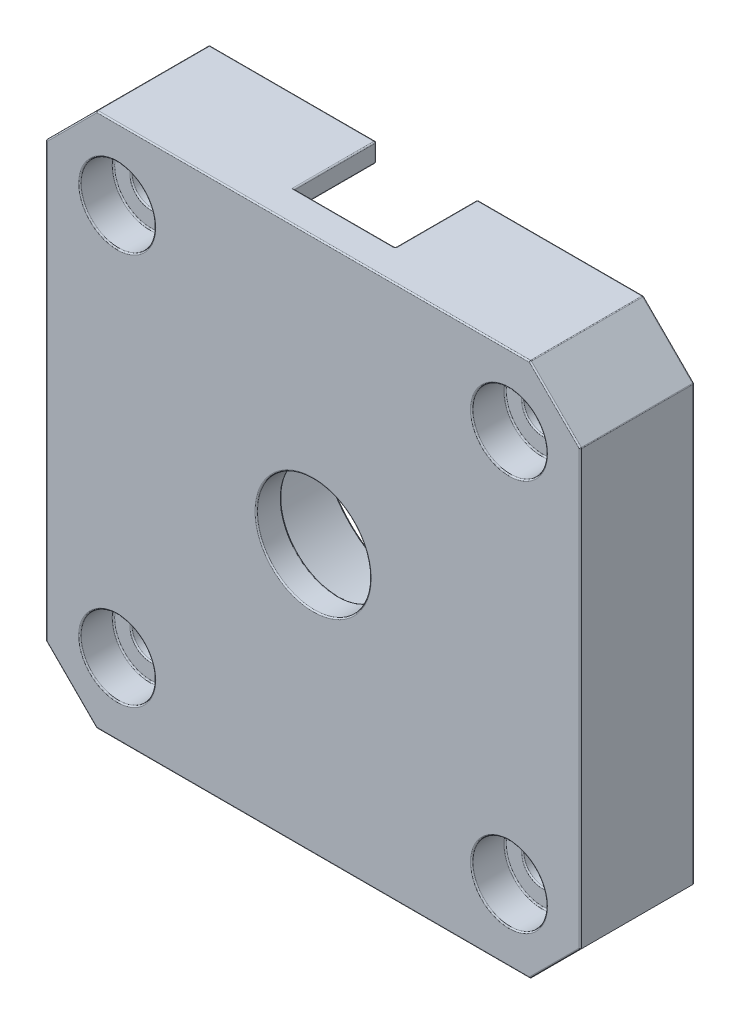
ISO-10303-21;
HEADER;
FILE_DESCRIPTION(('STEP AP214'),'2;1');
FILE_NAME('part.step','',(''),(''),'','','');
FILE_SCHEMA(('AUTOMOTIVE_DESIGN { 1 0 10303 214 1 1 1 1 }'));
ENDSEC;
DATA;
#1=APPLICATION_CONTEXT('core data for automotive mechanical design processes');
#2=APPLICATION_PROTOCOL_DEFINITION('international standard','automotive_design',2000,#1);
#3=PRODUCT_CONTEXT('',#1,'mechanical');
#4=PRODUCT('Part','Part','',(#3));
#5=PRODUCT_RELATED_PRODUCT_CATEGORY('part','',(#4));
#6=PRODUCT_DEFINITION_FORMATION('','',#4);
#7=PRODUCT_DEFINITION_CONTEXT('part definition',#1,'design');
#8=PRODUCT_DEFINITION('design','',#6,#7);
#9=PRODUCT_DEFINITION_SHAPE('','',#8);
#10=(LENGTH_UNIT() NAMED_UNIT(*) SI_UNIT(.MILLI.,.METRE.));
#11=(NAMED_UNIT(*) PLANE_ANGLE_UNIT() SI_UNIT($,.RADIAN.));
#12=(NAMED_UNIT(*) SI_UNIT($,.STERADIAN.) SOLID_ANGLE_UNIT());
#13=UNCERTAINTY_MEASURE_WITH_UNIT(LENGTH_MEASURE(1.E-05),#10,'distance_accuracy_value','');
#14=(GEOMETRIC_REPRESENTATION_CONTEXT(3) GLOBAL_UNCERTAINTY_ASSIGNED_CONTEXT((#13)) GLOBAL_UNIT_ASSIGNED_CONTEXT((#10,
#11,#12)) REPRESENTATION_CONTEXT('',''));
#15=CARTESIAN_POINT('',(0.,0.,0.));
#16=DIRECTION('',(0.,0.,1.));
#17=DIRECTION('',(1.,0.,0.));
#18=AXIS2_PLACEMENT_3D('',#15,#16,#17);
#19=CARTESIAN_POINT('',(36.65,36.65,7.675));
#20=DIRECTION('',(0.,0.,-1.));
#21=DIRECTION('',(-1.,0.,0.));
#22=AXIS2_PLACEMENT_3D('',#19,#20,#21);
#23=CYLINDRICAL_SURFACE('',#22,4.45);
#24=CARTESIAN_POINT('',(36.65,36.65,4.85));
#25=DIRECTION('',(0.,0.,-1.));
#26=DIRECTION('',(-1.,0.,0.));
#27=AXIS2_PLACEMENT_3D('',#24,#25,#26);
#28=CIRCLE('',#27,4.45);
#29=CARTESIAN_POINT('',(40.8,35.0437621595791,4.85));
#30=VERTEX_POINT('',#29);
#31=CARTESIAN_POINT('',(34.6219304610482,40.610989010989,4.85));
#32=VERTEX_POINT('',#31);
#33=EDGE_CURVE('E422',#30,#32,#28,.T.);
#34=ORIENTED_EDGE('',*,*,#33,.F.);
#35=DIRECTION('',(0.,0.,1.));
#36=VECTOR('',#35,1.);
#37=CARTESIAN_POINT('',(40.8,35.0437621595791,4.5));
#38=LINE('',#37,#36);
#39=CARTESIAN_POINT('',(40.8,35.0437621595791,7.5));
#40=VERTEX_POINT('',#39);
#41=EDGE_CURVE('E2259',#40,#30,#38,.F.);
#42=ORIENTED_EDGE('',*,*,#41,.F.);
#43=CARTESIAN_POINT('',(36.65,36.65,7.5));
#44=DIRECTION('',(0.,0.,-1.));
#45=DIRECTION('',(-1.,0.,0.));
#46=AXIS2_PLACEMENT_3D('',#43,#44,#45);
#47=CIRCLE('',#46,4.45);
#48=CARTESIAN_POINT('',(34.6219304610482,40.610989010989,7.5));
#49=VERTEX_POINT('',#48);
#50=EDGE_CURVE('E799',#40,#49,#47,.T.);
#51=ORIENTED_EDGE('',*,*,#50,.T.);
#52=DIRECTION('',(0.,0.,1.));
#53=VECTOR('',#52,1.);
#54=CARTESIAN_POINT('',(34.6219304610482,40.610989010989,7.675));
#55=LINE('',#54,#53);
#56=EDGE_CURVE('E410',#49,#32,#55,.F.);
#57=ORIENTED_EDGE('',*,*,#56,.T.);
#58=EDGE_LOOP('',(#34,#42,#51,#57));
#59=FACE_BOUND('',#58,.T.);
#60=ADVANCED_FACE('F17',(#59),#23,.T.);
#61=CARTESIAN_POINT('',(36.65,36.65,4.85));
#62=DIRECTION('',(0.,0.,-1.));
#63=DIRECTION('',(-1.,0.,0.));
#64=AXIS2_PLACEMENT_3D('',#61,#62,#63);
#65=PLANE('',#64);
#66=ORIENTED_EDGE('',*,*,#33,.T.);
#67=CARTESIAN_POINT('',(34.5763558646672,40.7,4.85));
#68=DIRECTION('',(0.,0.,1.));
#69=DIRECTION('',(1.,0.,0.));
#70=AXIS2_PLACEMENT_3D('',#67,#68,#69);
#71=CIRCLE('',#70,0.0999999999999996);
#72=CARTESIAN_POINT('',(34.6763558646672,40.7,4.85));
#73=VERTEX_POINT('',#72);
#74=EDGE_CURVE('E421',#32,#73,#71,.T.);
#75=ORIENTED_EDGE('',*,*,#74,.T.);
#76=DIRECTION('',(-1.,0.,0.));
#77=VECTOR('',#76,1.);
#78=CARTESIAN_POINT('',(36.65,40.7,4.85));
#79=LINE('',#78,#77);
#80=CARTESIAN_POINT('',(37.7786796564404,40.7,4.85));
#81=VERTEX_POINT('',#80);
#82=EDGE_CURVE('E402',#73,#81,#79,.F.);
#83=ORIENTED_EDGE('',*,*,#82,.T.);
#84=DIRECTION('',(-0.707106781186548,0.707106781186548,0.));
#85=VECTOR('',#84,1.);
#86=CARTESIAN_POINT('',(39.2393398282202,39.2393398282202,4.85));
#87=LINE('',#86,#85);
#88=CARTESIAN_POINT('',(40.8,37.6786796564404,4.85));
#89=VERTEX_POINT('',#88);
#90=EDGE_CURVE('E418',#81,#89,#87,.F.);
#91=ORIENTED_EDGE('',*,*,#90,.T.);
#92=DIRECTION('',(0.,1.,0.));
#93=VECTOR('',#92,1.);
#94=CARTESIAN_POINT('',(40.8,21.15,4.85));
#95=LINE('',#94,#93);
#96=EDGE_CURVE('E719',#30,#89,#95,.T.);
#97=ORIENTED_EDGE('',*,*,#96,.F.);
#98=EDGE_LOOP('',(#66,#75,#83,#91,#97));
#99=FACE_BOUND('',#98,.T.);
#100=CARTESIAN_POINT('',(36.65,36.65,4.85));
#101=DIRECTION('',(0.,0.,-1.));
#102=DIRECTION('',(-1.,0.,0.));
#103=AXIS2_PLACEMENT_3D('',#100,#101,#102);
#104=CIRCLE('',#103,3.05);
#105=CARTESIAN_POINT('',(33.6,36.65,4.85));
#106=VERTEX_POINT('',#105);
#107=EDGE_CURVE('E431',#106,#106,#104,.F.);
#108=ORIENTED_EDGE('',*,*,#107,.T.);
#109=EDGE_LOOP('',(#108));
#110=FACE_BOUND('',#109,.T.);
#111=ADVANCED_FACE('F415',(#99,#110),#65,.T.);
#112=CARTESIAN_POINT('',(36.65,5.65,7.675));
#113=DIRECTION('',(0.,0.,-1.));
#114=DIRECTION('',(-1.,0.,0.));
#115=AXIS2_PLACEMENT_3D('',#112,#113,#114);
#116=CYLINDRICAL_SURFACE('',#115,4.45);
#117=CARTESIAN_POINT('',(36.65,5.65,4.85));
#118=DIRECTION('',(0.,0.,-1.));
#119=DIRECTION('',(-1.,0.,0.));
#120=AXIS2_PLACEMENT_3D('',#117,#118,#119);
#121=CIRCLE('',#120,4.45);
#122=CARTESIAN_POINT('',(35.0437621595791,1.5,4.85));
#123=VERTEX_POINT('',#122);
#124=CARTESIAN_POINT('',(40.8,7.25623784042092,4.85));
#125=VERTEX_POINT('',#124);
#126=EDGE_CURVE('E809',#123,#125,#121,.T.);
#127=ORIENTED_EDGE('',*,*,#126,.F.);
#128=DIRECTION('',(0.,0.,1.));
#129=VECTOR('',#128,1.);
#130=CARTESIAN_POINT('',(35.0437621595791,1.5,4.5));
#131=LINE('',#130,#129);
#132=CARTESIAN_POINT('',(35.0437621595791,1.5,7.5));
#133=VERTEX_POINT('',#132);
#134=EDGE_CURVE('E2244',#133,#123,#131,.F.);
#135=ORIENTED_EDGE('',*,*,#134,.F.);
#136=CARTESIAN_POINT('',(36.65,5.65,7.5));
#137=DIRECTION('',(0.,0.,-1.));
#138=DIRECTION('',(-1.,0.,0.));
#139=AXIS2_PLACEMENT_3D('',#136,#137,#138);
#140=CIRCLE('',#139,4.45);
#141=CARTESIAN_POINT('',(40.8,7.25623784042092,7.5));
#142=VERTEX_POINT('',#141);
#143=EDGE_CURVE('E801',#133,#142,#140,.T.);
#144=ORIENTED_EDGE('',*,*,#143,.T.);
#145=DIRECTION('',(0.,0.,1.));
#146=VECTOR('',#145,1.);
#147=CARTESIAN_POINT('',(40.8,7.25623784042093,4.5));
#148=LINE('',#147,#146);
#149=EDGE_CURVE('E2255',#125,#142,#148,.T.);
#150=ORIENTED_EDGE('',*,*,#149,.F.);
#151=EDGE_LOOP('',(#127,#135,#144,#150));
#152=FACE_BOUND('',#151,.T.);
#153=ADVANCED_FACE('F2354',(#152),#116,.T.);
#154=CARTESIAN_POINT('',(36.65,5.65,4.85));
#155=DIRECTION('',(0.,0.,-1.));
#156=DIRECTION('',(-1.,0.,0.));
#157=AXIS2_PLACEMENT_3D('',#154,#155,#156);
#158=PLANE('',#157);
#159=DIRECTION('',(0.,1.,0.));
#160=VECTOR('',#159,1.);
#161=CARTESIAN_POINT('',(40.8,21.15,4.85));
#162=LINE('',#161,#160);
#163=CARTESIAN_POINT('',(40.8,4.62132034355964,4.85));
#164=VERTEX_POINT('',#163);
#165=EDGE_CURVE('E433',#164,#125,#162,.T.);
#166=ORIENTED_EDGE('',*,*,#165,.F.);
#167=DIRECTION('',(0.707106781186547,0.707106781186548,0.));
#168=VECTOR('',#167,1.);
#169=CARTESIAN_POINT('',(39.2393398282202,3.06066017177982,4.85));
#170=LINE('',#169,#168);
#171=CARTESIAN_POINT('',(37.6786796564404,1.5,4.85));
#172=VERTEX_POINT('',#171);
#173=EDGE_CURVE('E2223',#164,#172,#170,.F.);
#174=ORIENTED_EDGE('',*,*,#173,.T.);
#175=DIRECTION('',(1.,0.,0.));
#176=VECTOR('',#175,1.);
#177=CARTESIAN_POINT('',(21.15,1.5,4.85));
#178=LINE('',#177,#176);
#179=EDGE_CURVE('E2219',#123,#172,#178,.T.);
#180=ORIENTED_EDGE('',*,*,#179,.F.);
#181=ORIENTED_EDGE('',*,*,#126,.T.);
#182=EDGE_LOOP('',(#166,#174,#180,#181));
#183=FACE_BOUND('',#182,.T.);
#184=CARTESIAN_POINT('',(36.65,5.65,4.85));
#185=DIRECTION('',(0.,0.,-1.));
#186=DIRECTION('',(-1.,0.,0.));
#187=AXIS2_PLACEMENT_3D('',#184,#185,#186);
#188=CIRCLE('',#187,3.05);
#189=CARTESIAN_POINT('',(33.6,5.65,4.85));
#190=VERTEX_POINT('',#189);
#191=EDGE_CURVE('E768',#190,#190,#188,.F.);
#192=ORIENTED_EDGE('',*,*,#191,.T.);
#193=EDGE_LOOP('',(#192));
#194=FACE_BOUND('',#193,.T.);
#195=ADVANCED_FACE('F2351',(#183,#194),#158,.T.);
#196=CARTESIAN_POINT('',(5.65,36.65,7.675));
#197=DIRECTION('',(0.,0.,-1.));
#198=DIRECTION('',(-1.,0.,0.));
#199=AXIS2_PLACEMENT_3D('',#196,#197,#198);
#200=CYLINDRICAL_SURFACE('',#199,4.45);
#201=DIRECTION('',(0.,0.,-1.));
#202=VECTOR('',#201,1.);
#203=CARTESIAN_POINT('',(1.5,35.0437621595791,4.5));
#204=LINE('',#203,#202);
#205=CARTESIAN_POINT('',(1.5,35.0437621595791,4.85));
#206=VERTEX_POINT('',#205);
#207=CARTESIAN_POINT('',(1.5,35.0437621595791,7.5));
#208=VERTEX_POINT('',#207);
#209=EDGE_CURVE('E2307',#206,#208,#204,.F.);
#210=ORIENTED_EDGE('',*,*,#209,.F.);
#211=CARTESIAN_POINT('',(5.65,36.65,4.85));
#212=DIRECTION('',(0.,0.,-1.));
#213=DIRECTION('',(-1.,0.,0.));
#214=AXIS2_PLACEMENT_3D('',#211,#212,#213);
#215=CIRCLE('',#214,4.45);
#216=CARTESIAN_POINT('',(7.67806953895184,40.610989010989,4.85));
#217=VERTEX_POINT('',#216);
#218=EDGE_CURVE('E786',#217,#206,#215,.T.);
#219=ORIENTED_EDGE('',*,*,#218,.F.);
#220=DIRECTION('',(0.,0.,-1.));
#221=VECTOR('',#220,1.);
#222=CARTESIAN_POINT('',(7.67806953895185,40.610989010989,7.675));
#223=LINE('',#222,#221);
#224=CARTESIAN_POINT('',(7.67806953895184,40.610989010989,7.5));
#225=VERTEX_POINT('',#224);
#226=EDGE_CURVE('E813',#217,#225,#223,.F.);
#227=ORIENTED_EDGE('',*,*,#226,.T.);
#228=CARTESIAN_POINT('',(5.65,36.65,7.5));
#229=DIRECTION('',(0.,0.,-1.));
#230=DIRECTION('',(-1.,0.,0.));
#231=AXIS2_PLACEMENT_3D('',#228,#229,#230);
#232=CIRCLE('',#231,4.45);
#233=EDGE_CURVE('E803',#225,#208,#232,.T.);
#234=ORIENTED_EDGE('',*,*,#233,.T.);
#235=EDGE_LOOP('',(#210,#219,#227,#234));
#236=FACE_BOUND('',#235,.T.);
#237=ADVANCED_FACE('F2329',(#236),#200,.T.);
#238=CARTESIAN_POINT('',(21.15,21.15,7.5));
#239=DIRECTION('',(0.,0.,1.));
#240=DIRECTION('',(1.,0.,0.));
#241=AXIS2_PLACEMENT_3D('',#238,#239,#240);
#242=PLANE('',#241);
#243=ORIENTED_EDGE('',*,*,#50,.F.);
#244=DIRECTION('',(0.,1.,0.));
#245=VECTOR('',#244,1.);
#246=CARTESIAN_POINT('',(40.8,21.15,7.5));
#247=LINE('',#246,#245);
#248=EDGE_CURVE('E2263',#142,#40,#247,.T.);
#249=ORIENTED_EDGE('',*,*,#248,.F.);
#250=ORIENTED_EDGE('',*,*,#143,.F.);
#251=DIRECTION('',(1.,0.,0.));
#252=VECTOR('',#251,1.);
#253=CARTESIAN_POINT('',(21.15,1.5,7.5));
#254=LINE('',#253,#252);
#255=CARTESIAN_POINT('',(7.2562378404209,1.5,7.5));
#256=VERTEX_POINT('',#255);
#257=EDGE_CURVE('E2249',#256,#133,#254,.T.);
#258=ORIENTED_EDGE('',*,*,#257,.F.);
#259=CARTESIAN_POINT('',(5.65,5.65,7.5));
#260=DIRECTION('',(0.,0.,-1.));
#261=DIRECTION('',(-1.,0.,0.));
#262=AXIS2_PLACEMENT_3D('',#259,#260,#261);
#263=CIRCLE('',#262,4.45);
#264=CARTESIAN_POINT('',(1.5,7.25623784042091,7.5));
#265=VERTEX_POINT('',#264);
#266=EDGE_CURVE('E794',#265,#256,#263,.T.);
#267=ORIENTED_EDGE('',*,*,#266,.F.);
#268=DIRECTION('',(0.,1.,0.));
#269=VECTOR('',#268,1.);
#270=CARTESIAN_POINT('',(1.5,21.15,7.5));
#271=LINE('',#270,#269);
#272=EDGE_CURVE('E2320',#208,#265,#271,.F.);
#273=ORIENTED_EDGE('',*,*,#272,.F.);
#274=ORIENTED_EDGE('',*,*,#233,.F.);
#275=CARTESIAN_POINT('',(7.72364413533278,40.7,7.5));
#276=DIRECTION('',(0.,0.,-1.));
#277=DIRECTION('',(-1.,0.,0.));
#278=AXIS2_PLACEMENT_3D('',#275,#276,#277);
#279=CIRCLE('',#278,0.0999999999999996);
#280=CARTESIAN_POINT('',(7.62364413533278,40.7,7.5));
#281=VERTEX_POINT('',#280);
#282=EDGE_CURVE('E805',#281,#225,#279,.F.);
#283=ORIENTED_EDGE('',*,*,#282,.F.);
#284=DIRECTION('',(1.,0.,0.));
#285=VECTOR('',#284,1.);
#286=CARTESIAN_POINT('',(21.15,40.7,7.5));
#287=LINE('',#286,#285);
#288=CARTESIAN_POINT('',(34.6763558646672,40.7,7.5));
#289=VERTEX_POINT('',#288);
#290=EDGE_CURVE('E808',#289,#281,#287,.F.);
#291=ORIENTED_EDGE('',*,*,#290,.F.);
#292=CARTESIAN_POINT('',(34.5763558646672,40.7,7.5));
#293=DIRECTION('',(0.,0.,1.));
#294=DIRECTION('',(1.,0.,0.));
#295=AXIS2_PLACEMENT_3D('',#292,#293,#294);
#296=CIRCLE('',#295,0.0999999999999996);
#297=EDGE_CURVE('E796',#49,#289,#296,.T.);
#298=ORIENTED_EDGE('',*,*,#297,.F.);
#299=EDGE_LOOP('',(#243,#249,#250,#258,#267,#273,#274,#283,#291,#298));
#300=FACE_BOUND('',#299,.T.);
#301=CARTESIAN_POINT('',(21.15,21.15,7.5));
#302=DIRECTION('',(0.,0.,1.));
#303=DIRECTION('',(1.,0.,0.));
#304=AXIS2_PLACEMENT_3D('',#301,#302,#303);
#305=CIRCLE('',#304,10.);
#306=CARTESIAN_POINT('',(31.15,21.15,7.5));
#307=VERTEX_POINT('',#306);
#308=EDGE_CURVE('E771',#307,#307,#305,.F.);
#309=ORIENTED_EDGE('',*,*,#308,.F.);
#310=EDGE_LOOP('',(#309));
#311=FACE_BOUND('',#310,.T.);
#312=ADVANCED_FACE('F2280',(#300,#311),#242,.F.);
#313=CARTESIAN_POINT('',(5.65,5.65,7.675));
#314=DIRECTION('',(0.,0.,-1.));
#315=DIRECTION('',(-1.,0.,0.));
#316=AXIS2_PLACEMENT_3D('',#313,#314,#315);
#317=CYLINDRICAL_SURFACE('',#316,4.45);
#318=CARTESIAN_POINT('',(5.65,5.65,4.85));
#319=DIRECTION('',(0.,0.,-1.));
#320=DIRECTION('',(-1.,0.,0.));
#321=AXIS2_PLACEMENT_3D('',#318,#319,#320);
#322=CIRCLE('',#321,4.45);
#323=CARTESIAN_POINT('',(1.5,7.25623784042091,4.85));
#324=VERTEX_POINT('',#323);
#325=CARTESIAN_POINT('',(7.2562378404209,1.5,4.85));
#326=VERTEX_POINT('',#325);
#327=EDGE_CURVE('E792',#324,#326,#322,.T.);
#328=ORIENTED_EDGE('',*,*,#327,.F.);
#329=DIRECTION('',(0.,0.,-1.));
#330=VECTOR('',#329,1.);
#331=CARTESIAN_POINT('',(1.5,7.25623784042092,4.5));
#332=LINE('',#331,#330);
#333=EDGE_CURVE('E2315',#265,#324,#332,.T.);
#334=ORIENTED_EDGE('',*,*,#333,.F.);
#335=ORIENTED_EDGE('',*,*,#266,.T.);
#336=DIRECTION('',(0.,0.,1.));
#337=VECTOR('',#336,1.);
#338=CARTESIAN_POINT('',(7.25623784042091,1.5,4.5));
#339=LINE('',#338,#337);
#340=EDGE_CURVE('E2235',#326,#256,#339,.T.);
#341=ORIENTED_EDGE('',*,*,#340,.F.);
#342=EDGE_LOOP('',(#328,#334,#335,#341));
#343=FACE_BOUND('',#342,.T.);
#344=ADVANCED_FACE('F2333',(#343),#317,.T.);
#345=CARTESIAN_POINT('',(5.65,5.65,4.85));
#346=DIRECTION('',(0.,0.,-1.));
#347=DIRECTION('',(-1.,0.,0.));
#348=AXIS2_PLACEMENT_3D('',#345,#346,#347);
#349=PLANE('',#348);
#350=DIRECTION('',(0.,1.,0.));
#351=VECTOR('',#350,1.);
#352=CARTESIAN_POINT('',(1.5,21.15,4.85));
#353=LINE('',#352,#351);
#354=CARTESIAN_POINT('',(1.5,4.62132034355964,4.85));
#355=VERTEX_POINT('',#354);
#356=EDGE_CURVE('E2207',#324,#355,#353,.F.);
#357=ORIENTED_EDGE('',*,*,#356,.F.);
#358=ORIENTED_EDGE('',*,*,#327,.T.);
#359=DIRECTION('',(1.,0.,0.));
#360=VECTOR('',#359,1.);
#361=CARTESIAN_POINT('',(21.15,1.5,4.85));
#362=LINE('',#361,#360);
#363=CARTESIAN_POINT('',(4.62132034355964,1.5,4.85));
#364=VERTEX_POINT('',#363);
#365=EDGE_CURVE('E2229',#364,#326,#362,.T.);
#366=ORIENTED_EDGE('',*,*,#365,.F.);
#367=DIRECTION('',(0.707106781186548,-0.707106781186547,0.));
#368=VECTOR('',#367,1.);
#369=CARTESIAN_POINT('',(3.06066017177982,3.06066017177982,4.85));
#370=LINE('',#369,#368);
#371=EDGE_CURVE('E2213',#364,#355,#370,.F.);
#372=ORIENTED_EDGE('',*,*,#371,.T.);
#373=EDGE_LOOP('',(#357,#358,#366,#372));
#374=FACE_BOUND('',#373,.T.);
#375=CARTESIAN_POINT('',(5.65,5.65,4.85));
#376=DIRECTION('',(0.,0.,-1.));
#377=DIRECTION('',(-1.,0.,0.));
#378=AXIS2_PLACEMENT_3D('',#375,#376,#377);
#379=CIRCLE('',#378,3.05);
#380=CARTESIAN_POINT('',(2.6,5.65,4.85));
#381=VERTEX_POINT('',#380);
#382=EDGE_CURVE('E765',#381,#381,#379,.F.);
#383=ORIENTED_EDGE('',*,*,#382,.T.);
#384=EDGE_LOOP('',(#383));
#385=FACE_BOUND('',#384,.T.);
#386=ADVANCED_FACE('F2338',(#374,#385),#349,.T.);
#387=CARTESIAN_POINT('',(5.65,36.65,4.85));
#388=DIRECTION('',(0.,0.,-1.));
#389=DIRECTION('',(-1.,0.,0.));
#390=AXIS2_PLACEMENT_3D('',#387,#388,#389);
#391=PLANE('',#390);
#392=DIRECTION('',(0.,1.,0.));
#393=VECTOR('',#392,1.);
#394=CARTESIAN_POINT('',(1.5,21.15,4.85));
#395=LINE('',#394,#393);
#396=CARTESIAN_POINT('',(1.50000000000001,37.6786796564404,4.85));
#397=VERTEX_POINT('',#396);
#398=EDGE_CURVE('E2304',#397,#206,#395,.F.);
#399=ORIENTED_EDGE('',*,*,#398,.F.);
#400=DIRECTION('',(-0.707106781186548,-0.707106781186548,0.));
#401=VECTOR('',#400,1.);
#402=CARTESIAN_POINT('',(3.06066017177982,39.2393398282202,4.85));
#403=LINE('',#402,#401);
#404=CARTESIAN_POINT('',(4.52132034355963,40.7,4.85));
#405=VERTEX_POINT('',#404);
#406=EDGE_CURVE('E2192',#397,#405,#403,.F.);
#407=ORIENTED_EDGE('',*,*,#406,.T.);
#408=DIRECTION('',(-1.,0.,0.));
#409=VECTOR('',#408,1.);
#410=CARTESIAN_POINT('',(5.65,40.7,4.85));
#411=LINE('',#410,#409);
#412=CARTESIAN_POINT('',(7.62364413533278,40.7,4.85));
#413=VERTEX_POINT('',#412);
#414=EDGE_CURVE('E791',#405,#413,#411,.F.);
#415=ORIENTED_EDGE('',*,*,#414,.T.);
#416=CARTESIAN_POINT('',(7.72364413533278,40.7,4.85));
#417=DIRECTION('',(0.,0.,-1.));
#418=DIRECTION('',(-1.,0.,0.));
#419=AXIS2_PLACEMENT_3D('',#416,#417,#418);
#420=CIRCLE('',#419,0.0999999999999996);
#421=EDGE_CURVE('E788',#413,#217,#420,.F.);
#422=ORIENTED_EDGE('',*,*,#421,.T.);
#423=ORIENTED_EDGE('',*,*,#218,.T.);
#424=EDGE_LOOP('',(#399,#407,#415,#422,#423));
#425=FACE_BOUND('',#424,.T.);
#426=CARTESIAN_POINT('',(5.65,36.65,4.85));
#427=DIRECTION('',(0.,0.,-1.));
#428=DIRECTION('',(-1.,0.,0.));
#429=AXIS2_PLACEMENT_3D('',#426,#427,#428);
#430=CIRCLE('',#429,3.05);
#431=CARTESIAN_POINT('',(2.6,36.65,4.85));
#432=VERTEX_POINT('',#431);
#433=EDGE_CURVE('E436',#432,#432,#430,.F.);
#434=ORIENTED_EDGE('',*,*,#433,.T.);
#435=EDGE_LOOP('',(#434));
#436=FACE_BOUND('',#435,.T.);
#437=ADVANCED_FACE('F2371',(#425,#436),#391,.T.);
#438=CARTESIAN_POINT('',(37.6372583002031,40.7,4.5));
#439=DIRECTION('',(0.,0.,1.));
#440=DIRECTION('',(1.,0.,0.));
#441=AXIS2_PLACEMENT_3D('',#438,#439,#440);
#442=CYLINDRICAL_SURFACE('',#441,0.100000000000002);
#443=CARTESIAN_POINT('',(37.6372583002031,40.7,0.1));
#444=DIRECTION('',(0.,0.,1.));
#445=DIRECTION('',(1.,0.,0.));
#446=AXIS2_PLACEMENT_3D('',#443,#444,#445);
#447=CIRCLE('',#446,0.100000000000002);
#448=CARTESIAN_POINT('',(37.7079689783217,40.7707106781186,0.0999999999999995));
#449=VERTEX_POINT('',#448);
#450=CARTESIAN_POINT('',(37.6372583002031,40.8,0.1));
#451=VERTEX_POINT('',#450);
#452=EDGE_CURVE('E785',#449,#451,#447,.T.);
#453=ORIENTED_EDGE('',*,*,#452,.F.);
#454=DIRECTION('',(0.,0.,1.));
#455=VECTOR('',#454,1.);
#456=CARTESIAN_POINT('',(37.7079689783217,40.7707106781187,4.5));
#457=LINE('',#456,#455);
#458=CARTESIAN_POINT('',(37.7079689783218,40.7707106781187,4.82071067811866));
#459=VERTEX_POINT('',#458);
#460=EDGE_CURVE('E430',#449,#459,#457,.T.);
#461=ORIENTED_EDGE('',*,*,#460,.T.);
#462=CARTESIAN_POINT('',(37.6372583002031,40.7,4.75));
#463=DIRECTION('',(-0.707106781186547,0.,0.707106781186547));
#464=DIRECTION('',(-0.707106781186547,0.,-0.707106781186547));
#465=AXIS2_PLACEMENT_3D('',#462,#463,#464);
#466=ELLIPSE('',#465,0.14142135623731,0.100000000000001);
#467=CARTESIAN_POINT('',(37.6372583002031,40.8,4.75));
#468=VERTEX_POINT('',#467);
#469=EDGE_CURVE('E405',#459,#468,#466,.T.);
#470=ORIENTED_EDGE('',*,*,#469,.T.);
#471=DIRECTION('',(0.,0.,-1.));
#472=VECTOR('',#471,1.);
#473=CARTESIAN_POINT('',(37.6372583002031,40.8,4.5));
#474=LINE('',#473,#472);
#475=EDGE_CURVE('E2150',#451,#468,#474,.F.);
#476=ORIENTED_EDGE('',*,*,#475,.F.);
#477=EDGE_LOOP('',(#453,#461,#470,#476));
#478=FACE_BOUND('',#477,.T.);
#479=ADVANCED_FACE('F2152',(#478),#442,.F.);
#480=CARTESIAN_POINT('',(28.9,40.7,4.75));
#481=DIRECTION('',(-1.,0.,0.));
#482=DIRECTION('',(0.,0.,1.));
#483=AXIS2_PLACEMENT_3D('',#480,#481,#482);
#484=CYLINDRICAL_SURFACE('',#483,0.0999999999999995);
#485=ORIENTED_EDGE('',*,*,#469,.F.);
#486=CARTESIAN_POINT('',(37.7786796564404,40.7,4.75));
#487=DIRECTION('',(0.707106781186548,0.707106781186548,0.));
#488=DIRECTION('',(-0.707106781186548,0.707106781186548,0.));
#489=AXIS2_PLACEMENT_3D('',#486,#487,#488);
#490=ELLIPSE('',#489,0.141421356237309,0.0999999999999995);
#491=EDGE_CURVE('E399',#81,#459,#490,.F.);
#492=ORIENTED_EDGE('',*,*,#491,.F.);
#493=ORIENTED_EDGE('',*,*,#82,.F.);
#494=CARTESIAN_POINT('',(34.5763558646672,40.7,4.75));
#495=DIRECTION('',(-0.707106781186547,0.,0.707106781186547));
#496=DIRECTION('',(-0.707106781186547,0.,-0.707106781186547));
#497=AXIS2_PLACEMENT_3D('',#494,#495,#496);
#498=ELLIPSE('',#497,0.141421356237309,0.0999999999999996);
#499=CARTESIAN_POINT('',(34.5763558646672,40.8,4.75));
#500=VERTEX_POINT('',#499);
#501=EDGE_CURVE('E782',#73,#500,#498,.T.);
#502=ORIENTED_EDGE('',*,*,#501,.T.);
#503=DIRECTION('',(1.,0.,0.));
#504=VECTOR('',#503,1.);
#505=CARTESIAN_POINT('',(21.15,40.8,4.75));
#506=LINE('',#505,#504);
#507=EDGE_CURVE('E2155',#468,#500,#506,.F.);
#508=ORIENTED_EDGE('',*,*,#507,.F.);
#509=EDGE_LOOP('',(#485,#492,#493,#502,#508));
#510=FACE_BOUND('',#509,.T.);
#511=ADVANCED_FACE('F401',(#510),#484,.F.);
#512=CARTESIAN_POINT('',(34.5763558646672,40.7,7.675));
#513=DIRECTION('',(0.,0.,1.));
#514=DIRECTION('',(1.,0.,0.));
#515=AXIS2_PLACEMENT_3D('',#512,#513,#514);
#516=CYLINDRICAL_SURFACE('',#515,0.0999999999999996);
#517=ORIENTED_EDGE('',*,*,#501,.F.);
#518=ORIENTED_EDGE('',*,*,#74,.F.);
#519=ORIENTED_EDGE('',*,*,#56,.F.);
#520=ORIENTED_EDGE('',*,*,#297,.T.);
#521=CARTESIAN_POINT('',(34.5763558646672,40.7,7.4));
#522=DIRECTION('',(-0.707106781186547,0.,0.707106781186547));
#523=DIRECTION('',(-0.707106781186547,0.,-0.707106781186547));
#524=AXIS2_PLACEMENT_3D('',#521,#522,#523);
#525=ELLIPSE('',#524,0.141421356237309,0.0999999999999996);
#526=CARTESIAN_POINT('',(34.5763558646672,40.8,7.4));
#527=VERTEX_POINT('',#526);
#528=EDGE_CURVE('E780',#289,#527,#525,.T.);
#529=ORIENTED_EDGE('',*,*,#528,.T.);
#530=DIRECTION('',(0.,0.,-1.));
#531=VECTOR('',#530,1.);
#532=CARTESIAN_POINT('',(34.5763558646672,40.8,4.5));
#533=LINE('',#532,#531);
#534=EDGE_CURVE('E2289',#500,#527,#533,.F.);
#535=ORIENTED_EDGE('',*,*,#534,.F.);
#536=EDGE_LOOP('',(#517,#518,#519,#520,#529,#535));
#537=FACE_BOUND('',#536,.T.);
#538=ADVANCED_FACE('F2275',(#537),#516,.F.);
#539=CARTESIAN_POINT('',(21.15,40.7,7.4));
#540=DIRECTION('',(-1.,0.,0.));
#541=DIRECTION('',(0.,0.,1.));
#542=AXIS2_PLACEMENT_3D('',#539,#540,#541);
#543=CYLINDRICAL_SURFACE('',#542,0.0999999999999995);
#544=ORIENTED_EDGE('',*,*,#528,.F.);
#545=ORIENTED_EDGE('',*,*,#290,.T.);
#546=CARTESIAN_POINT('',(7.72364413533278,40.7,7.4));
#547=DIRECTION('',(-0.707106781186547,0.,-0.707106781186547));
#548=DIRECTION('',(0.707106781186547,0.,-0.707106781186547));
#549=AXIS2_PLACEMENT_3D('',#546,#547,#548);
#550=ELLIPSE('',#549,0.141421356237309,0.0999999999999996);
#551=CARTESIAN_POINT('',(7.72364413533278,40.8,7.4));
#552=VERTEX_POINT('',#551);
#553=EDGE_CURVE('E778',#281,#552,#550,.T.);
#554=ORIENTED_EDGE('',*,*,#553,.T.);
#555=DIRECTION('',(1.,0.,0.));
#556=VECTOR('',#555,1.);
#557=CARTESIAN_POINT('',(21.15,40.8,7.4));
#558=LINE('',#557,#556);
#559=EDGE_CURVE('E2292',#527,#552,#558,.F.);
#560=ORIENTED_EDGE('',*,*,#559,.F.);
#561=EDGE_LOOP('',(#544,#545,#554,#560));
#562=FACE_BOUND('',#561,.T.);
#563=ADVANCED_FACE('F2293',(#562),#543,.F.);
#564=CARTESIAN_POINT('',(7.72364413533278,40.7,7.675));
#565=DIRECTION('',(0.,0.,-1.));
#566=DIRECTION('',(-1.,0.,0.));
#567=AXIS2_PLACEMENT_3D('',#564,#565,#566);
#568=CYLINDRICAL_SURFACE('',#567,0.0999999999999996);
#569=ORIENTED_EDGE('',*,*,#553,.F.);
#570=ORIENTED_EDGE('',*,*,#282,.T.);
#571=ORIENTED_EDGE('',*,*,#226,.F.);
#572=ORIENTED_EDGE('',*,*,#421,.F.);
#573=CARTESIAN_POINT('',(7.72364413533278,40.7,4.75));
#574=DIRECTION('',(-0.707106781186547,0.,-0.707106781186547));
#575=DIRECTION('',(0.707106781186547,0.,-0.707106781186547));
#576=AXIS2_PLACEMENT_3D('',#573,#574,#575);
#577=ELLIPSE('',#576,0.141421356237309,0.0999999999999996);
#578=CARTESIAN_POINT('',(7.72364413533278,40.8,4.75));
#579=VERTEX_POINT('',#578);
#580=EDGE_CURVE('E776',#413,#579,#577,.T.);
#581=ORIENTED_EDGE('',*,*,#580,.T.);
#582=DIRECTION('',(0.,0.,-1.));
#583=VECTOR('',#582,1.);
#584=CARTESIAN_POINT('',(7.72364413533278,40.8,4.5));
#585=LINE('',#584,#583);
#586=EDGE_CURVE('E2184',#552,#579,#585,.T.);
#587=ORIENTED_EDGE('',*,*,#586,.F.);
#588=EDGE_LOOP('',(#569,#570,#571,#572,#581,#587));
#589=FACE_BOUND('',#588,.T.);
#590=ADVANCED_FACE('F2383',(#589),#568,.F.);
#591=CARTESIAN_POINT('',(13.4,40.7,4.75));
#592=DIRECTION('',(-1.,0.,0.));
#593=DIRECTION('',(0.,0.,1.));
#594=AXIS2_PLACEMENT_3D('',#591,#592,#593);
#595=CYLINDRICAL_SURFACE('',#594,0.0999999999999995);
#596=ORIENTED_EDGE('',*,*,#580,.F.);
#597=ORIENTED_EDGE('',*,*,#414,.F.);
#598=CARTESIAN_POINT('',(4.52132034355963,40.7,4.75));
#599=DIRECTION('',(-0.707106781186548,0.707106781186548,0.));
#600=DIRECTION('',(-0.707106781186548,-0.707106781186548,0.));
#601=AXIS2_PLACEMENT_3D('',#598,#599,#600);
#602=ELLIPSE('',#601,0.141421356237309,0.0999999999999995);
#603=CARTESIAN_POINT('',(4.59203102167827,40.7707106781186,4.82071067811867));
#604=VERTEX_POINT('',#603);
#605=EDGE_CURVE('E423',#604,#405,#602,.F.);
#606=ORIENTED_EDGE('',*,*,#605,.F.);
#607=CARTESIAN_POINT('',(4.66274169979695,40.7,4.75));
#608=DIRECTION('',(-0.707106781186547,0.,-0.707106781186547));
#609=DIRECTION('',(0.707106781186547,0.,-0.707106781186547));
#610=AXIS2_PLACEMENT_3D('',#607,#608,#609);
#611=ELLIPSE('',#610,0.141421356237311,0.100000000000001);
#612=CARTESIAN_POINT('',(4.66274169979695,40.8,4.75));
#613=VERTEX_POINT('',#612);
#614=EDGE_CURVE('E774',#604,#613,#611,.T.);
#615=ORIENTED_EDGE('',*,*,#614,.T.);
#616=DIRECTION('',(1.,0.,0.));
#617=VECTOR('',#616,1.);
#618=CARTESIAN_POINT('',(21.15,40.8,4.75));
#619=LINE('',#618,#617);
#620=EDGE_CURVE('E2181',#579,#613,#619,.F.);
#621=ORIENTED_EDGE('',*,*,#620,.F.);
#622=EDGE_LOOP('',(#596,#597,#606,#615,#621));
#623=FACE_BOUND('',#622,.T.);
#624=ADVANCED_FACE('F2386',(#623),#595,.F.);
#625=CARTESIAN_POINT('',(4.66274169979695,40.7,4.5));
#626=DIRECTION('',(0.,0.,-1.));
#627=DIRECTION('',(-1.,0.,0.));
#628=AXIS2_PLACEMENT_3D('',#625,#626,#627);
#629=CYLINDRICAL_SURFACE('',#628,0.100000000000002);
#630=ORIENTED_EDGE('',*,*,#614,.F.);
#631=DIRECTION('',(0.,0.,1.));
#632=VECTOR('',#631,1.);
#633=CARTESIAN_POINT('',(4.59203102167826,40.7707106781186,4.5));
#634=LINE('',#633,#632);
#635=CARTESIAN_POINT('',(4.59203102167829,40.7707106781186,0.0999999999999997));
#636=VERTEX_POINT('',#635);
#637=EDGE_CURVE('E2156',#604,#636,#634,.F.);
#638=ORIENTED_EDGE('',*,*,#637,.T.);
#639=CARTESIAN_POINT('',(4.66274169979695,40.7,0.1));
#640=DIRECTION('',(0.,0.,-1.));
#641=DIRECTION('',(-1.,0.,0.));
#642=AXIS2_PLACEMENT_3D('',#639,#640,#641);
#643=CIRCLE('',#642,0.100000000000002);
#644=CARTESIAN_POINT('',(4.66274169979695,40.8,0.1));
#645=VERTEX_POINT('',#644);
#646=EDGE_CURVE('E461',#645,#636,#643,.F.);
#647=ORIENTED_EDGE('',*,*,#646,.F.);
#648=DIRECTION('',(0.,0.,-1.));
#649=VECTOR('',#648,1.);
#650=CARTESIAN_POINT('',(4.66274169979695,40.8,4.5));
#651=LINE('',#650,#649);
#652=EDGE_CURVE('E761',#613,#645,#651,.T.);
#653=ORIENTED_EDGE('',*,*,#652,.F.);
#654=EDGE_LOOP('',(#630,#638,#647,#653));
#655=FACE_BOUND('',#654,.T.);
#656=ADVANCED_FACE('F2390',(#655),#629,.F.);
#657=CARTESIAN_POINT('',(21.15,21.15,3.5));
#658=DIRECTION('',(0.,0.,1.));
#659=DIRECTION('',(1.,0.,0.));
#660=AXIS2_PLACEMENT_3D('',#657,#658,#659);
#661=CYLINDRICAL_SURFACE('',#660,10.);
#662=CARTESIAN_POINT('',(21.15,21.15,0.));
#663=DIRECTION('',(0.,0.,1.));
#664=DIRECTION('',(1.,0.,0.));
#665=AXIS2_PLACEMENT_3D('',#662,#663,#664);
#666=CIRCLE('',#665,10.);
#667=CARTESIAN_POINT('',(31.15,21.15,0.));
#668=VERTEX_POINT('',#667);
#669=EDGE_CURVE('E759',#668,#668,#666,.T.);
#670=ORIENTED_EDGE('',*,*,#669,.T.);
#671=EDGE_LOOP('',(#670));
#672=FACE_BOUND('',#671,.T.);
#673=ORIENTED_EDGE('',*,*,#308,.T.);
#674=EDGE_LOOP('',(#673));
#675=FACE_BOUND('',#674,.T.);
#676=ADVANCED_FACE('F2394',(#672,#675),#661,.T.);
#677=CARTESIAN_POINT('',(36.65,5.65,1.5));
#678=DIRECTION('',(0.,0.,-1.));
#679=DIRECTION('',(-1.,0.,0.));
#680=AXIS2_PLACEMENT_3D('',#677,#678,#679);
#681=CYLINDRICAL_SURFACE('',#680,3.05);
#682=CARTESIAN_POINT('',(36.65,5.65,5.));
#683=DIRECTION('',(0.,0.,-1.));
#684=DIRECTION('',(-1.,0.,0.));
#685=AXIS2_PLACEMENT_3D('',#682,#683,#684);
#686=CIRCLE('',#685,3.05);
#687=CARTESIAN_POINT('',(33.6,5.65,5.));
#688=VERTEX_POINT('',#687);
#689=EDGE_CURVE('E756',#688,#688,#686,.F.);
#690=ORIENTED_EDGE('',*,*,#689,.T.);
#691=EDGE_LOOP('',(#690));
#692=FACE_BOUND('',#691,.T.);
#693=ORIENTED_EDGE('',*,*,#191,.F.);
#694=EDGE_LOOP('',(#693));
#695=FACE_BOUND('',#694,.T.);
#696=ADVANCED_FACE('F2397',(#692,#695),#681,.F.);
#697=CARTESIAN_POINT('',(5.65,5.65,1.5));
#698=DIRECTION('',(0.,0.,-1.));
#699=DIRECTION('',(-1.,0.,0.));
#700=AXIS2_PLACEMENT_3D('',#697,#698,#699);
#701=CYLINDRICAL_SURFACE('',#700,3.05);
#702=CARTESIAN_POINT('',(5.65,5.65,5.));
#703=DIRECTION('',(0.,0.,-1.));
#704=DIRECTION('',(-1.,0.,0.));
#705=AXIS2_PLACEMENT_3D('',#702,#703,#704);
#706=CIRCLE('',#705,3.05);
#707=CARTESIAN_POINT('',(2.6,5.65,5.));
#708=VERTEX_POINT('',#707);
#709=EDGE_CURVE('E753',#708,#708,#706,.F.);
#710=ORIENTED_EDGE('',*,*,#709,.T.);
#711=EDGE_LOOP('',(#710));
#712=FACE_BOUND('',#711,.T.);
#713=ORIENTED_EDGE('',*,*,#382,.F.);
#714=EDGE_LOOP('',(#713));
#715=FACE_BOUND('',#714,.T.);
#716=ADVANCED_FACE('F2401',(#712,#715),#701,.F.);
#717=CARTESIAN_POINT('',(5.65,36.65,1.5));
#718=DIRECTION('',(0.,0.,-1.));
#719=DIRECTION('',(-1.,0.,0.));
#720=AXIS2_PLACEMENT_3D('',#717,#718,#719);
#721=CYLINDRICAL_SURFACE('',#720,3.05);
#722=CARTESIAN_POINT('',(5.65,36.65,5.));
#723=DIRECTION('',(0.,0.,-1.));
#724=DIRECTION('',(-1.,0.,0.));
#725=AXIS2_PLACEMENT_3D('',#722,#723,#724);
#726=CIRCLE('',#725,3.05);
#727=CARTESIAN_POINT('',(2.6,36.65,5.));
#728=VERTEX_POINT('',#727);
#729=EDGE_CURVE('E750',#728,#728,#726,.F.);
#730=ORIENTED_EDGE('',*,*,#729,.T.);
#731=EDGE_LOOP('',(#730));
#732=FACE_BOUND('',#731,.T.);
#733=ORIENTED_EDGE('',*,*,#433,.F.);
#734=EDGE_LOOP('',(#733));
#735=FACE_BOUND('',#734,.T.);
#736=ADVANCED_FACE('F2405',(#732,#735),#721,.F.);
#737=CARTESIAN_POINT('',(36.65,36.65,1.5));
#738=DIRECTION('',(0.,0.,-1.));
#739=DIRECTION('',(-1.,0.,0.));
#740=AXIS2_PLACEMENT_3D('',#737,#738,#739);
#741=CYLINDRICAL_SURFACE('',#740,3.05);
#742=CARTESIAN_POINT('',(36.65,36.65,5.));
#743=DIRECTION('',(0.,0.,-1.));
#744=DIRECTION('',(-1.,0.,0.));
#745=AXIS2_PLACEMENT_3D('',#742,#743,#744);
#746=CIRCLE('',#745,3.05);
#747=CARTESIAN_POINT('',(33.6,36.65,5.));
#748=VERTEX_POINT('',#747);
#749=EDGE_CURVE('E492',#748,#748,#746,.F.);
#750=ORIENTED_EDGE('',*,*,#749,.T.);
#751=EDGE_LOOP('',(#750));
#752=FACE_BOUND('',#751,.T.);
#753=ORIENTED_EDGE('',*,*,#107,.F.);
#754=EDGE_LOOP('',(#753));
#755=FACE_BOUND('',#754,.T.);
#756=ADVANCED_FACE('F2409',(#752,#755),#741,.F.);
#757=CARTESIAN_POINT('',(39.2393398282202,39.2393398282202,4.5));
#758=DIRECTION('',(0.707106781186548,0.707106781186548,0.));
#759=DIRECTION('',(-0.707106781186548,0.707106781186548,0.));
#760=AXIS2_PLACEMENT_3D('',#757,#758,#759);
#761=PLANE('',#760);
#762=ORIENTED_EDGE('',*,*,#460,.F.);
#763=DIRECTION('',(-0.707106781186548,0.707106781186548,0.));
#764=VECTOR('',#763,1.);
#765=CARTESIAN_POINT('',(39.2393398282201,39.2393398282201,0.1));
#766=LINE('',#765,#764);
#767=CARTESIAN_POINT('',(40.8,37.6786796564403,0.1));
#768=VERTEX_POINT('',#767);
#769=EDGE_CURVE('E702',#768,#449,#766,.T.);
#770=ORIENTED_EDGE('',*,*,#769,.F.);
#771=DIRECTION('',(0.,0.,1.));
#772=VECTOR('',#771,1.);
#773=CARTESIAN_POINT('',(40.8,37.6786796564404,4.5));
#774=LINE('',#773,#772);
#775=EDGE_CURVE('E428',#89,#768,#774,.F.);
#776=ORIENTED_EDGE('',*,*,#775,.F.);
#777=ORIENTED_EDGE('',*,*,#90,.F.);
#778=ORIENTED_EDGE('',*,*,#491,.T.);
#779=EDGE_LOOP('',(#762,#770,#776,#777,#778));
#780=FACE_BOUND('',#779,.T.);
#781=ADVANCED_FACE('F425',(#780),#761,.F.);
#782=CARTESIAN_POINT('',(40.8,21.15,4.5));
#783=DIRECTION('',(-1.,0.,0.));
#784=DIRECTION('',(0.,0.,1.));
#785=AXIS2_PLACEMENT_3D('',#782,#783,#784);
#786=PLANE('',#785);
#787=ORIENTED_EDGE('',*,*,#96,.T.);
#788=ORIENTED_EDGE('',*,*,#775,.T.);
#789=DIRECTION('',(0.,1.,0.));
#790=VECTOR('',#789,1.);
#791=CARTESIAN_POINT('',(40.8,21.15,0.1));
#792=LINE('',#791,#790);
#793=CARTESIAN_POINT('',(40.8,4.62132034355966,0.1));
#794=VERTEX_POINT('',#793);
#795=EDGE_CURVE('E700',#794,#768,#792,.T.);
#796=ORIENTED_EDGE('',*,*,#795,.F.);
#797=DIRECTION('',(0.,0.,1.));
#798=VECTOR('',#797,1.);
#799=CARTESIAN_POINT('',(40.8,4.62132034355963,4.5));
#800=LINE('',#799,#798);
#801=EDGE_CURVE('E720',#794,#164,#800,.T.);
#802=ORIENTED_EDGE('',*,*,#801,.T.);
#803=ORIENTED_EDGE('',*,*,#165,.T.);
#804=ORIENTED_EDGE('',*,*,#149,.T.);
#805=ORIENTED_EDGE('',*,*,#248,.T.);
#806=ORIENTED_EDGE('',*,*,#41,.T.);
#807=EDGE_LOOP('',(#787,#788,#796,#802,#803,#804,#805,#806));
#808=FACE_BOUND('',#807,.T.);
#809=ADVANCED_FACE('F715',(#808),#786,.T.);
#810=CARTESIAN_POINT('',(39.2393398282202,3.06066017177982,4.5));
#811=DIRECTION('',(0.707106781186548,-0.707106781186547,0.));
#812=DIRECTION('',(0.707106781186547,0.707106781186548,0.));
#813=AXIS2_PLACEMENT_3D('',#810,#811,#812);
#814=PLANE('',#813);
#815=DIRECTION('',(0.,0.,1.));
#816=VECTOR('',#815,1.);
#817=CARTESIAN_POINT('',(37.6786796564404,1.5,4.5));
#818=LINE('',#817,#816);
#819=CARTESIAN_POINT('',(37.6786796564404,1.5,0.0999999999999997));
#820=VERTEX_POINT('',#819);
#821=EDGE_CURVE('E2214',#172,#820,#818,.F.);
#822=ORIENTED_EDGE('',*,*,#821,.F.);
#823=ORIENTED_EDGE('',*,*,#173,.F.);
#824=ORIENTED_EDGE('',*,*,#801,.F.);
#825=DIRECTION('',(0.707106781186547,0.707106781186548,0.));
#826=VECTOR('',#825,1.);
#827=CARTESIAN_POINT('',(39.2393398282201,3.06066017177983,0.1));
#828=LINE('',#827,#826);
#829=EDGE_CURVE('E697',#820,#794,#828,.T.);
#830=ORIENTED_EDGE('',*,*,#829,.F.);
#831=EDGE_LOOP('',(#822,#823,#824,#830));
#832=FACE_BOUND('',#831,.T.);
#833=ADVANCED_FACE('F2350',(#832),#814,.F.);
#834=CARTESIAN_POINT('',(21.15,1.5,4.5));
#835=DIRECTION('',(0.,1.,0.));
#836=DIRECTION('',(0.,0.,1.));
#837=AXIS2_PLACEMENT_3D('',#834,#835,#836);
#838=PLANE('',#837);
#839=ORIENTED_EDGE('',*,*,#179,.T.);
#840=ORIENTED_EDGE('',*,*,#821,.T.);
#841=DIRECTION('',(1.,0.,0.));
#842=VECTOR('',#841,1.);
#843=CARTESIAN_POINT('',(21.15,1.5,0.1));
#844=LINE('',#843,#842);
#845=CARTESIAN_POINT('',(4.62132034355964,1.5,0.1));
#846=VERTEX_POINT('',#845);
#847=EDGE_CURVE('E694',#846,#820,#844,.T.);
#848=ORIENTED_EDGE('',*,*,#847,.F.);
#849=DIRECTION('',(0.,0.,1.));
#850=VECTOR('',#849,1.);
#851=CARTESIAN_POINT('',(4.62132034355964,1.5,4.5));
#852=LINE('',#851,#850);
#853=EDGE_CURVE('E2210',#846,#364,#852,.T.);
#854=ORIENTED_EDGE('',*,*,#853,.T.);
#855=ORIENTED_EDGE('',*,*,#365,.T.);
#856=ORIENTED_EDGE('',*,*,#340,.T.);
#857=ORIENTED_EDGE('',*,*,#257,.T.);
#858=ORIENTED_EDGE('',*,*,#134,.T.);
#859=EDGE_LOOP('',(#839,#840,#848,#854,#855,#856,#857,#858));
#860=FACE_BOUND('',#859,.T.);
#861=ADVANCED_FACE('F2345',(#860),#838,.T.);
#862=CARTESIAN_POINT('',(3.06066017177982,3.06066017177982,4.5));
#863=DIRECTION('',(-0.707106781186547,-0.707106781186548,0.));
#864=DIRECTION('',(0.707106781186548,-0.707106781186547,0.));
#865=AXIS2_PLACEMENT_3D('',#862,#863,#864);
#866=PLANE('',#865);
#867=DIRECTION('',(0.,0.,-1.));
#868=VECTOR('',#867,1.);
#869=CARTESIAN_POINT('',(1.5,4.62132034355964,4.5));
#870=LINE('',#869,#868);
#871=CARTESIAN_POINT('',(1.5,4.62132034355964,0.0999999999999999));
#872=VERTEX_POINT('',#871);
#873=EDGE_CURVE('E2202',#355,#872,#870,.T.);
#874=ORIENTED_EDGE('',*,*,#873,.F.);
#875=ORIENTED_EDGE('',*,*,#371,.F.);
#876=ORIENTED_EDGE('',*,*,#853,.F.);
#877=DIRECTION('',(0.707106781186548,-0.707106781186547,0.));
#878=VECTOR('',#877,1.);
#879=CARTESIAN_POINT('',(3.06066017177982,3.06066017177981,0.1));
#880=LINE('',#879,#878);
#881=EDGE_CURVE('E691',#872,#846,#880,.T.);
#882=ORIENTED_EDGE('',*,*,#881,.F.);
#883=EDGE_LOOP('',(#874,#875,#876,#882));
#884=FACE_BOUND('',#883,.T.);
#885=ADVANCED_FACE('F2343',(#884),#866,.F.);
#886=CARTESIAN_POINT('',(1.5,21.15,4.5));
#887=DIRECTION('',(1.,0.,0.));
#888=DIRECTION('',(0.,0.,-1.));
#889=AXIS2_PLACEMENT_3D('',#886,#887,#888);
#890=PLANE('',#889);
#891=ORIENTED_EDGE('',*,*,#356,.T.);
#892=ORIENTED_EDGE('',*,*,#873,.T.);
#893=DIRECTION('',(0.,-1.,0.));
#894=VECTOR('',#893,1.);
#895=CARTESIAN_POINT('',(1.5,21.15,0.1));
#896=LINE('',#895,#894);
#897=CARTESIAN_POINT('',(1.5,37.6786796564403,0.0999999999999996));
#898=VERTEX_POINT('',#897);
#899=EDGE_CURVE('E686',#898,#872,#896,.T.);
#900=ORIENTED_EDGE('',*,*,#899,.F.);
#901=DIRECTION('',(0.,0.,1.));
#902=VECTOR('',#901,1.);
#903=CARTESIAN_POINT('',(1.50000000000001,37.6786796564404,4.5));
#904=LINE('',#903,#902);
#905=EDGE_CURVE('E2197',#898,#397,#904,.T.);
#906=ORIENTED_EDGE('',*,*,#905,.T.);
#907=ORIENTED_EDGE('',*,*,#398,.T.);
#908=ORIENTED_EDGE('',*,*,#209,.T.);
#909=ORIENTED_EDGE('',*,*,#272,.T.);
#910=ORIENTED_EDGE('',*,*,#333,.T.);
#911=EDGE_LOOP('',(#891,#892,#900,#906,#907,#908,#909,#910));
#912=FACE_BOUND('',#911,.T.);
#913=ADVANCED_FACE('F2327',(#912),#890,.T.);
#914=CARTESIAN_POINT('',(3.06066017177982,39.2393398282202,4.5));
#915=DIRECTION('',(-0.707106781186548,0.707106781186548,0.));
#916=DIRECTION('',(-0.707106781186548,-0.707106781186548,0.));
#917=AXIS2_PLACEMENT_3D('',#914,#915,#916);
#918=PLANE('',#917);
#919=ORIENTED_EDGE('',*,*,#637,.F.);
#920=ORIENTED_EDGE('',*,*,#605,.T.);
#921=ORIENTED_EDGE('',*,*,#406,.F.);
#922=ORIENTED_EDGE('',*,*,#905,.F.);
#923=DIRECTION('',(-0.707106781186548,-0.707106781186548,0.));
#924=VECTOR('',#923,1.);
#925=CARTESIAN_POINT('',(3.06066017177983,39.2393398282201,0.1));
#926=LINE('',#925,#924);
#927=EDGE_CURVE('E681',#636,#898,#926,.T.);
#928=ORIENTED_EDGE('',*,*,#927,.F.);
#929=EDGE_LOOP('',(#919,#920,#921,#922,#928));
#930=FACE_BOUND('',#929,.T.);
#931=ADVANCED_FACE('F2425',(#930),#918,.F.);
#932=CARTESIAN_POINT('',(21.15,40.8,4.5));
#933=DIRECTION('',(0.,-1.,0.));
#934=DIRECTION('',(0.,0.,-1.));
#935=AXIS2_PLACEMENT_3D('',#932,#933,#934);
#936=PLANE('',#935);
#937=CARTESIAN_POINT('',(25.05,40.8,6.4));
#938=DIRECTION('',(0.,-1.,0.));
#939=DIRECTION('',(1.,0.,0.));
#940=AXIS2_PLACEMENT_3D('',#937,#938,#939);
#941=CIRCLE('',#940,0.199999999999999);
#942=CARTESIAN_POINT('',(25.25,40.8,6.4));
#943=VERTEX_POINT('',#942);
#944=CARTESIAN_POINT('',(25.05,40.8,6.6));
#945=VERTEX_POINT('',#944);
#946=EDGE_CURVE('E446',#943,#945,#941,.T.);
#947=ORIENTED_EDGE('',*,*,#946,.F.);
#948=DIRECTION('',(0.,0.,-1.));
#949=VECTOR('',#948,1.);
#950=CARTESIAN_POINT('',(25.25,40.8,2.25));
#951=LINE('',#950,#949);
#952=CARTESIAN_POINT('',(25.25,40.8,0.0999999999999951));
#953=VERTEX_POINT('',#952);
#954=EDGE_CURVE('E443',#953,#943,#951,.F.);
#955=ORIENTED_EDGE('',*,*,#954,.F.);
#956=DIRECTION('',(-1.,0.,0.));
#957=VECTOR('',#956,1.);
#958=CARTESIAN_POINT('',(21.15,40.8,0.1));
#959=LINE('',#958,#957);
#960=EDGE_CURVE('E617',#451,#953,#959,.T.);
#961=ORIENTED_EDGE('',*,*,#960,.F.);
#962=ORIENTED_EDGE('',*,*,#475,.T.);
#963=ORIENTED_EDGE('',*,*,#507,.T.);
#964=ORIENTED_EDGE('',*,*,#534,.T.);
#965=ORIENTED_EDGE('',*,*,#559,.T.);
#966=ORIENTED_EDGE('',*,*,#586,.T.);
#967=ORIENTED_EDGE('',*,*,#620,.T.);
#968=ORIENTED_EDGE('',*,*,#652,.T.);
#969=DIRECTION('',(-1.,0.,0.));
#970=VECTOR('',#969,1.);
#971=CARTESIAN_POINT('',(21.15,40.8,0.1));
#972=LINE('',#971,#970);
#973=CARTESIAN_POINT('',(17.0499999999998,40.8,0.0999999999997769));
#974=VERTEX_POINT('',#973);
#975=EDGE_CURVE('E678',#974,#645,#972,.T.);
#976=ORIENTED_EDGE('',*,*,#975,.F.);
#977=DIRECTION('',(0.,0.,1.));
#978=VECTOR('',#977,1.);
#979=CARTESIAN_POINT('',(17.05,40.8,5.5));
#980=LINE('',#979,#978);
#981=CARTESIAN_POINT('',(17.05,40.8,6.6));
#982=VERTEX_POINT('',#981);
#983=EDGE_CURVE('E487',#982,#974,#980,.F.);
#984=ORIENTED_EDGE('',*,*,#983,.F.);
#985=DIRECTION('',(1.,0.,0.));
#986=VECTOR('',#985,1.);
#987=CARTESIAN_POINT('',(23.15,40.8,6.6));
#988=LINE('',#987,#986);
#989=EDGE_CURVE('E447',#945,#982,#988,.F.);
#990=ORIENTED_EDGE('',*,*,#989,.F.);
#991=EDGE_LOOP('',(#947,#955,#961,#962,#963,#964,#965,#966,#967,#968,#976,#984,#990));
#992=FACE_BOUND('',#991,.T.);
#993=ADVANCED_FACE('F639',(#992),#936,.T.);
#994=CARTESIAN_POINT('',(21.15,21.15,0.));
#995=DIRECTION('',(0.,0.,1.));
#996=DIRECTION('',(1.,0.,0.));
#997=AXIS2_PLACEMENT_3D('',#994,#995,#996);
#998=PLANE('',#997);
#999=ORIENTED_EDGE('',*,*,#669,.F.);
#1000=EDGE_LOOP('',(#999));
#1001=FACE_BOUND('',#1000,.T.);
#1002=CARTESIAN_POINT('',(21.15,21.15,0.));
#1003=DIRECTION('',(0.,0.,-1.));
#1004=DIRECTION('',(-1.,0.,0.));
#1005=AXIS2_PLACEMENT_3D('',#1002,#1003,#1004);
#1006=CIRCLE('',#1005,8.6);
#1007=CARTESIAN_POINT('',(12.55,21.15,0.));
#1008=VERTEX_POINT('',#1007);
#1009=CARTESIAN_POINT('',(29.75,21.15,0.));
#1010=VERTEX_POINT('',#1009);
#1011=EDGE_CURVE('E612',#1008,#1010,#1006,.T.);
#1012=ORIENTED_EDGE('',*,*,#1011,.F.);
#1013=CARTESIAN_POINT('',(21.15,21.15,0.));
#1014=DIRECTION('',(0.,0.,-1.));
#1015=DIRECTION('',(1.,0.,0.));
#1016=AXIS2_PLACEMENT_3D('',#1013,#1014,#1015);
#1017=CIRCLE('',#1016,8.6);
#1018=EDGE_CURVE('E607',#1010,#1008,#1017,.T.);
#1019=ORIENTED_EDGE('',*,*,#1018,.F.);
#1020=EDGE_LOOP('',(#1012,#1019));
#1021=FACE_BOUND('',#1020,.T.);
#1022=ADVANCED_FACE('F619',(#1001,#1021),#998,.F.);
#1023=CARTESIAN_POINT('',(21.15,21.15,5.));
#1024=DIRECTION('',(0.,0.,1.));
#1025=DIRECTION('',(1.,0.,0.));
#1026=AXIS2_PLACEMENT_3D('',#1023,#1024,#1025);
#1027=PLANE('',#1026);
#1028=ORIENTED_EDGE('',*,*,#689,.F.);
#1029=EDGE_LOOP('',(#1028));
#1030=FACE_BOUND('',#1029,.T.);
#1031=CARTESIAN_POINT('',(36.65,5.65,5.));
#1032=DIRECTION('',(0.,0.,-1.));
#1033=DIRECTION('',(-1.,0.,0.));
#1034=AXIS2_PLACEMENT_3D('',#1031,#1032,#1033);
#1035=CIRCLE('',#1034,1.65);
#1036=CARTESIAN_POINT('',(35.,5.65,5.));
#1037=VERTEX_POINT('',#1036);
#1038=CARTESIAN_POINT('',(38.3,5.65,5.));
#1039=VERTEX_POINT('',#1038);
#1040=EDGE_CURVE('E594',#1037,#1039,#1035,.T.);
#1041=ORIENTED_EDGE('',*,*,#1040,.F.);
#1042=CARTESIAN_POINT('',(36.65,5.65,5.));
#1043=DIRECTION('',(0.,0.,-1.));
#1044=DIRECTION('',(1.,0.,0.));
#1045=AXIS2_PLACEMENT_3D('',#1042,#1043,#1044);
#1046=CIRCLE('',#1045,1.65);
#1047=EDGE_CURVE('E2727',#1039,#1037,#1046,.T.);
#1048=ORIENTED_EDGE('',*,*,#1047,.F.);
#1049=EDGE_LOOP('',(#1041,#1048));
#1050=FACE_BOUND('',#1049,.T.);
#1051=ADVANCED_FACE('F638',(#1030,#1050),#1027,.F.);
#1052=CARTESIAN_POINT('',(21.15,21.15,5.));
#1053=DIRECTION('',(0.,0.,1.));
#1054=DIRECTION('',(1.,0.,0.));
#1055=AXIS2_PLACEMENT_3D('',#1052,#1053,#1054);
#1056=PLANE('',#1055);
#1057=ORIENTED_EDGE('',*,*,#709,.F.);
#1058=EDGE_LOOP('',(#1057));
#1059=FACE_BOUND('',#1058,.T.);
#1060=CARTESIAN_POINT('',(5.65,5.65,5.));
#1061=DIRECTION('',(0.,0.,-1.));
#1062=DIRECTION('',(-1.,0.,0.));
#1063=AXIS2_PLACEMENT_3D('',#1060,#1061,#1062);
#1064=CIRCLE('',#1063,1.65);
#1065=CARTESIAN_POINT('',(4.,5.65,5.));
#1066=VERTEX_POINT('',#1065);
#1067=CARTESIAN_POINT('',(7.3,5.65,5.));
#1068=VERTEX_POINT('',#1067);
#1069=EDGE_CURVE('E2730',#1066,#1068,#1064,.T.);
#1070=ORIENTED_EDGE('',*,*,#1069,.F.);
#1071=CARTESIAN_POINT('',(5.65,5.65,5.));
#1072=DIRECTION('',(0.,0.,-1.));
#1073=DIRECTION('',(1.,0.,0.));
#1074=AXIS2_PLACEMENT_3D('',#1071,#1072,#1073);
#1075=CIRCLE('',#1074,1.65);
#1076=EDGE_CURVE('E2746',#1068,#1066,#1075,.T.);
#1077=ORIENTED_EDGE('',*,*,#1076,.F.);
#1078=EDGE_LOOP('',(#1070,#1077));
#1079=FACE_BOUND('',#1078,.T.);
#1080=ADVANCED_FACE('F2526',(#1059,#1079),#1056,.F.);
#1081=CARTESIAN_POINT('',(21.15,21.15,5.));
#1082=DIRECTION('',(0.,0.,1.));
#1083=DIRECTION('',(1.,0.,0.));
#1084=AXIS2_PLACEMENT_3D('',#1081,#1082,#1083);
#1085=PLANE('',#1084);
#1086=ORIENTED_EDGE('',*,*,#729,.F.);
#1087=EDGE_LOOP('',(#1086));
#1088=FACE_BOUND('',#1087,.T.);
#1089=CARTESIAN_POINT('',(5.65,36.65,5.));
#1090=DIRECTION('',(0.,0.,-1.));
#1091=DIRECTION('',(-1.,0.,0.));
#1092=AXIS2_PLACEMENT_3D('',#1089,#1090,#1091);
#1093=CIRCLE('',#1092,1.65);
#1094=CARTESIAN_POINT('',(4.,36.65,5.));
#1095=VERTEX_POINT('',#1094);
#1096=CARTESIAN_POINT('',(7.3,36.65,5.));
#1097=VERTEX_POINT('',#1096);
#1098=EDGE_CURVE('E2750',#1095,#1097,#1093,.T.);
#1099=ORIENTED_EDGE('',*,*,#1098,.F.);
#1100=CARTESIAN_POINT('',(5.65,36.65,5.));
#1101=DIRECTION('',(0.,0.,-1.));
#1102=DIRECTION('',(1.,0.,0.));
#1103=AXIS2_PLACEMENT_3D('',#1100,#1101,#1102);
#1104=CIRCLE('',#1103,1.65);
#1105=EDGE_CURVE('E2751',#1097,#1095,#1104,.T.);
#1106=ORIENTED_EDGE('',*,*,#1105,.F.);
#1107=EDGE_LOOP('',(#1099,#1106));
#1108=FACE_BOUND('',#1107,.T.);
#1109=ADVANCED_FACE('F2517',(#1088,#1108),#1085,.F.);
#1110=CARTESIAN_POINT('',(21.15,21.15,5.));
#1111=DIRECTION('',(0.,0.,1.));
#1112=DIRECTION('',(1.,0.,0.));
#1113=AXIS2_PLACEMENT_3D('',#1110,#1111,#1112);
#1114=PLANE('',#1113);
#1115=ORIENTED_EDGE('',*,*,#749,.F.);
#1116=EDGE_LOOP('',(#1115));
#1117=FACE_BOUND('',#1116,.T.);
#1118=CARTESIAN_POINT('',(36.65,36.65,5.));
#1119=DIRECTION('',(0.,0.,-1.));
#1120=DIRECTION('',(-1.,0.,0.));
#1121=AXIS2_PLACEMENT_3D('',#1118,#1119,#1120);
#1122=CIRCLE('',#1121,1.65);
#1123=CARTESIAN_POINT('',(35.,36.65,5.));
#1124=VERTEX_POINT('',#1123);
#1125=CARTESIAN_POINT('',(38.3,36.65,5.));
#1126=VERTEX_POINT('',#1125);
#1127=EDGE_CURVE('E499',#1124,#1126,#1122,.T.);
#1128=ORIENTED_EDGE('',*,*,#1127,.F.);
#1129=CARTESIAN_POINT('',(36.65,36.65,5.));
#1130=DIRECTION('',(0.,0.,-1.));
#1131=DIRECTION('',(1.,0.,0.));
#1132=AXIS2_PLACEMENT_3D('',#1129,#1130,#1131);
#1133=CIRCLE('',#1132,1.65);
#1134=EDGE_CURVE('E511',#1126,#1124,#1133,.T.);
#1135=ORIENTED_EDGE('',*,*,#1134,.F.);
#1136=EDGE_LOOP('',(#1128,#1135));
#1137=FACE_BOUND('',#1136,.T.);
#1138=ADVANCED_FACE('F475',(#1117,#1137),#1114,.F.);
#1139=CARTESIAN_POINT('',(25.05,40.9,6.4));
#1140=DIRECTION('',(0.,-1.,0.));
#1141=DIRECTION('',(0.,0.,-1.));
#1142=AXIS2_PLACEMENT_3D('',#1139,#1140,#1141);
#1143=TOROIDAL_SURFACE('',#1142,0.199999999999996,0.0999999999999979);
#1144=CARTESIAN_POINT('',(25.25,40.9,6.4));
#1145=DIRECTION('',(0.,0.,-1.));
#1146=DIRECTION('',(-1.,0.,0.));
#1147=AXIS2_PLACEMENT_3D('',#1144,#1145,#1146);
#1148=CIRCLE('',#1147,0.0999999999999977);
#1149=CARTESIAN_POINT('',(25.15,40.9,6.4));
#1150=VERTEX_POINT('',#1149);
#1151=EDGE_CURVE('E740',#943,#1150,#1148,.T.);
#1152=ORIENTED_EDGE('',*,*,#1151,.F.);
#1153=ORIENTED_EDGE('',*,*,#946,.T.);
#1154=CARTESIAN_POINT('',(25.05,40.9,6.6));
#1155=DIRECTION('',(1.,0.,0.));
#1156=DIRECTION('',(0.,0.,-1.));
#1157=AXIS2_PLACEMENT_3D('',#1154,#1155,#1156);
#1158=CIRCLE('',#1157,0.0999999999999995);
#1159=CARTESIAN_POINT('',(25.05,40.9,6.5));
#1160=VERTEX_POINT('',#1159);
#1161=EDGE_CURVE('E744',#1160,#945,#1158,.F.);
#1162=ORIENTED_EDGE('',*,*,#1161,.F.);
#1163=CARTESIAN_POINT('',(25.05,40.9,6.4));
#1164=DIRECTION('',(0.,-1.,0.));
#1165=DIRECTION('',(0.,0.,-1.));
#1166=AXIS2_PLACEMENT_3D('',#1163,#1164,#1165);
#1167=CIRCLE('',#1166,0.0999999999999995);
#1168=EDGE_CURVE('E1599',#1160,#1150,#1167,.F.);
#1169=ORIENTED_EDGE('',*,*,#1168,.T.);
#1170=EDGE_LOOP('',(#1152,#1153,#1162,#1169));
#1171=FACE_BOUND('',#1170,.T.);
#1172=ADVANCED_FACE('F463',(#1171),#1143,.T.);
#1173=CARTESIAN_POINT('',(17.05,40.9,0.1));
#1174=DIRECTION('',(0.577350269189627,-0.577350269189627,-0.577350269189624));
#1175=DIRECTION('',(0.408248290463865,0.816496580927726,-0.408248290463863));
#1176=AXIS2_PLACEMENT_3D('',#1173,#1174,#1175);
#1177=SPHERICAL_SURFACE('',#1176,0.1);
#1178=CARTESIAN_POINT('',(17.107735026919,40.842264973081,0.0422649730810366));
#1179=VERTEX_POINT('',#1178);
#1180=VERTEX_LOOP('',#1179);
#1181=FACE_BOUND('',#1180,.T.);
#1182=CARTESIAN_POINT('',(17.05,40.9,0.1));
#1183=DIRECTION('',(0.,0.,1.));
#1184=DIRECTION('',(1.,0.,0.));
#1185=AXIS2_PLACEMENT_3D('',#1182,#1183,#1184);
#1186=CIRCLE('',#1185,0.0999999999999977);
#1187=CARTESIAN_POINT('',(17.15,40.9,0.1));
#1188=VERTEX_POINT('',#1187);
#1189=EDGE_CURVE('E745',#974,#1188,#1186,.T.);
#1190=ORIENTED_EDGE('',*,*,#1189,.F.);
#1191=CARTESIAN_POINT('',(17.05,40.9,0.1));
#1192=DIRECTION('',(-1.,0.,0.));
#1193=DIRECTION('',(0.,0.,1.));
#1194=AXIS2_PLACEMENT_3D('',#1191,#1192,#1193);
#1195=CIRCLE('',#1194,0.0999999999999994);
#1196=CARTESIAN_POINT('',(17.05,40.9,0.));
#1197=VERTEX_POINT('',#1196);
#1198=EDGE_CURVE('E1550',#1197,#974,#1195,.T.);
#1199=ORIENTED_EDGE('',*,*,#1198,.F.);
#1200=CARTESIAN_POINT('',(17.05,40.9,0.1));
#1201=DIRECTION('',(0.,-1.,0.));
#1202=DIRECTION('',(0.,0.,-1.));
#1203=AXIS2_PLACEMENT_3D('',#1200,#1201,#1202);
#1204=CIRCLE('',#1203,0.0999999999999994);
#1205=EDGE_CURVE('E1544',#1188,#1197,#1204,.F.);
#1206=ORIENTED_EDGE('',*,*,#1205,.F.);
#1207=EDGE_LOOP('',(#1190,#1199,#1206));
#1208=FACE_BOUND('',#1207,.T.);
#1209=ADVANCED_FACE('F474',(#1181,#1208),#1177,.T.);
#1210=CARTESIAN_POINT('',(25.25,40.9,0.1));
#1211=DIRECTION('',(-0.577350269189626,-0.577350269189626,-0.577350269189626));
#1212=DIRECTION('',(-0.408248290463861,0.816496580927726,-0.408248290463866));
#1213=AXIS2_PLACEMENT_3D('',#1210,#1211,#1212);
#1214=SPHERICAL_SURFACE('',#1213,0.1);
#1215=CARTESIAN_POINT('',(25.192264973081,40.842264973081,0.0422649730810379));
#1216=VERTEX_POINT('',#1215);
#1217=VERTEX_LOOP('',#1216);
#1218=FACE_BOUND('',#1217,.T.);
#1219=CARTESIAN_POINT('',(25.25,40.9,0.1));
#1220=DIRECTION('',(-1.,0.,0.));
#1221=DIRECTION('',(0.,0.,1.));
#1222=AXIS2_PLACEMENT_3D('',#1219,#1220,#1221);
#1223=CIRCLE('',#1222,0.0999999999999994);
#1224=CARTESIAN_POINT('',(25.25,40.9,0.));
#1225=VERTEX_POINT('',#1224);
#1226=EDGE_CURVE('E1535',#953,#1225,#1223,.F.);
#1227=ORIENTED_EDGE('',*,*,#1226,.F.);
#1228=CARTESIAN_POINT('',(25.25,40.9,0.0999999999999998));
#1229=DIRECTION('',(0.,0.,-1.));
#1230=DIRECTION('',(-1.,0.,0.));
#1231=AXIS2_PLACEMENT_3D('',#1228,#1229,#1230);
#1232=CIRCLE('',#1231,0.0999999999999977);
#1233=CARTESIAN_POINT('',(25.15,40.9,0.0999999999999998));
#1234=VERTEX_POINT('',#1233);
#1235=EDGE_CURVE('E735',#1234,#953,#1232,.F.);
#1236=ORIENTED_EDGE('',*,*,#1235,.F.);
#1237=CARTESIAN_POINT('',(25.25,40.9,0.1));
#1238=DIRECTION('',(0.,1.,0.));
#1239=DIRECTION('',(0.,0.,1.));
#1240=AXIS2_PLACEMENT_3D('',#1237,#1238,#1239);
#1241=CIRCLE('',#1240,0.0999999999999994);
#1242=EDGE_CURVE('E1542',#1225,#1234,#1241,.T.);
#1243=ORIENTED_EDGE('',*,*,#1242,.F.);
#1244=EDGE_LOOP('',(#1227,#1236,#1243));
#1245=FACE_BOUND('',#1244,.T.);
#1246=ADVANCED_FACE('F666',(#1218,#1245),#1214,.T.);
#1247=CARTESIAN_POINT('',(21.15,21.15,0.1));
#1248=DIRECTION('',(0.,0.,1.));
#1249=DIRECTION('',(1.,0.,0.));
#1250=AXIS2_PLACEMENT_3D('',#1247,#1248,#1249);
#1251=TOROIDAL_SURFACE('',#1250,8.6,0.1);
#1252=ORIENTED_EDGE('',*,*,#1018,.T.);
#1253=ORIENTED_EDGE('',*,*,#1011,.T.);
#1254=EDGE_LOOP('',(#1252,#1253));
#1255=FACE_BOUND('',#1254,.T.);
#1256=CARTESIAN_POINT('',(21.15,21.15,0.0999999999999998));
#1257=DIRECTION('',(0.,0.,1.));
#1258=DIRECTION('',(1.,0.,0.));
#1259=AXIS2_PLACEMENT_3D('',#1256,#1257,#1258);
#1260=CIRCLE('',#1259,8.5);
#1261=CARTESIAN_POINT('',(29.65,21.15,0.0999999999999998));
#1262=VERTEX_POINT('',#1261);
#1263=EDGE_CURVE('E672',#1262,#1262,#1260,.T.);
#1264=ORIENTED_EDGE('',*,*,#1263,.T.);
#1265=EDGE_LOOP('',(#1264));
#1266=FACE_BOUND('',#1265,.T.);
#1267=ADVANCED_FACE('F609',(#1255,#1266),#1251,.T.);
#1268=CARTESIAN_POINT('',(36.65,5.65,5.1));
#1269=DIRECTION('',(0.,0.,1.));
#1270=DIRECTION('',(1.,0.,0.));
#1271=AXIS2_PLACEMENT_3D('',#1268,#1269,#1270);
#1272=TOROIDAL_SURFACE('',#1271,1.65,0.1);
#1273=CARTESIAN_POINT('',(36.65,5.65,5.1));
#1274=DIRECTION('',(0.,0.,-1.));
#1275=DIRECTION('',(-1.,0.,0.));
#1276=AXIS2_PLACEMENT_3D('',#1273,#1274,#1275);
#1277=CIRCLE('',#1276,1.55);
#1278=CARTESIAN_POINT('',(35.1,5.65,5.1));
#1279=VERTEX_POINT('',#1278);
#1280=EDGE_CURVE('E559',#1279,#1279,#1277,.F.);
#1281=ORIENTED_EDGE('',*,*,#1280,.T.);
#1282=EDGE_LOOP('',(#1281));
#1283=FACE_BOUND('',#1282,.T.);
#1284=ORIENTED_EDGE('',*,*,#1047,.T.);
#1285=ORIENTED_EDGE('',*,*,#1040,.T.);
#1286=EDGE_LOOP('',(#1284,#1285));
#1287=FACE_BOUND('',#1286,.T.);
#1288=ADVANCED_FACE('F567',(#1283,#1287),#1272,.T.);
#1289=CARTESIAN_POINT('',(5.65,5.65,5.1));
#1290=DIRECTION('',(0.,0.,1.));
#1291=DIRECTION('',(1.,0.,0.));
#1292=AXIS2_PLACEMENT_3D('',#1289,#1290,#1291);
#1293=TOROIDAL_SURFACE('',#1292,1.65,0.1);
#1294=CARTESIAN_POINT('',(5.65,5.65,5.1));
#1295=DIRECTION('',(0.,0.,-1.));
#1296=DIRECTION('',(-1.,0.,0.));
#1297=AXIS2_PLACEMENT_3D('',#1294,#1295,#1296);
#1298=CIRCLE('',#1297,1.55);
#1299=CARTESIAN_POINT('',(4.1,5.65,5.1));
#1300=VERTEX_POINT('',#1299);
#1301=EDGE_CURVE('E554',#1300,#1300,#1298,.F.);
#1302=ORIENTED_EDGE('',*,*,#1301,.T.);
#1303=EDGE_LOOP('',(#1302));
#1304=FACE_BOUND('',#1303,.T.);
#1305=ORIENTED_EDGE('',*,*,#1076,.T.);
#1306=ORIENTED_EDGE('',*,*,#1069,.T.);
#1307=EDGE_LOOP('',(#1305,#1306));
#1308=FACE_BOUND('',#1307,.T.);
#1309=ADVANCED_FACE('F563',(#1304,#1308),#1293,.T.);
#1310=CARTESIAN_POINT('',(5.65,36.65,5.1));
#1311=DIRECTION('',(0.,0.,1.));
#1312=DIRECTION('',(1.,0.,0.));
#1313=AXIS2_PLACEMENT_3D('',#1310,#1311,#1312);
#1314=TOROIDAL_SURFACE('',#1313,1.65,0.1);
#1315=CARTESIAN_POINT('',(5.65,36.65,5.1));
#1316=DIRECTION('',(0.,0.,-1.));
#1317=DIRECTION('',(-1.,0.,0.));
#1318=AXIS2_PLACEMENT_3D('',#1315,#1316,#1317);
#1319=CIRCLE('',#1318,1.55);
#1320=CARTESIAN_POINT('',(4.1,36.65,5.1));
#1321=VERTEX_POINT('',#1320);
#1322=EDGE_CURVE('E552',#1321,#1321,#1319,.F.);
#1323=ORIENTED_EDGE('',*,*,#1322,.T.);
#1324=EDGE_LOOP('',(#1323));
#1325=FACE_BOUND('',#1324,.T.);
#1326=ORIENTED_EDGE('',*,*,#1105,.T.);
#1327=ORIENTED_EDGE('',*,*,#1098,.T.);
#1328=EDGE_LOOP('',(#1326,#1327));
#1329=FACE_BOUND('',#1328,.T.);
#1330=ADVANCED_FACE('F540',(#1325,#1329),#1314,.T.);
#1331=CARTESIAN_POINT('',(36.65,36.65,5.1));
#1332=DIRECTION('',(0.,0.,1.));
#1333=DIRECTION('',(1.,0.,0.));
#1334=AXIS2_PLACEMENT_3D('',#1331,#1332,#1333);
#1335=TOROIDAL_SURFACE('',#1334,1.65,0.1);
#1336=CARTESIAN_POINT('',(36.65,36.65,5.1));
#1337=DIRECTION('',(0.,0.,-1.));
#1338=DIRECTION('',(-1.,0.,0.));
#1339=AXIS2_PLACEMENT_3D('',#1336,#1337,#1338);
#1340=CIRCLE('',#1339,1.55);
#1341=CARTESIAN_POINT('',(35.1,36.65,5.1));
#1342=VERTEX_POINT('',#1341);
#1343=EDGE_CURVE('E550',#1342,#1342,#1340,.F.);
#1344=ORIENTED_EDGE('',*,*,#1343,.T.);
#1345=EDGE_LOOP('',(#1344));
#1346=FACE_BOUND('',#1345,.T.);
#1347=ORIENTED_EDGE('',*,*,#1134,.T.);
#1348=ORIENTED_EDGE('',*,*,#1127,.T.);
#1349=EDGE_LOOP('',(#1347,#1348));
#1350=FACE_BOUND('',#1349,.T.);
#1351=ADVANCED_FACE('F528',(#1346,#1350),#1335,.T.);
#1352=CARTESIAN_POINT('',(17.05,40.9,5.5));
#1353=DIRECTION('',(0.,0.,1.));
#1354=DIRECTION('',(1.,0.,0.));
#1355=AXIS2_PLACEMENT_3D('',#1352,#1353,#1354);
#1356=CYLINDRICAL_SURFACE('',#1355,0.0999999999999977);
#1357=DIRECTION('',(0.,0.,1.));
#1358=VECTOR('',#1357,1.);
#1359=CARTESIAN_POINT('',(17.15,40.9,6.5));
#1360=LINE('',#1359,#1358);
#1361=CARTESIAN_POINT('',(17.15,40.9,6.5));
#1362=VERTEX_POINT('',#1361);
#1363=EDGE_CURVE('E1615',#1188,#1362,#1360,.T.);
#1364=ORIENTED_EDGE('',*,*,#1363,.T.);
#1365=CARTESIAN_POINT('',(17.05,40.9,6.6));
#1366=DIRECTION('',(0.707106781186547,0.,0.707106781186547));
#1367=DIRECTION('',(-0.707106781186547,0.,0.707106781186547));
#1368=AXIS2_PLACEMENT_3D('',#1365,#1366,#1367);
#1369=ELLIPSE('',#1368,0.141421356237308,0.0999999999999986);
#1370=EDGE_CURVE('E741',#982,#1362,#1369,.T.);
#1371=ORIENTED_EDGE('',*,*,#1370,.F.);
#1372=ORIENTED_EDGE('',*,*,#983,.T.);
#1373=ORIENTED_EDGE('',*,*,#1189,.T.);
#1374=EDGE_LOOP('',(#1364,#1371,#1372,#1373));
#1375=FACE_BOUND('',#1374,.T.);
#1376=ADVANCED_FACE('F539',(#1375),#1356,.T.);
#1377=CARTESIAN_POINT('',(23.15,40.9,6.6));
#1378=DIRECTION('',(1.,0.,0.));
#1379=DIRECTION('',(0.,0.,-1.));
#1380=AXIS2_PLACEMENT_3D('',#1377,#1378,#1379);
#1381=CYLINDRICAL_SURFACE('',#1380,0.0999999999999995);
#1382=DIRECTION('',(1.,0.,0.));
#1383=VECTOR('',#1382,1.);
#1384=CARTESIAN_POINT('',(25.15,40.9,6.5));
#1385=LINE('',#1384,#1383);
#1386=EDGE_CURVE('E1606',#1362,#1160,#1385,.T.);
#1387=ORIENTED_EDGE('',*,*,#1386,.T.);
#1388=ORIENTED_EDGE('',*,*,#1161,.T.);
#1389=ORIENTED_EDGE('',*,*,#989,.T.);
#1390=ORIENTED_EDGE('',*,*,#1370,.T.);
#1391=EDGE_LOOP('',(#1387,#1388,#1389,#1390));
#1392=FACE_BOUND('',#1391,.T.);
#1393=ADVANCED_FACE('F1809',(#1392),#1381,.T.);
#1394=CARTESIAN_POINT('',(25.05,42.3,6.4));
#1395=DIRECTION('',(0.,-1.,0.));
#1396=DIRECTION('',(0.,0.,-1.));
#1397=AXIS2_PLACEMENT_3D('',#1394,#1395,#1396);
#1398=CYLINDRICAL_SURFACE('',#1397,0.0999999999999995);
#1399=CARTESIAN_POINT('',(25.05,42.2,6.4));
#1400=DIRECTION('',(0.,-1.,0.));
#1401=DIRECTION('',(0.,0.,-1.));
#1402=AXIS2_PLACEMENT_3D('',#1399,#1400,#1401);
#1403=CIRCLE('',#1402,0.0999999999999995);
#1404=CARTESIAN_POINT('',(25.15,42.2,6.4));
#1405=VERTEX_POINT('',#1404);
#1406=CARTESIAN_POINT('',(25.05,42.2,6.5));
#1407=VERTEX_POINT('',#1406);
#1408=EDGE_CURVE('E1594',#1405,#1407,#1403,.T.);
#1409=ORIENTED_EDGE('',*,*,#1408,.F.);
#1410=DIRECTION('',(0.,1.,0.));
#1411=VECTOR('',#1410,1.);
#1412=CARTESIAN_POINT('',(25.15,42.3,6.4));
#1413=LINE('',#1412,#1411);
#1414=EDGE_CURVE('E1589',#1405,#1150,#1413,.F.);
#1415=ORIENTED_EDGE('',*,*,#1414,.T.);
#1416=ORIENTED_EDGE('',*,*,#1168,.F.);
#1417=DIRECTION('',(0.,1.,0.));
#1418=VECTOR('',#1417,1.);
#1419=CARTESIAN_POINT('',(25.05,42.3,6.5));
#1420=LINE('',#1419,#1418);
#1421=EDGE_CURVE('E1616',#1160,#1407,#1420,.T.);
#1422=ORIENTED_EDGE('',*,*,#1421,.T.);
#1423=EDGE_LOOP('',(#1409,#1415,#1416,#1422));
#1424=FACE_BOUND('',#1423,.T.);
#1425=ADVANCED_FACE('F1819',(#1424),#1398,.F.);
#1426=CARTESIAN_POINT('',(25.25,40.9,2.25));
#1427=DIRECTION('',(0.,0.,-1.));
#1428=DIRECTION('',(-1.,0.,0.));
#1429=AXIS2_PLACEMENT_3D('',#1426,#1427,#1428);
#1430=CYLINDRICAL_SURFACE('',#1429,0.0999999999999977);
#1431=DIRECTION('',(0.,0.,-1.));
#1432=VECTOR('',#1431,1.);
#1433=CARTESIAN_POINT('',(25.15,40.9,0.));
#1434=LINE('',#1433,#1432);
#1435=EDGE_CURVE('E1585',#1150,#1234,#1434,.T.);
#1436=ORIENTED_EDGE('',*,*,#1435,.T.);
#1437=ORIENTED_EDGE('',*,*,#1235,.T.);
#1438=ORIENTED_EDGE('',*,*,#954,.T.);
#1439=ORIENTED_EDGE('',*,*,#1151,.T.);
#1440=EDGE_LOOP('',(#1436,#1437,#1438,#1439));
#1441=FACE_BOUND('',#1440,.T.);
#1442=ADVANCED_FACE('F2161',(#1441),#1430,.T.);
#1443=CARTESIAN_POINT('',(39.3100505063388,39.3100505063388,0.1));
#1444=DIRECTION('',(-0.707106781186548,0.707106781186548,0.));
#1445=DIRECTION('',(-0.707106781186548,-0.707106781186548,0.));
#1446=AXIS2_PLACEMENT_3D('',#1443,#1444,#1445);
#1447=CYLINDRICAL_SURFACE('',#1446,0.100000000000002);
#1448=CARTESIAN_POINT('',(37.7786796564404,40.8414213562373,0.1));
#1449=DIRECTION('',(-0.70710678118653,0.707106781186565,0.));
#1450=DIRECTION('',(0.707106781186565,0.70710678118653,0.));
#1451=AXIS2_PLACEMENT_3D('',#1448,#1449,#1450);
#1452=CIRCLE('',#1451,0.0999999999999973);
#1453=CARTESIAN_POINT('',(37.7786796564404,40.8414213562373,0.));
#1454=VERTEX_POINT('',#1453);
#1455=EDGE_CURVE('E674',#1454,#449,#1452,.T.);
#1456=ORIENTED_EDGE('',*,*,#1455,.F.);
#1457=DIRECTION('',(0.707106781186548,-0.707106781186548,0.));
#1458=VECTOR('',#1457,1.);
#1459=CARTESIAN_POINT('',(37.7786796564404,40.8414213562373,0.));
#1460=LINE('',#1459,#1458);
#1461=CARTESIAN_POINT('',(40.9,37.7201010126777,0.));
#1462=VERTEX_POINT('',#1461);
#1463=EDGE_CURVE('E1584',#1454,#1462,#1460,.T.);
#1464=ORIENTED_EDGE('',*,*,#1463,.T.);
#1465=CARTESIAN_POINT('',(40.9,37.7201010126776,0.1));
#1466=DIRECTION('',(-0.38268343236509,0.923879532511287,0.));
#1467=DIRECTION('',(-0.923879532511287,-0.38268343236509,0.));
#1468=AXIS2_PLACEMENT_3D('',#1465,#1466,#1467);
#1469=ELLIPSE('',#1468,0.10823922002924,0.100000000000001);
#1470=EDGE_CURVE('E710',#768,#1462,#1469,.F.);
#1471=ORIENTED_EDGE('',*,*,#1470,.F.);
#1472=ORIENTED_EDGE('',*,*,#769,.T.);
#1473=EDGE_LOOP('',(#1456,#1464,#1471,#1472));
#1474=FACE_BOUND('',#1473,.T.);
#1475=ADVANCED_FACE('F706',(#1474),#1447,.T.);
#1476=CARTESIAN_POINT('',(40.9,21.15,0.1));
#1477=DIRECTION('',(0.,1.,0.));
#1478=DIRECTION('',(0.,0.,1.));
#1479=AXIS2_PLACEMENT_3D('',#1476,#1477,#1478);
#1480=CYLINDRICAL_SURFACE('',#1479,0.0999999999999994);
#1481=ORIENTED_EDGE('',*,*,#1470,.T.);
#1482=DIRECTION('',(0.,1.,0.));
#1483=VECTOR('',#1482,1.);
#1484=CARTESIAN_POINT('',(40.9,21.15,0.));
#1485=LINE('',#1484,#1483);
#1486=CARTESIAN_POINT('',(40.9,4.57989898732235,0.));
#1487=VERTEX_POINT('',#1486);
#1488=EDGE_CURVE('E727',#1462,#1487,#1485,.F.);
#1489=ORIENTED_EDGE('',*,*,#1488,.T.);
#1490=CARTESIAN_POINT('',(40.9,4.57989898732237,0.1));
#1491=DIRECTION('',(0.382683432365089,0.923879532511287,0.));
#1492=DIRECTION('',(-0.923879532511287,0.382683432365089,0.));
#1493=AXIS2_PLACEMENT_3D('',#1490,#1491,#1492);
#1494=ELLIPSE('',#1493,0.10823922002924,0.1);
#1495=EDGE_CURVE('E726',#794,#1487,#1494,.F.);
#1496=ORIENTED_EDGE('',*,*,#1495,.F.);
#1497=ORIENTED_EDGE('',*,*,#795,.T.);
#1498=EDGE_LOOP('',(#1481,#1489,#1496,#1497));
#1499=FACE_BOUND('',#1498,.T.);
#1500=ADVANCED_FACE('F723',(#1499),#1480,.T.);
#1501=CARTESIAN_POINT('',(39.3100505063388,2.98994949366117,0.1));
#1502=DIRECTION('',(0.707106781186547,0.707106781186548,0.));
#1503=DIRECTION('',(-0.707106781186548,0.707106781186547,0.));
#1504=AXIS2_PLACEMENT_3D('',#1501,#1502,#1503);
#1505=CYLINDRICAL_SURFACE('',#1504,0.100000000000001);
#1506=ORIENTED_EDGE('',*,*,#1495,.T.);
#1507=DIRECTION('',(-0.707106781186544,-0.707106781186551,0.));
#1508=VECTOR('',#1507,1.);
#1509=CARTESIAN_POINT('',(40.9,4.57989898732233,0.));
#1510=LINE('',#1509,#1508);
#1511=CARTESIAN_POINT('',(37.7201010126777,1.4,0.));
#1512=VERTEX_POINT('',#1511);
#1513=EDGE_CURVE('E1578',#1487,#1512,#1510,.T.);
#1514=ORIENTED_EDGE('',*,*,#1513,.T.);
#1515=CARTESIAN_POINT('',(37.7201010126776,1.4,0.0999999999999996));
#1516=DIRECTION('',(0.923879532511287,0.38268343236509,0.));
#1517=DIRECTION('',(-0.38268343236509,0.923879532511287,0.));
#1518=AXIS2_PLACEMENT_3D('',#1515,#1516,#1517);
#1519=ELLIPSE('',#1518,0.10823922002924,0.100000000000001);
#1520=EDGE_CURVE('E730',#820,#1512,#1519,.F.);
#1521=ORIENTED_EDGE('',*,*,#1520,.F.);
#1522=ORIENTED_EDGE('',*,*,#829,.T.);
#1523=EDGE_LOOP('',(#1506,#1514,#1521,#1522));
#1524=FACE_BOUND('',#1523,.T.);
#1525=ADVANCED_FACE('F2348',(#1524),#1505,.T.);
#1526=CARTESIAN_POINT('',(21.15,1.4,0.1));
#1527=DIRECTION('',(1.,0.,0.));
#1528=DIRECTION('',(0.,0.,-1.));
#1529=AXIS2_PLACEMENT_3D('',#1526,#1527,#1528);
#1530=CYLINDRICAL_SURFACE('',#1529,0.1);
#1531=ORIENTED_EDGE('',*,*,#1520,.T.);
#1532=DIRECTION('',(1.,0.,0.));
#1533=VECTOR('',#1532,1.);
#1534=CARTESIAN_POINT('',(21.15,1.4,0.));
#1535=LINE('',#1534,#1533);
#1536=CARTESIAN_POINT('',(4.57989898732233,1.4,0.));
#1537=VERTEX_POINT('',#1536);
#1538=EDGE_CURVE('E1572',#1512,#1537,#1535,.F.);
#1539=ORIENTED_EDGE('',*,*,#1538,.T.);
#1540=CARTESIAN_POINT('',(4.57989898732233,1.4,0.1));
#1541=DIRECTION('',(0.923879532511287,-0.382683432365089,0.));
#1542=DIRECTION('',(0.382683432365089,0.923879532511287,0.));
#1543=AXIS2_PLACEMENT_3D('',#1540,#1541,#1542);
#1544=ELLIPSE('',#1543,0.108239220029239,0.1);
#1545=EDGE_CURVE('E733',#846,#1537,#1544,.F.);
#1546=ORIENTED_EDGE('',*,*,#1545,.F.);
#1547=ORIENTED_EDGE('',*,*,#847,.T.);
#1548=EDGE_LOOP('',(#1531,#1539,#1546,#1547));
#1549=FACE_BOUND('',#1548,.T.);
#1550=ADVANCED_FACE('F2346',(#1549),#1530,.T.);
#1551=CARTESIAN_POINT('',(2.98994949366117,2.98994949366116,0.1));
#1552=DIRECTION('',(0.707106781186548,-0.707106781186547,0.));
#1553=DIRECTION('',(0.707106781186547,0.707106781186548,0.));
#1554=AXIS2_PLACEMENT_3D('',#1551,#1552,#1553);
#1555=CYLINDRICAL_SURFACE('',#1554,0.1);
#1556=ORIENTED_EDGE('',*,*,#1545,.T.);
#1557=DIRECTION('',(-0.707106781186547,0.707106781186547,0.));
#1558=VECTOR('',#1557,1.);
#1559=CARTESIAN_POINT('',(4.57989898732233,1.4,0.));
#1560=LINE('',#1559,#1558);
#1561=CARTESIAN_POINT('',(1.4,4.57989898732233,0.));
#1562=VERTEX_POINT('',#1561);
#1563=EDGE_CURVE('E1563',#1537,#1562,#1560,.T.);
#1564=ORIENTED_EDGE('',*,*,#1563,.T.);
#1565=CARTESIAN_POINT('',(1.4,4.57989898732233,0.0999999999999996));
#1566=DIRECTION('',(0.38268343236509,-0.923879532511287,0.));
#1567=DIRECTION('',(0.923879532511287,0.38268343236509,0.));
#1568=AXIS2_PLACEMENT_3D('',#1565,#1566,#1567);
#1569=ELLIPSE('',#1568,0.108239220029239,0.1);
#1570=EDGE_CURVE('E1557',#872,#1562,#1569,.F.);
#1571=ORIENTED_EDGE('',*,*,#1570,.F.);
#1572=ORIENTED_EDGE('',*,*,#881,.T.);
#1573=EDGE_LOOP('',(#1556,#1564,#1571,#1572));
#1574=FACE_BOUND('',#1573,.T.);
#1575=ADVANCED_FACE('F1562',(#1574),#1555,.T.);
#1576=CARTESIAN_POINT('',(1.4,21.15,0.1));
#1577=DIRECTION('',(0.,-1.,0.));
#1578=DIRECTION('',(0.,0.,-1.));
#1579=AXIS2_PLACEMENT_3D('',#1576,#1577,#1578);
#1580=CYLINDRICAL_SURFACE('',#1579,0.1);
#1581=ORIENTED_EDGE('',*,*,#1570,.T.);
#1582=DIRECTION('',(0.,1.,0.));
#1583=VECTOR('',#1582,1.);
#1584=CARTESIAN_POINT('',(1.4,21.15,0.));
#1585=LINE('',#1584,#1583);
#1586=CARTESIAN_POINT('',(1.39999999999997,37.7201010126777,0.));
#1587=VERTEX_POINT('',#1586);
#1588=EDGE_CURVE('E1574',#1562,#1587,#1585,.T.);
#1589=ORIENTED_EDGE('',*,*,#1588,.T.);
#1590=CARTESIAN_POINT('',(1.4,37.7201010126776,0.1));
#1591=DIRECTION('',(-0.38268343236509,-0.923879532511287,0.));
#1592=DIRECTION('',(0.923879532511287,-0.38268343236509,0.));
#1593=AXIS2_PLACEMENT_3D('',#1590,#1591,#1592);
#1594=ELLIPSE('',#1593,0.10823922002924,0.100000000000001);
#1595=EDGE_CURVE('E1554',#898,#1587,#1594,.F.);
#1596=ORIENTED_EDGE('',*,*,#1595,.F.);
#1597=ORIENTED_EDGE('',*,*,#899,.T.);
#1598=EDGE_LOOP('',(#1581,#1589,#1596,#1597));
#1599=FACE_BOUND('',#1598,.T.);
#1600=ADVANCED_FACE('F2440',(#1599),#1580,.T.);
#1601=CARTESIAN_POINT('',(2.98994949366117,39.3100505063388,0.1));
#1602=DIRECTION('',(-0.707106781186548,-0.707106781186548,0.));
#1603=DIRECTION('',(0.707106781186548,-0.707106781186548,0.));
#1604=AXIS2_PLACEMENT_3D('',#1601,#1602,#1603);
#1605=CYLINDRICAL_SURFACE('',#1604,0.100000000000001);
#1606=ORIENTED_EDGE('',*,*,#1595,.T.);
#1607=DIRECTION('',(0.707106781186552,0.707106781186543,0.));
#1608=VECTOR('',#1607,1.);
#1609=CARTESIAN_POINT('',(1.4,37.7201010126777,0.));
#1610=LINE('',#1609,#1608);
#1611=CARTESIAN_POINT('',(4.52132034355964,40.8414213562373,0.));
#1612=VERTEX_POINT('',#1611);
#1613=EDGE_CURVE('E1576',#1587,#1612,#1610,.T.);
#1614=ORIENTED_EDGE('',*,*,#1613,.T.);
#1615=CARTESIAN_POINT('',(4.52132034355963,40.8414213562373,0.1));
#1616=DIRECTION('',(0.707106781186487,0.707106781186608,0.));
#1617=DIRECTION('',(-0.707106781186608,0.707106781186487,0.));
#1618=AXIS2_PLACEMENT_3D('',#1615,#1616,#1617);
#1619=CIRCLE('',#1618,0.1);
#1620=EDGE_CURVE('E1553',#636,#1612,#1619,.T.);
#1621=ORIENTED_EDGE('',*,*,#1620,.F.);
#1622=ORIENTED_EDGE('',*,*,#927,.T.);
#1623=EDGE_LOOP('',(#1606,#1614,#1621,#1622));
#1624=FACE_BOUND('',#1623,.T.);
#1625=ADVANCED_FACE('F1700',(#1624),#1605,.T.);
#1626=CARTESIAN_POINT('',(4.66274169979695,40.7,0.1));
#1627=DIRECTION('',(0.,0.,-1.));
#1628=DIRECTION('',(-1.,0.,0.));
#1629=AXIS2_PLACEMENT_3D('',#1626,#1627,#1628);
#1630=TOROIDAL_SURFACE('',#1629,0.199999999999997,0.1);
#1631=ORIENTED_EDGE('',*,*,#646,.T.);
#1632=ORIENTED_EDGE('',*,*,#1620,.T.);
#1633=CARTESIAN_POINT('',(4.66274169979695,40.7,0.));
#1634=DIRECTION('',(0.,0.,-1.));
#1635=DIRECTION('',(-0.707106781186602,0.707106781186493,0.));
#1636=AXIS2_PLACEMENT_3D('',#1633,#1634,#1635);
#1637=CIRCLE('',#1636,0.199999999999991);
#1638=CARTESIAN_POINT('',(4.66274169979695,40.9,0.));
#1639=VERTEX_POINT('',#1638);
#1640=EDGE_CURVE('E1718',#1612,#1639,#1637,.T.);
#1641=ORIENTED_EDGE('',*,*,#1640,.T.);
#1642=CARTESIAN_POINT('',(4.66274169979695,40.9,0.1));
#1643=DIRECTION('',(-1.,0.,0.));
#1644=DIRECTION('',(0.,0.,1.));
#1645=AXIS2_PLACEMENT_3D('',#1642,#1643,#1644);
#1646=CIRCLE('',#1645,0.0999999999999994);
#1647=EDGE_CURVE('E1549',#645,#1639,#1646,.F.);
#1648=ORIENTED_EDGE('',*,*,#1647,.F.);
#1649=EDGE_LOOP('',(#1631,#1632,#1641,#1648));
#1650=FACE_BOUND('',#1649,.T.);
#1651=ADVANCED_FACE('F1694',(#1650),#1630,.T.);
#1652=CARTESIAN_POINT('',(21.15,40.9,0.1));
#1653=DIRECTION('',(-1.,0.,0.));
#1654=DIRECTION('',(0.,0.,1.));
#1655=AXIS2_PLACEMENT_3D('',#1652,#1653,#1654);
#1656=CYLINDRICAL_SURFACE('',#1655,0.0999999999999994);
#1657=ORIENTED_EDGE('',*,*,#1647,.T.);
#1658=DIRECTION('',(1.,0.,0.));
#1659=VECTOR('',#1658,1.);
#1660=CARTESIAN_POINT('',(21.15,40.9,0.));
#1661=LINE('',#1660,#1659);
#1662=EDGE_CURVE('E1635',#1639,#1197,#1661,.T.);
#1663=ORIENTED_EDGE('',*,*,#1662,.T.);
#1664=ORIENTED_EDGE('',*,*,#1198,.T.);
#1665=ORIENTED_EDGE('',*,*,#975,.T.);
#1666=EDGE_LOOP('',(#1657,#1663,#1664,#1665));
#1667=FACE_BOUND('',#1666,.T.);
#1668=ADVANCED_FACE('F1699',(#1667),#1656,.T.);
#1669=CARTESIAN_POINT('',(17.05,31.725,0.1));
#1670=DIRECTION('',(0.,-1.,0.));
#1671=DIRECTION('',(0.,0.,-1.));
#1672=AXIS2_PLACEMENT_3D('',#1669,#1670,#1671);
#1673=CYLINDRICAL_SURFACE('',#1672,0.0999999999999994);
#1674=ORIENTED_EDGE('',*,*,#1205,.T.);
#1675=DIRECTION('',(0.,1.,0.));
#1676=VECTOR('',#1675,1.);
#1677=CARTESIAN_POINT('',(17.05,21.15,0.));
#1678=LINE('',#1677,#1676);
#1679=CARTESIAN_POINT('',(17.05,42.2,0.));
#1680=VERTEX_POINT('',#1679);
#1681=EDGE_CURVE('E1631',#1197,#1680,#1678,.T.);
#1682=ORIENTED_EDGE('',*,*,#1681,.T.);
#1683=CARTESIAN_POINT('',(17.05,42.2,0.1));
#1684=DIRECTION('',(0.,-1.,0.));
#1685=DIRECTION('',(0.,0.,-1.));
#1686=AXIS2_PLACEMENT_3D('',#1683,#1684,#1685);
#1687=CIRCLE('',#1686,0.0999999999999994);
#1688=CARTESIAN_POINT('',(17.15,42.2,0.1));
#1689=VERTEX_POINT('',#1688);
#1690=EDGE_CURVE('E1547',#1680,#1689,#1687,.T.);
#1691=ORIENTED_EDGE('',*,*,#1690,.T.);
#1692=DIRECTION('',(0.,1.,0.));
#1693=VECTOR('',#1692,1.);
#1694=CARTESIAN_POINT('',(17.15,42.3,0.1));
#1695=LINE('',#1694,#1693);
#1696=EDGE_CURVE('E1617',#1689,#1188,#1695,.F.);
#1697=ORIENTED_EDGE('',*,*,#1696,.T.);
#1698=EDGE_LOOP('',(#1674,#1682,#1691,#1697));
#1699=FACE_BOUND('',#1698,.T.);
#1700=ADVANCED_FACE('F3625',(#1699),#1673,.T.);
#1701=CARTESIAN_POINT('',(25.25,31.725,0.1));
#1702=DIRECTION('',(0.,1.,0.));
#1703=DIRECTION('',(0.,0.,1.));
#1704=AXIS2_PLACEMENT_3D('',#1701,#1702,#1703);
#1705=CYLINDRICAL_SURFACE('',#1704,0.0999999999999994);
#1706=CARTESIAN_POINT('',(25.25,42.2,0.1));
#1707=DIRECTION('',(0.,1.,0.));
#1708=DIRECTION('',(0.,0.,1.));
#1709=AXIS2_PLACEMENT_3D('',#1706,#1707,#1708);
#1710=CIRCLE('',#1709,0.0999999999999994);
#1711=CARTESIAN_POINT('',(25.15,42.2,0.0999999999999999));
#1712=VERTEX_POINT('',#1711);
#1713=CARTESIAN_POINT('',(25.25,42.2,0.));
#1714=VERTEX_POINT('',#1713);
#1715=EDGE_CURVE('E1539',#1712,#1714,#1710,.F.);
#1716=ORIENTED_EDGE('',*,*,#1715,.T.);
#1717=DIRECTION('',(0.,1.,0.));
#1718=VECTOR('',#1717,1.);
#1719=CARTESIAN_POINT('',(25.25,21.15,0.));
#1720=LINE('',#1719,#1718);
#1721=EDGE_CURVE('E1634',#1714,#1225,#1720,.F.);
#1722=ORIENTED_EDGE('',*,*,#1721,.T.);
#1723=ORIENTED_EDGE('',*,*,#1242,.T.);
#1724=DIRECTION('',(0.,1.,0.));
#1725=VECTOR('',#1724,1.);
#1726=CARTESIAN_POINT('',(25.15,42.3,0.1));
#1727=LINE('',#1726,#1725);
#1728=EDGE_CURVE('E1588',#1234,#1712,#1727,.T.);
#1729=ORIENTED_EDGE('',*,*,#1728,.T.);
#1730=EDGE_LOOP('',(#1716,#1722,#1723,#1729));
#1731=FACE_BOUND('',#1730,.T.);
#1732=ADVANCED_FACE('F2138',(#1731),#1705,.T.);
#1733=CARTESIAN_POINT('',(21.15,40.9,0.1));
#1734=DIRECTION('',(-1.,0.,0.));
#1735=DIRECTION('',(0.,0.,1.));
#1736=AXIS2_PLACEMENT_3D('',#1733,#1734,#1735);
#1737=CYLINDRICAL_SURFACE('',#1736,0.0999999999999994);
#1738=ORIENTED_EDGE('',*,*,#1226,.T.);
#1739=DIRECTION('',(1.,0.,0.));
#1740=VECTOR('',#1739,1.);
#1741=CARTESIAN_POINT('',(21.15,40.9,0.));
#1742=LINE('',#1741,#1740);
#1743=CARTESIAN_POINT('',(37.6372583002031,40.9,0.));
#1744=VERTEX_POINT('',#1743);
#1745=EDGE_CURVE('E1757',#1225,#1744,#1742,.T.);
#1746=ORIENTED_EDGE('',*,*,#1745,.T.);
#1747=CARTESIAN_POINT('',(37.6372583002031,40.9,0.1));
#1748=DIRECTION('',(-1.,0.,0.));
#1749=DIRECTION('',(0.,1.,0.));
#1750=AXIS2_PLACEMENT_3D('',#1747,#1748,#1749);
#1751=CIRCLE('',#1750,0.0999999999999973);
#1752=EDGE_CURVE('E1538',#451,#1744,#1751,.F.);
#1753=ORIENTED_EDGE('',*,*,#1752,.F.);
#1754=ORIENTED_EDGE('',*,*,#960,.T.);
#1755=EDGE_LOOP('',(#1738,#1746,#1753,#1754));
#1756=FACE_BOUND('',#1755,.T.);
#1757=ADVANCED_FACE('F1666',(#1756),#1737,.T.);
#1758=CARTESIAN_POINT('',(37.6372583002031,40.7,0.1));
#1759=DIRECTION('',(0.,0.,1.));
#1760=DIRECTION('',(1.,0.,0.));
#1761=AXIS2_PLACEMENT_3D('',#1758,#1759,#1760);
#1762=TOROIDAL_SURFACE('',#1761,0.199999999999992,0.0999999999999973);
#1763=ORIENTED_EDGE('',*,*,#1455,.T.);
#1764=ORIENTED_EDGE('',*,*,#452,.T.);
#1765=ORIENTED_EDGE('',*,*,#1752,.T.);
#1766=CARTESIAN_POINT('',(37.6372583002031,40.7,0.));
#1767=DIRECTION('',(0.,0.,-1.));
#1768=DIRECTION('',(0.,1.,0.));
#1769=AXIS2_PLACEMENT_3D('',#1766,#1767,#1768);
#1770=CIRCLE('',#1769,0.199999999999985);
#1771=EDGE_CURVE('E1655',#1744,#1454,#1770,.T.);
#1772=ORIENTED_EDGE('',*,*,#1771,.T.);
#1773=EDGE_LOOP('',(#1763,#1764,#1765,#1772));
#1774=FACE_BOUND('',#1773,.T.);
#1775=ADVANCED_FACE('F1660',(#1774),#1762,.T.);
#1776=CARTESIAN_POINT('',(21.15,21.15,3.5));
#1777=DIRECTION('',(0.,0.,1.));
#1778=DIRECTION('',(1.,0.,0.));
#1779=AXIS2_PLACEMENT_3D('',#1776,#1777,#1778);
#1780=CYLINDRICAL_SURFACE('',#1779,8.5);
#1781=CARTESIAN_POINT('',(21.15,21.15,6.9));
#1782=DIRECTION('',(0.,0.,1.));
#1783=DIRECTION('',(1.,0.,0.));
#1784=AXIS2_PLACEMENT_3D('',#1781,#1782,#1783);
#1785=CIRCLE('',#1784,8.5);
#1786=CARTESIAN_POINT('',(29.65,21.15,6.9));
#1787=VERTEX_POINT('',#1786);
#1788=EDGE_CURVE('E1652',#1787,#1787,#1785,.T.);
#1789=ORIENTED_EDGE('',*,*,#1788,.T.);
#1790=EDGE_LOOP('',(#1789));
#1791=FACE_BOUND('',#1790,.T.);
#1792=ORIENTED_EDGE('',*,*,#1263,.F.);
#1793=EDGE_LOOP('',(#1792));
#1794=FACE_BOUND('',#1793,.T.);
#1795=ADVANCED_FACE('F1665',(#1791,#1794),#1780,.F.);
#1796=CARTESIAN_POINT('',(36.65,5.65,1.5));
#1797=DIRECTION('',(0.,0.,-1.));
#1798=DIRECTION('',(-1.,0.,0.));
#1799=AXIS2_PLACEMENT_3D('',#1796,#1797,#1798);
#1800=CYLINDRICAL_SURFACE('',#1799,1.55);
#1801=ORIENTED_EDGE('',*,*,#1280,.F.);
#1802=EDGE_LOOP('',(#1801));
#1803=FACE_BOUND('',#1802,.T.);
#1804=CARTESIAN_POINT('',(36.65,5.65,6.25));
#1805=DIRECTION('',(0.,0.,-1.));
#1806=DIRECTION('',(-1.,0.,0.));
#1807=AXIS2_PLACEMENT_3D('',#1804,#1805,#1806);
#1808=CIRCLE('',#1807,1.55);
#1809=CARTESIAN_POINT('',(35.1,5.65,6.25));
#1810=VERTEX_POINT('',#1809);
#1811=EDGE_CURVE('E1649',#1810,#1810,#1808,.T.);
#1812=ORIENTED_EDGE('',*,*,#1811,.F.);
#1813=EDGE_LOOP('',(#1812));
#1814=FACE_BOUND('',#1813,.T.);
#1815=ADVANCED_FACE('F3007',(#1803,#1814),#1800,.F.);
#1816=CARTESIAN_POINT('',(5.65,5.65,1.5));
#1817=DIRECTION('',(0.,0.,-1.));
#1818=DIRECTION('',(-1.,0.,0.));
#1819=AXIS2_PLACEMENT_3D('',#1816,#1817,#1818);
#1820=CYLINDRICAL_SURFACE('',#1819,1.55);
#1821=ORIENTED_EDGE('',*,*,#1301,.F.);
#1822=EDGE_LOOP('',(#1821));
#1823=FACE_BOUND('',#1822,.T.);
#1824=CARTESIAN_POINT('',(5.65,5.65,6.25));
#1825=DIRECTION('',(0.,0.,-1.));
#1826=DIRECTION('',(-1.,0.,0.));
#1827=AXIS2_PLACEMENT_3D('',#1824,#1825,#1826);
#1828=CIRCLE('',#1827,1.55);
#1829=CARTESIAN_POINT('',(4.1,5.65,6.25));
#1830=VERTEX_POINT('',#1829);
#1831=EDGE_CURVE('E1646',#1830,#1830,#1828,.T.);
#1832=ORIENTED_EDGE('',*,*,#1831,.F.);
#1833=EDGE_LOOP('',(#1832));
#1834=FACE_BOUND('',#1833,.T.);
#1835=ADVANCED_FACE('F2998',(#1823,#1834),#1820,.F.);
#1836=CARTESIAN_POINT('',(5.65,36.65,1.5));
#1837=DIRECTION('',(0.,0.,-1.));
#1838=DIRECTION('',(-1.,0.,0.));
#1839=AXIS2_PLACEMENT_3D('',#1836,#1837,#1838);
#1840=CYLINDRICAL_SURFACE('',#1839,1.55);
#1841=CARTESIAN_POINT('',(5.65,36.65,6.25));
#1842=DIRECTION('',(0.,0.,-1.));
#1843=DIRECTION('',(-1.,0.,0.));
#1844=AXIS2_PLACEMENT_3D('',#1841,#1842,#1843);
#1845=CIRCLE('',#1844,1.55);
#1846=CARTESIAN_POINT('',(4.1,36.65,6.25));
#1847=VERTEX_POINT('',#1846);
#1848=EDGE_CURVE('E1643',#1847,#1847,#1845,.T.);
#1849=ORIENTED_EDGE('',*,*,#1848,.F.);
#1850=EDGE_LOOP('',(#1849));
#1851=FACE_BOUND('',#1850,.T.);
#1852=ORIENTED_EDGE('',*,*,#1322,.F.);
#1853=EDGE_LOOP('',(#1852));
#1854=FACE_BOUND('',#1853,.T.);
#1855=ADVANCED_FACE('F2994',(#1851,#1854),#1840,.F.);
#1856=CARTESIAN_POINT('',(36.65,36.65,1.5));
#1857=DIRECTION('',(0.,0.,-1.));
#1858=DIRECTION('',(-1.,0.,0.));
#1859=AXIS2_PLACEMENT_3D('',#1856,#1857,#1858);
#1860=CYLINDRICAL_SURFACE('',#1859,1.55);
#1861=CARTESIAN_POINT('',(36.65,36.65,6.25));
#1862=DIRECTION('',(0.,0.,-1.));
#1863=DIRECTION('',(-1.,0.,0.));
#1864=AXIS2_PLACEMENT_3D('',#1861,#1862,#1863);
#1865=CIRCLE('',#1864,1.55);
#1866=CARTESIAN_POINT('',(35.1,36.65,6.25));
#1867=VERTEX_POINT('',#1866);
#1868=EDGE_CURVE('E1640',#1867,#1867,#1865,.T.);
#1869=ORIENTED_EDGE('',*,*,#1868,.F.);
#1870=EDGE_LOOP('',(#1869));
#1871=FACE_BOUND('',#1870,.T.);
#1872=ORIENTED_EDGE('',*,*,#1343,.F.);
#1873=EDGE_LOOP('',(#1872));
#1874=FACE_BOUND('',#1873,.T.);
#1875=ADVANCED_FACE('F2997',(#1871,#1874),#1860,.F.);
#1876=CARTESIAN_POINT('',(17.15,42.3,6.5));
#1877=DIRECTION('',(-1.,0.,0.));
#1878=DIRECTION('',(0.,0.,1.));
#1879=AXIS2_PLACEMENT_3D('',#1876,#1877,#1878);
#1880=PLANE('',#1879);
#1881=ORIENTED_EDGE('',*,*,#1696,.F.);
#1882=DIRECTION('',(0.,0.,-1.));
#1883=VECTOR('',#1882,1.);
#1884=CARTESIAN_POINT('',(17.15,42.2,5.5));
#1885=LINE('',#1884,#1883);
#1886=CARTESIAN_POINT('',(17.15,42.2,6.5));
#1887=VERTEX_POINT('',#1886);
#1888=EDGE_CURVE('E1783',#1887,#1689,#1885,.T.);
#1889=ORIENTED_EDGE('',*,*,#1888,.F.);
#1890=DIRECTION('',(0.,1.,0.));
#1891=VECTOR('',#1890,1.);
#1892=CARTESIAN_POINT('',(17.15,42.3,6.5));
#1893=LINE('',#1892,#1891);
#1894=EDGE_CURVE('E1609',#1887,#1362,#1893,.F.);
#1895=ORIENTED_EDGE('',*,*,#1894,.T.);
#1896=ORIENTED_EDGE('',*,*,#1363,.F.);
#1897=EDGE_LOOP('',(#1881,#1889,#1895,#1896));
#1898=FACE_BOUND('',#1897,.T.);
#1899=ADVANCED_FACE('F1802',(#1898),#1880,.F.);
#1900=CARTESIAN_POINT('',(25.15,42.3,6.5));
#1901=DIRECTION('',(0.,0.,1.));
#1902=DIRECTION('',(1.,0.,0.));
#1903=AXIS2_PLACEMENT_3D('',#1900,#1901,#1902);
#1904=PLANE('',#1903);
#1905=ORIENTED_EDGE('',*,*,#1894,.F.);
#1906=DIRECTION('',(-1.,0.,0.));
#1907=VECTOR('',#1906,1.);
#1908=CARTESIAN_POINT('',(23.15,42.2,6.5));
#1909=LINE('',#1908,#1907);
#1910=EDGE_CURVE('E1814',#1407,#1887,#1909,.T.);
#1911=ORIENTED_EDGE('',*,*,#1910,.F.);
#1912=ORIENTED_EDGE('',*,*,#1421,.F.);
#1913=ORIENTED_EDGE('',*,*,#1386,.F.);
#1914=EDGE_LOOP('',(#1905,#1911,#1912,#1913));
#1915=FACE_BOUND('',#1914,.T.);
#1916=ADVANCED_FACE('F1813',(#1915),#1904,.F.);
#1917=CARTESIAN_POINT('',(25.15,42.3,0.));
#1918=DIRECTION('',(1.,0.,0.));
#1919=DIRECTION('',(0.,0.,-1.));
#1920=AXIS2_PLACEMENT_3D('',#1917,#1918,#1919);
#1921=PLANE('',#1920);
#1922=ORIENTED_EDGE('',*,*,#1435,.F.);
#1923=ORIENTED_EDGE('',*,*,#1414,.F.);
#1924=DIRECTION('',(0.,0.,1.));
#1925=VECTOR('',#1924,1.);
#1926=CARTESIAN_POINT('',(25.15,42.2,2.25));
#1927=LINE('',#1926,#1925);
#1928=EDGE_CURVE('E1787',#1712,#1405,#1927,.T.);
#1929=ORIENTED_EDGE('',*,*,#1928,.F.);
#1930=ORIENTED_EDGE('',*,*,#1728,.F.);
#1931=EDGE_LOOP('',(#1922,#1923,#1929,#1930));
#1932=FACE_BOUND('',#1931,.T.);
#1933=ADVANCED_FACE('F1748',(#1932),#1921,.F.);
#1934=CARTESIAN_POINT('',(21.15,21.15,0.));
#1935=DIRECTION('',(0.,0.,1.));
#1936=DIRECTION('',(1.,0.,0.));
#1937=AXIS2_PLACEMENT_3D('',#1934,#1935,#1936);
#1938=PLANE('',#1937);
#1939=ORIENTED_EDGE('',*,*,#1745,.F.);
#1940=ORIENTED_EDGE('',*,*,#1721,.F.);
#1941=DIRECTION('',(1.,0.,0.));
#1942=VECTOR('',#1941,1.);
#1943=CARTESIAN_POINT('',(21.15,42.2,0.));
#1944=LINE('',#1943,#1942);
#1945=CARTESIAN_POINT('',(38.2585786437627,42.2,0.));
#1946=VERTEX_POINT('',#1945);
#1947=EDGE_CURVE('E1779',#1946,#1714,#1944,.F.);
#1948=ORIENTED_EDGE('',*,*,#1947,.F.);
#1949=DIRECTION('',(-0.707106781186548,0.707106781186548,0.));
#1950=VECTOR('',#1949,1.);
#1951=CARTESIAN_POINT('',(40.2292893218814,40.2292893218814,0.));
#1952=LINE('',#1951,#1950);
#1953=CARTESIAN_POINT('',(42.1999999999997,38.2585786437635,0.));
#1954=VERTEX_POINT('',#1953);
#1955=EDGE_CURVE('E1784',#1954,#1946,#1952,.T.);
#1956=ORIENTED_EDGE('',*,*,#1955,.F.);
#1957=DIRECTION('',(0.,-1.,0.));
#1958=VECTOR('',#1957,1.);
#1959=CARTESIAN_POINT('',(42.2,21.15,0.));
#1960=LINE('',#1959,#1958);
#1961=CARTESIAN_POINT('',(42.2,4.04142135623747,0.));
#1962=VERTEX_POINT('',#1961);
#1963=EDGE_CURVE('E1790',#1962,#1954,#1960,.F.);
#1964=ORIENTED_EDGE('',*,*,#1963,.F.);
#1965=DIRECTION('',(0.707106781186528,0.707106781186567,0.));
#1966=VECTOR('',#1965,1.);
#1967=CARTESIAN_POINT('',(40.2292893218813,2.07071067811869,0.));
#1968=LINE('',#1967,#1966);
#1969=CARTESIAN_POINT('',(38.2585786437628,0.100000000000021,0.));
#1970=VERTEX_POINT('',#1969);
#1971=EDGE_CURVE('E2928',#1970,#1962,#1968,.T.);
#1972=ORIENTED_EDGE('',*,*,#1971,.F.);
#1973=DIRECTION('',(-1.,0.,0.));
#1974=VECTOR('',#1973,1.);
#1975=CARTESIAN_POINT('',(21.15,0.1,0.));
#1976=LINE('',#1975,#1974);
#1977=CARTESIAN_POINT('',(4.04142135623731,0.100000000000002,0.));
#1978=VERTEX_POINT('',#1977);
#1979=EDGE_CURVE('E1639',#1978,#1970,#1976,.F.);
#1980=ORIENTED_EDGE('',*,*,#1979,.F.);
#1981=DIRECTION('',(0.707106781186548,-0.707106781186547,0.));
#1982=VECTOR('',#1981,1.);
#1983=CARTESIAN_POINT('',(2.07071067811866,2.07071067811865,0.));
#1984=LINE('',#1983,#1982);
#1985=CARTESIAN_POINT('',(0.100000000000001,4.04142135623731,0.));
#1986=VERTEX_POINT('',#1985);
#1987=EDGE_CURVE('E1636',#1986,#1978,#1984,.T.);
#1988=ORIENTED_EDGE('',*,*,#1987,.F.);
#1989=DIRECTION('',(0.,1.,0.));
#1990=VECTOR('',#1989,1.);
#1991=CARTESIAN_POINT('',(0.1,21.15,0.));
#1992=LINE('',#1991,#1990);
#1993=CARTESIAN_POINT('',(0.100000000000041,38.2585786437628,0.));
#1994=VERTEX_POINT('',#1993);
#1995=EDGE_CURVE('E1730',#1994,#1986,#1992,.F.);
#1996=ORIENTED_EDGE('',*,*,#1995,.F.);
#1997=DIRECTION('',(-0.707106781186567,-0.707106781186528,0.));
#1998=VECTOR('',#1997,1.);
#1999=CARTESIAN_POINT('',(2.07071067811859,40.2292893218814,0.));
#2000=LINE('',#1999,#1998);
#2001=CARTESIAN_POINT('',(4.04142135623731,42.2,0.));
#2002=VERTEX_POINT('',#2001);
#2003=EDGE_CURVE('E1776',#2002,#1994,#2000,.T.);
#2004=ORIENTED_EDGE('',*,*,#2003,.F.);
#2005=DIRECTION('',(1.,0.,0.));
#2006=VECTOR('',#2005,1.);
#2007=CARTESIAN_POINT('',(21.15,42.2,0.));
#2008=LINE('',#2007,#2006);
#2009=EDGE_CURVE('E1780',#1680,#2002,#2008,.F.);
#2010=ORIENTED_EDGE('',*,*,#2009,.F.);
#2011=ORIENTED_EDGE('',*,*,#1681,.F.);
#2012=ORIENTED_EDGE('',*,*,#1662,.F.);
#2013=ORIENTED_EDGE('',*,*,#1640,.F.);
#2014=ORIENTED_EDGE('',*,*,#1613,.F.);
#2015=ORIENTED_EDGE('',*,*,#1588,.F.);
#2016=ORIENTED_EDGE('',*,*,#1563,.F.);
#2017=ORIENTED_EDGE('',*,*,#1538,.F.);
#2018=ORIENTED_EDGE('',*,*,#1513,.F.);
#2019=ORIENTED_EDGE('',*,*,#1488,.F.);
#2020=ORIENTED_EDGE('',*,*,#1463,.F.);
#2021=ORIENTED_EDGE('',*,*,#1771,.F.);
#2022=EDGE_LOOP('',(#1939,#1940,#1948,#1956,#1964,#1972,#1980,#1988,#1996,#2004,#2010,#2011,
#2012,#2013,#2014,#2015,#2016,#2017,#2018,#2019,#2020,#2021));
#2023=FACE_BOUND('',#2022,.T.);
#2024=ADVANCED_FACE('F1571',(#2023),#1938,.F.);
#2025=CARTESIAN_POINT('',(21.15,21.15,6.9));
#2026=DIRECTION('',(0.,0.,1.));
#2027=DIRECTION('',(1.,0.,0.));
#2028=AXIS2_PLACEMENT_3D('',#2025,#2026,#2027);
#2029=TOROIDAL_SURFACE('',#2028,8.4,0.1);
#2030=ORIENTED_EDGE('',*,*,#1788,.F.);
#2031=EDGE_LOOP('',(#2030));
#2032=FACE_BOUND('',#2031,.T.);
#2033=CARTESIAN_POINT('',(21.15,21.15,7.));
#2034=DIRECTION('',(0.,0.,1.));
#2035=DIRECTION('',(-1.,0.,0.));
#2036=AXIS2_PLACEMENT_3D('',#2033,#2034,#2035);
#2037=CIRCLE('',#2036,8.4);
#2038=CARTESIAN_POINT('',(12.75,21.15,7.));
#2039=VERTEX_POINT('',#2038);
#2040=CARTESIAN_POINT('',(29.55,21.15,7.));
#2041=VERTEX_POINT('',#2040);
#2042=EDGE_CURVE('E2785',#2039,#2041,#2037,.T.);
#2043=ORIENTED_EDGE('',*,*,#2042,.T.);
#2044=CARTESIAN_POINT('',(21.15,21.15,7.));
#2045=DIRECTION('',(0.,0.,1.));
#2046=DIRECTION('',(1.,0.,0.));
#2047=AXIS2_PLACEMENT_3D('',#2044,#2045,#2046);
#2048=CIRCLE('',#2047,8.4);
#2049=EDGE_CURVE('E2827',#2041,#2039,#2048,.T.);
#2050=ORIENTED_EDGE('',*,*,#2049,.T.);
#2051=EDGE_LOOP('',(#2043,#2050));
#2052=FACE_BOUND('',#2051,.T.);
#2053=ADVANCED_FACE('F1747',(#2032,#2052),#2029,.F.);
#2054=CARTESIAN_POINT('',(36.65,5.65,6.25));
#2055=DIRECTION('',(0.,0.,-1.));
#2056=DIRECTION('',(-1.,0.,0.));
#2057=AXIS2_PLACEMENT_3D('',#2054,#2055,#2056);
#2058=TOROIDAL_SURFACE('',#2057,1.65,0.1);
#2059=ORIENTED_EDGE('',*,*,#1811,.T.);
#2060=EDGE_LOOP('',(#2059));
#2061=FACE_BOUND('',#2060,.T.);
#2062=CARTESIAN_POINT('',(36.65,5.65,6.35));
#2063=DIRECTION('',(0.,0.,1.));
#2064=DIRECTION('',(-1.,0.,0.));
#2065=AXIS2_PLACEMENT_3D('',#2062,#2063,#2064);
#2066=CIRCLE('',#2065,1.65);
#2067=CARTESIAN_POINT('',(35.,5.65,6.35));
#2068=VERTEX_POINT('',#2067);
#2069=CARTESIAN_POINT('',(38.3,5.65,6.35));
#2070=VERTEX_POINT('',#2069);
#2071=EDGE_CURVE('E2816',#2068,#2070,#2066,.T.);
#2072=ORIENTED_EDGE('',*,*,#2071,.T.);
#2073=CARTESIAN_POINT('',(36.65,5.65,6.35));
#2074=DIRECTION('',(0.,0.,1.));
#2075=DIRECTION('',(1.,0.,0.));
#2076=AXIS2_PLACEMENT_3D('',#2073,#2074,#2075);
#2077=CIRCLE('',#2076,1.65);
#2078=EDGE_CURVE('E2837',#2070,#2068,#2077,.T.);
#2079=ORIENTED_EDGE('',*,*,#2078,.T.);
#2080=EDGE_LOOP('',(#2072,#2079));
#2081=FACE_BOUND('',#2080,.T.);
#2082=ADVANCED_FACE('F2791',(#2061,#2081),#2058,.T.);
#2083=CARTESIAN_POINT('',(5.65,5.65,6.25));
#2084=DIRECTION('',(0.,0.,-1.));
#2085=DIRECTION('',(-1.,0.,0.));
#2086=AXIS2_PLACEMENT_3D('',#2083,#2084,#2085);
#2087=TOROIDAL_SURFACE('',#2086,1.65,0.1);
#2088=ORIENTED_EDGE('',*,*,#1831,.T.);
#2089=EDGE_LOOP('',(#2088));
#2090=FACE_BOUND('',#2089,.T.);
#2091=CARTESIAN_POINT('',(5.65,5.65,6.35));
#2092=DIRECTION('',(0.,0.,1.));
#2093=DIRECTION('',(-1.,0.,0.));
#2094=AXIS2_PLACEMENT_3D('',#2091,#2092,#2093);
#2095=CIRCLE('',#2094,1.65);
#2096=CARTESIAN_POINT('',(4.,5.65,6.35));
#2097=VERTEX_POINT('',#2096);
#2098=CARTESIAN_POINT('',(7.3,5.65,6.35));
#2099=VERTEX_POINT('',#2098);
#2100=EDGE_CURVE('E2973',#2097,#2099,#2095,.T.);
#2101=ORIENTED_EDGE('',*,*,#2100,.T.);
#2102=CARTESIAN_POINT('',(5.65,5.65,6.35));
#2103=DIRECTION('',(0.,0.,1.));
#2104=DIRECTION('',(1.,0.,0.));
#2105=AXIS2_PLACEMENT_3D('',#2102,#2103,#2104);
#2106=CIRCLE('',#2105,1.65);
#2107=EDGE_CURVE('E1394',#2099,#2097,#2106,.T.);
#2108=ORIENTED_EDGE('',*,*,#2107,.T.);
#2109=EDGE_LOOP('',(#2101,#2108));
#2110=FACE_BOUND('',#2109,.T.);
#2111=ADVANCED_FACE('F2801',(#2090,#2110),#2087,.T.);
#2112=CARTESIAN_POINT('',(5.65,36.65,6.25));
#2113=DIRECTION('',(0.,0.,-1.));
#2114=DIRECTION('',(-1.,0.,0.));
#2115=AXIS2_PLACEMENT_3D('',#2112,#2113,#2114);
#2116=TOROIDAL_SURFACE('',#2115,1.65,0.1);
#2117=ORIENTED_EDGE('',*,*,#1848,.T.);
#2118=EDGE_LOOP('',(#2117));
#2119=FACE_BOUND('',#2118,.T.);
#2120=CARTESIAN_POINT('',(5.65,36.65,6.35));
#2121=DIRECTION('',(0.,0.,1.));
#2122=DIRECTION('',(-1.,0.,0.));
#2123=AXIS2_PLACEMENT_3D('',#2120,#2121,#2122);
#2124=CIRCLE('',#2123,1.65);
#2125=CARTESIAN_POINT('',(4.,36.65,6.35));
#2126=VERTEX_POINT('',#2125);
#2127=CARTESIAN_POINT('',(7.3,36.65,6.35));
#2128=VERTEX_POINT('',#2127);
#2129=EDGE_CURVE('E1342',#2126,#2128,#2124,.T.);
#2130=ORIENTED_EDGE('',*,*,#2129,.T.);
#2131=CARTESIAN_POINT('',(5.65,36.65,6.35));
#2132=DIRECTION('',(0.,0.,1.));
#2133=DIRECTION('',(1.,0.,0.));
#2134=AXIS2_PLACEMENT_3D('',#2131,#2132,#2133);
#2135=CIRCLE('',#2134,1.65);
#2136=EDGE_CURVE('E1330',#2128,#2126,#2135,.T.);
#2137=ORIENTED_EDGE('',*,*,#2136,.T.);
#2138=EDGE_LOOP('',(#2130,#2137));
#2139=FACE_BOUND('',#2138,.T.);
#2140=ADVANCED_FACE('F2940',(#2119,#2139),#2116,.T.);
#2141=CARTESIAN_POINT('',(36.65,36.65,6.25));
#2142=DIRECTION('',(0.,0.,-1.));
#2143=DIRECTION('',(-1.,0.,0.));
#2144=AXIS2_PLACEMENT_3D('',#2141,#2142,#2143);
#2145=TOROIDAL_SURFACE('',#2144,1.65,0.1);
#2146=ORIENTED_EDGE('',*,*,#1868,.T.);
#2147=EDGE_LOOP('',(#2146));
#2148=FACE_BOUND('',#2147,.T.);
#2149=CARTESIAN_POINT('',(36.65,36.65,6.35));
#2150=DIRECTION('',(0.,0.,1.));
#2151=DIRECTION('',(-1.,0.,0.));
#2152=AXIS2_PLACEMENT_3D('',#2149,#2150,#2151);
#2153=CIRCLE('',#2152,1.65);
#2154=CARTESIAN_POINT('',(35.,36.65,6.35));
#2155=VERTEX_POINT('',#2154);
#2156=CARTESIAN_POINT('',(38.3,36.65,6.35));
#2157=VERTEX_POINT('',#2156);
#2158=EDGE_CURVE('E1534',#2155,#2157,#2153,.T.);
#2159=ORIENTED_EDGE('',*,*,#2158,.T.);
#2160=CARTESIAN_POINT('',(36.65,36.65,6.35));
#2161=DIRECTION('',(0.,0.,1.));
#2162=DIRECTION('',(1.,0.,0.));
#2163=AXIS2_PLACEMENT_3D('',#2160,#2161,#2162);
#2164=CIRCLE('',#2163,1.65);
#2165=EDGE_CURVE('E1264',#2157,#2155,#2164,.T.);
#2166=ORIENTED_EDGE('',*,*,#2165,.T.);
#2167=EDGE_LOOP('',(#2159,#2166));
#2168=FACE_BOUND('',#2167,.T.);
#2169=ADVANCED_FACE('F2937',(#2148,#2168),#2145,.T.);
#2170=CARTESIAN_POINT('',(4.04142135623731,0.1,0.1));
#2171=DIRECTION('',(-0.336556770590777,-0.81251992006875,-0.475963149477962));
#2172=DIRECTION('',(0.941663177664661,-0.2904000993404,-0.170112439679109));
#2173=AXIS2_PLACEMENT_3D('',#2170,#2171,#2172);
#2174=SPHERICAL_SURFACE('',#2173,0.1);
#2175=CARTESIAN_POINT('',(4.00776567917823,0.0187480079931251,0.0524036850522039));
#2176=VERTEX_POINT('',#2175);
#2177=VERTEX_LOOP('',#2176);
#2178=FACE_BOUND('',#2177,.T.);
#2179=CARTESIAN_POINT('',(4.04142135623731,0.1,0.1));
#2180=DIRECTION('',(0.,0.,1.));
#2181=DIRECTION('',(1.,0.,0.));
#2182=AXIS2_PLACEMENT_3D('',#2179,#2180,#2181);
#2183=CIRCLE('',#2182,0.1);
#2184=CARTESIAN_POINT('',(3.97071067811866,0.0292893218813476,0.0999999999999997));
#2185=VERTEX_POINT('',#2184);
#2186=CARTESIAN_POINT('',(4.04142135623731,0.,0.1));
#2187=VERTEX_POINT('',#2186);
#2188=EDGE_CURVE('E1523',#2185,#2187,#2183,.T.);
#2189=ORIENTED_EDGE('',*,*,#2188,.F.);
#2190=CARTESIAN_POINT('',(4.04142135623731,0.100000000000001,0.099999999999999));
#2191=DIRECTION('',(0.707106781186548,-0.707106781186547,0.));
#2192=DIRECTION('',(0.707106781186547,0.707106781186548,0.));
#2193=AXIS2_PLACEMENT_3D('',#2190,#2191,#2192);
#2194=CIRCLE('',#2193,0.1);
#2195=EDGE_CURVE('E1529',#1978,#2185,#2194,.F.);
#2196=ORIENTED_EDGE('',*,*,#2195,.F.);
#2197=CARTESIAN_POINT('',(4.04142135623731,0.1,0.1));
#2198=DIRECTION('',(-1.,0.,0.));
#2199=DIRECTION('',(0.,0.,1.));
#2200=AXIS2_PLACEMENT_3D('',#2197,#2198,#2199);
#2201=CIRCLE('',#2200,0.1);
#2202=EDGE_CURVE('E1526',#2187,#1978,#2201,.F.);
#2203=ORIENTED_EDGE('',*,*,#2202,.F.);
#2204=EDGE_LOOP('',(#2189,#2196,#2203));
#2205=FACE_BOUND('',#2204,.T.);
#2206=ADVANCED_FACE('F2920',(#2178,#2205),#2174,.T.);
#2207=CARTESIAN_POINT('',(42.2,38.2585786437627,0.1));
#2208=DIRECTION('',(0.81251992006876,0.336556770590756,-0.475963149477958));
#2209=DIRECTION('',(0.439732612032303,0.182143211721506,0.879465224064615));
#2210=AXIS2_PLACEMENT_3D('',#2207,#2208,#2209);
#2211=SPHERICAL_SURFACE('',#2210,0.1);
#2212=CARTESIAN_POINT('',(42.2812519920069,38.2922343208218,0.0524036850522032));
#2213=VERTEX_POINT('',#2212);
#2214=VERTEX_LOOP('',#2213);
#2215=FACE_BOUND('',#2214,.T.);
#2216=CARTESIAN_POINT('',(42.2,38.2585786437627,0.1));
#2217=DIRECTION('',(0.,-1.,0.));
#2218=DIRECTION('',(0.,0.,-1.));
#2219=AXIS2_PLACEMENT_3D('',#2216,#2217,#2218);
#2220=CIRCLE('',#2219,0.0999999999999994);
#2221=CARTESIAN_POINT('',(42.3,38.2585786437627,0.1));
#2222=VERTEX_POINT('',#2221);
#2223=EDGE_CURVE('E1518',#1954,#2222,#2220,.T.);
#2224=ORIENTED_EDGE('',*,*,#2223,.F.);
#2225=CARTESIAN_POINT('',(42.2,38.2585786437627,0.1));
#2226=DIRECTION('',(-0.707106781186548,0.707106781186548,0.));
#2227=DIRECTION('',(-0.707106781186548,-0.707106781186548,0.));
#2228=AXIS2_PLACEMENT_3D('',#2225,#2226,#2227);
#2229=CIRCLE('',#2228,0.099999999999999);
#2230=CARTESIAN_POINT('',(42.2707106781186,38.3292893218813,0.1));
#2231=VERTEX_POINT('',#2230);
#2232=EDGE_CURVE('E1513',#2231,#1954,#2229,.T.);
#2233=ORIENTED_EDGE('',*,*,#2232,.F.);
#2234=CARTESIAN_POINT('',(42.2,38.2585786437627,0.1));
#2235=DIRECTION('',(0.,0.,-1.));
#2236=DIRECTION('',(-1.,0.,0.));
#2237=AXIS2_PLACEMENT_3D('',#2234,#2235,#2236);
#2238=CIRCLE('',#2237,0.100000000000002);
#2239=EDGE_CURVE('E1505',#2222,#2231,#2238,.F.);
#2240=ORIENTED_EDGE('',*,*,#2239,.F.);
#2241=EDGE_LOOP('',(#2224,#2233,#2240));
#2242=FACE_BOUND('',#2241,.T.);
#2243=ADVANCED_FACE('F2916',(#2215,#2242),#2211,.T.);
#2244=CARTESIAN_POINT('',(17.05,42.2,0.1));
#2245=DIRECTION('',(0.577350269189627,0.577350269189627,-0.577350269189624));
#2246=DIRECTION('',(-0.408248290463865,0.816496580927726,0.408248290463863));
#2247=AXIS2_PLACEMENT_3D('',#2244,#2245,#2246);
#2248=SPHERICAL_SURFACE('',#2247,0.1);
#2249=CARTESIAN_POINT('',(17.107735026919,42.257735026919,0.042264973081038));
#2250=VERTEX_POINT('',#2249);
#2251=VERTEX_LOOP('',#2250);
#2252=FACE_BOUND('',#2251,.T.);
#2253=CARTESIAN_POINT('',(17.05,42.2,0.1));
#2254=DIRECTION('',(0.,0.,-1.));
#2255=DIRECTION('',(-1.,0.,0.));
#2256=AXIS2_PLACEMENT_3D('',#2253,#2254,#2255);
#2257=CIRCLE('',#2256,0.0999999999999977);
#2258=CARTESIAN_POINT('',(17.05,42.3,0.1));
#2259=VERTEX_POINT('',#2258);
#2260=EDGE_CURVE('E1494',#1689,#2259,#2257,.F.);
#2261=ORIENTED_EDGE('',*,*,#2260,.F.);
#2262=ORIENTED_EDGE('',*,*,#1690,.F.);
#2263=CARTESIAN_POINT('',(17.05,42.2,0.1));
#2264=DIRECTION('',(1.,0.,0.));
#2265=DIRECTION('',(0.,0.,-1.));
#2266=AXIS2_PLACEMENT_3D('',#2263,#2264,#2265);
#2267=CIRCLE('',#2266,0.0999999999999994);
#2268=EDGE_CURVE('E1497',#2259,#1680,#2267,.F.);
#2269=ORIENTED_EDGE('',*,*,#2268,.F.);
#2270=EDGE_LOOP('',(#2261,#2262,#2269));
#2271=FACE_BOUND('',#2270,.T.);
#2272=ADVANCED_FACE('F2913',(#2252,#2271),#2248,.T.);
#2273=CARTESIAN_POINT('',(25.25,42.2,0.1));
#2274=DIRECTION('',(-0.577350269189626,0.577350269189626,-0.577350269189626));
#2275=DIRECTION('',(0.40824829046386,0.816496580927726,0.408248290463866));
#2276=AXIS2_PLACEMENT_3D('',#2273,#2274,#2275);
#2277=SPHERICAL_SURFACE('',#2276,0.1);
#2278=CARTESIAN_POINT('',(25.192264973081,42.257735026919,0.0422649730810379));
#2279=VERTEX_POINT('',#2278);
#2280=VERTEX_LOOP('',#2279);
#2281=FACE_BOUND('',#2280,.T.);
#2282=CARTESIAN_POINT('',(25.25,42.2,0.1));
#2283=DIRECTION('',(1.,0.,0.));
#2284=DIRECTION('',(0.,0.,-1.));
#2285=AXIS2_PLACEMENT_3D('',#2282,#2283,#2284);
#2286=CIRCLE('',#2285,0.0999999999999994);
#2287=CARTESIAN_POINT('',(25.25,42.3,0.1));
#2288=VERTEX_POINT('',#2287);
#2289=EDGE_CURVE('E1196',#1714,#2288,#2286,.T.);
#2290=ORIENTED_EDGE('',*,*,#2289,.F.);
#2291=ORIENTED_EDGE('',*,*,#1715,.F.);
#2292=CARTESIAN_POINT('',(25.25,42.2,0.0999999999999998));
#2293=DIRECTION('',(0.,0.,1.));
#2294=DIRECTION('',(1.,0.,0.));
#2295=AXIS2_PLACEMENT_3D('',#2292,#2293,#2294);
#2296=CIRCLE('',#2295,0.0999999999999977);
#2297=EDGE_CURVE('E1197',#2288,#1712,#2296,.T.);
#2298=ORIENTED_EDGE('',*,*,#2297,.F.);
#2299=EDGE_LOOP('',(#2290,#2291,#2298));
#2300=FACE_BOUND('',#2299,.T.);
#2301=ADVANCED_FACE('F2135',(#2281,#2300),#2277,.T.);
#2302=CARTESIAN_POINT('',(38.2585786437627,42.2,0.1));
#2303=DIRECTION('',(0.336556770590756,0.81251992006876,-0.475963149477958));
#2304=DIRECTION('',(0.941663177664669,-0.29040009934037,0.170112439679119));
#2305=AXIS2_PLACEMENT_3D('',#2302,#2303,#2304);
#2306=SPHERICAL_SURFACE('',#2305,0.1);
#2307=CARTESIAN_POINT('',(38.2922343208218,42.2812519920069,0.0524036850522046));
#2308=VERTEX_POINT('',#2307);
#2309=VERTEX_LOOP('',#2308);
#2310=FACE_BOUND('',#2309,.T.);
#2311=CARTESIAN_POINT('',(38.2585786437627,42.2,0.1));
#2312=DIRECTION('',(-0.707106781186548,0.707106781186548,0.));
#2313=DIRECTION('',(-0.707106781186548,-0.707106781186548,0.));
#2314=AXIS2_PLACEMENT_3D('',#2311,#2312,#2313);
#2315=CIRCLE('',#2314,0.099999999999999);
#2316=CARTESIAN_POINT('',(38.3292893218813,42.2707106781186,0.1));
#2317=VERTEX_POINT('',#2316);
#2318=EDGE_CURVE('E1510',#1946,#2317,#2315,.F.);
#2319=ORIENTED_EDGE('',*,*,#2318,.F.);
#2320=CARTESIAN_POINT('',(38.2585786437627,42.2,0.1));
#2321=DIRECTION('',(1.,0.,0.));
#2322=DIRECTION('',(0.,0.,-1.));
#2323=AXIS2_PLACEMENT_3D('',#2320,#2321,#2322);
#2324=CIRCLE('',#2323,0.0999999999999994);
#2325=CARTESIAN_POINT('',(38.2585786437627,42.3,0.1));
#2326=VERTEX_POINT('',#2325);
#2327=EDGE_CURVE('E1485',#2326,#1946,#2324,.F.);
#2328=ORIENTED_EDGE('',*,*,#2327,.F.);
#2329=CARTESIAN_POINT('',(38.2585786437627,42.2,0.1));
#2330=DIRECTION('',(0.,0.,1.));
#2331=DIRECTION('',(1.,0.,0.));
#2332=AXIS2_PLACEMENT_3D('',#2329,#2330,#2331);
#2333=CIRCLE('',#2332,0.100000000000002);
#2334=EDGE_CURVE('E1502',#2317,#2326,#2333,.T.);
#2335=ORIENTED_EDGE('',*,*,#2334,.F.);
#2336=EDGE_LOOP('',(#2319,#2328,#2335));
#2337=FACE_BOUND('',#2336,.T.);
#2338=ADVANCED_FACE('F2894',(#2310,#2337),#2306,.T.);
#2339=CARTESIAN_POINT('',(4.04142135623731,42.2,0.1));
#2340=DIRECTION('',(-0.336556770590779,0.812519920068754,-0.475963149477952));
#2341=DIRECTION('',(0.94166317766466,0.290400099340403,-0.170112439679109));
#2342=AXIS2_PLACEMENT_3D('',#2339,#2340,#2341);
#2343=SPHERICAL_SURFACE('',#2342,0.1);
#2344=CARTESIAN_POINT('',(4.00776567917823,42.2812519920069,0.0524036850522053));
#2345=VERTEX_POINT('',#2344);
#2346=VERTEX_LOOP('',#2345);
#2347=FACE_BOUND('',#2346,.T.);
#2348=CARTESIAN_POINT('',(4.04142135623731,42.2,0.1));
#2349=DIRECTION('',(1.,0.,0.));
#2350=DIRECTION('',(0.,0.,-1.));
#2351=AXIS2_PLACEMENT_3D('',#2348,#2349,#2350);
#2352=CIRCLE('',#2351,0.0999999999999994);
#2353=CARTESIAN_POINT('',(4.04142135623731,42.3,0.1));
#2354=VERTEX_POINT('',#2353);
#2355=EDGE_CURVE('E1499',#2002,#2354,#2352,.T.);
#2356=ORIENTED_EDGE('',*,*,#2355,.F.);
#2357=CARTESIAN_POINT('',(4.04142135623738,42.1999999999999,0.100000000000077));
#2358=DIRECTION('',(-0.707106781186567,-0.707106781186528,0.));
#2359=DIRECTION('',(0.707106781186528,-0.707106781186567,0.));
#2360=AXIS2_PLACEMENT_3D('',#2357,#2358,#2359);
#2361=CIRCLE('',#2360,0.0999999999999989);
#2362=CARTESIAN_POINT('',(3.97071067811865,42.2707106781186,0.100000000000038));
#2363=VERTEX_POINT('',#2362);
#2364=EDGE_CURVE('E1477',#2363,#2002,#2361,.T.);
#2365=ORIENTED_EDGE('',*,*,#2364,.F.);
#2366=CARTESIAN_POINT('',(4.04142135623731,42.2,0.1));
#2367=DIRECTION('',(0.,0.,-1.));
#2368=DIRECTION('',(-1.,0.,0.));
#2369=AXIS2_PLACEMENT_3D('',#2366,#2367,#2368);
#2370=CIRCLE('',#2369,0.100000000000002);
#2371=EDGE_CURVE('E1480',#2354,#2363,#2370,.F.);
#2372=ORIENTED_EDGE('',*,*,#2371,.F.);
#2373=EDGE_LOOP('',(#2356,#2365,#2372));
#2374=FACE_BOUND('',#2373,.T.);
#2375=ADVANCED_FACE('F2890',(#2347,#2374),#2343,.T.);
#2376=CARTESIAN_POINT('',(0.1,4.04142135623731,0.1));
#2377=DIRECTION('',(-0.812519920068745,-0.336556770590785,-0.475963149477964));
#2378=DIRECTION('',(-0.439732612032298,-0.182143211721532,0.879465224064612));
#2379=AXIS2_PLACEMENT_3D('',#2376,#2377,#2378);
#2380=SPHERICAL_SURFACE('',#2379,0.1);
#2381=CARTESIAN_POINT('',(0.0187480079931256,4.00776567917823,0.0524036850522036));
#2382=VERTEX_POINT('',#2381);
#2383=VERTEX_LOOP('',#2382);
#2384=FACE_BOUND('',#2383,.T.);
#2385=CARTESIAN_POINT('',(0.1,4.04142135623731,0.1));
#2386=DIRECTION('',(0.,1.,0.));
#2387=DIRECTION('',(0.,0.,1.));
#2388=AXIS2_PLACEMENT_3D('',#2385,#2386,#2387);
#2389=CIRCLE('',#2388,0.1);
#2390=CARTESIAN_POINT('',(0.,4.04142135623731,0.1));
#2391=VERTEX_POINT('',#2390);
#2392=EDGE_CURVE('E1466',#1986,#2391,#2389,.T.);
#2393=ORIENTED_EDGE('',*,*,#2392,.F.);
#2394=CARTESIAN_POINT('',(0.100000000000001,4.04142135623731,0.100000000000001));
#2395=DIRECTION('',(0.707106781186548,-0.707106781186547,0.));
#2396=DIRECTION('',(0.707106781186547,0.707106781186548,0.));
#2397=AXIS2_PLACEMENT_3D('',#2394,#2395,#2396);
#2398=CIRCLE('',#2397,0.1);
#2399=CARTESIAN_POINT('',(0.0292893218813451,3.97071067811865,0.0999999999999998));
#2400=VERTEX_POINT('',#2399);
#2401=EDGE_CURVE('E1532',#2400,#1986,#2398,.T.);
#2402=ORIENTED_EDGE('',*,*,#2401,.F.);
#2403=CARTESIAN_POINT('',(0.1,4.04142135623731,0.1));
#2404=DIRECTION('',(0.,0.,-1.));
#2405=DIRECTION('',(-1.,0.,0.));
#2406=AXIS2_PLACEMENT_3D('',#2403,#2404,#2405);
#2407=CIRCLE('',#2406,0.1);
#2408=EDGE_CURVE('E1469',#2391,#2400,#2407,.F.);
#2409=ORIENTED_EDGE('',*,*,#2408,.F.);
#2410=EDGE_LOOP('',(#2393,#2402,#2409));
#2411=FACE_BOUND('',#2410,.T.);
#2412=ADVANCED_FACE('F2887',(#2384,#2411),#2380,.T.);
#2413=CARTESIAN_POINT('',(0.1,38.2585786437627,0.1));
#2414=DIRECTION('',(-0.812519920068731,0.336556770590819,-0.475963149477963));
#2415=DIRECTION('',(-0.439732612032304,0.182143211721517,0.879465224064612));
#2416=AXIS2_PLACEMENT_3D('',#2413,#2414,#2415);
#2417=SPHERICAL_SURFACE('',#2416,0.100000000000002);
#2418=CARTESIAN_POINT('',(0.0187480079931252,38.2922343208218,0.0524036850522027));
#2419=VERTEX_POINT('',#2418);
#2420=VERTEX_LOOP('',#2419);
#2421=FACE_BOUND('',#2420,.T.);
#2422=CARTESIAN_POINT('',(0.0999999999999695,38.2585786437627,0.0999999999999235));
#2423=DIRECTION('',(-0.707106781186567,-0.707106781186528,0.));
#2424=DIRECTION('',(0.707106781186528,-0.707106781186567,0.));
#2425=AXIS2_PLACEMENT_3D('',#2422,#2423,#2424);
#2426=CIRCLE('',#2425,0.0999999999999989);
#2427=CARTESIAN_POINT('',(0.0292893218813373,38.3292893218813,0.0999999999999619));
#2428=VERTEX_POINT('',#2427);
#2429=EDGE_CURVE('E1474',#1994,#2428,#2426,.F.);
#2430=ORIENTED_EDGE('',*,*,#2429,.F.);
#2431=CARTESIAN_POINT('',(0.1,38.2585786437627,0.1));
#2432=DIRECTION('',(0.,1.,0.));
#2433=DIRECTION('',(0.,0.,1.));
#2434=AXIS2_PLACEMENT_3D('',#2431,#2432,#2433);
#2435=CIRCLE('',#2434,0.1);
#2436=CARTESIAN_POINT('',(0.,38.2585786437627,0.1));
#2437=VERTEX_POINT('',#2436);
#2438=EDGE_CURVE('E1459',#2437,#1994,#2435,.F.);
#2439=ORIENTED_EDGE('',*,*,#2438,.F.);
#2440=CARTESIAN_POINT('',(0.1,38.2585786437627,0.1));
#2441=DIRECTION('',(0.,0.,1.));
#2442=DIRECTION('',(1.,0.,0.));
#2443=AXIS2_PLACEMENT_3D('',#2440,#2441,#2442);
#2444=CIRCLE('',#2443,0.0999999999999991);
#2445=EDGE_CURVE('E1454',#2428,#2437,#2444,.T.);
#2446=ORIENTED_EDGE('',*,*,#2445,.F.);
#2447=EDGE_LOOP('',(#2430,#2439,#2446));
#2448=FACE_BOUND('',#2447,.T.);
#2449=ADVANCED_FACE('F2857',(#2421,#2448),#2417,.T.);
#2450=CARTESIAN_POINT('',(21.15,21.15,7.));
#2451=DIRECTION('',(0.,0.,1.));
#2452=DIRECTION('',(1.,0.,0.));
#2453=AXIS2_PLACEMENT_3D('',#2450,#2451,#2452);
#2454=PLANE('',#2453);
#2455=ORIENTED_EDGE('',*,*,#2042,.F.);
#2456=ORIENTED_EDGE('',*,*,#2049,.F.);
#2457=EDGE_LOOP('',(#2455,#2456));
#2458=FACE_BOUND('',#2457,.T.);
#2459=CARTESIAN_POINT('',(21.15,21.15,7.));
#2460=DIRECTION('',(0.,0.,-1.));
#2461=DIRECTION('',(-1.,0.,0.));
#2462=AXIS2_PLACEMENT_3D('',#2459,#2460,#2461);
#2463=CIRCLE('',#2462,4.6);
#2464=CARTESIAN_POINT('',(16.55,21.15,7.));
#2465=VERTEX_POINT('',#2464);
#2466=CARTESIAN_POINT('',(25.75,21.15,7.));
#2467=VERTEX_POINT('',#2466);
#2468=EDGE_CURVE('E1448',#2465,#2467,#2463,.T.);
#2469=ORIENTED_EDGE('',*,*,#2468,.F.);
#2470=CARTESIAN_POINT('',(21.15,21.15,7.));
#2471=DIRECTION('',(0.,0.,-1.));
#2472=DIRECTION('',(1.,0.,0.));
#2473=AXIS2_PLACEMENT_3D('',#2470,#2471,#2472);
#2474=CIRCLE('',#2473,4.6);
#2475=EDGE_CURVE('E1163',#2467,#2465,#2474,.T.);
#2476=ORIENTED_EDGE('',*,*,#2475,.F.);
#2477=EDGE_LOOP('',(#2469,#2476));
#2478=FACE_BOUND('',#2477,.T.);
#2479=ADVANCED_FACE('F2839',(#2458,#2478),#2454,.F.);
#2480=CARTESIAN_POINT('',(36.65,5.65,6.35));
#2481=DIRECTION('',(0.,0.,-1.));
#2482=DIRECTION('',(-1.,0.,0.));
#2483=AXIS2_PLACEMENT_3D('',#2480,#2481,#2482);
#2484=PLANE('',#2483);
#2485=CARTESIAN_POINT('',(36.65,5.65,6.35));
#2486=DIRECTION('',(0.,0.,-1.));
#2487=DIRECTION('',(1.,0.,0.));
#2488=AXIS2_PLACEMENT_3D('',#2485,#2486,#2487);
#2489=CIRCLE('',#2488,2.85);
#2490=CARTESIAN_POINT('',(33.8,5.65,6.35));
#2491=VERTEX_POINT('',#2490);
#2492=CARTESIAN_POINT('',(39.5,5.65,6.35));
#2493=VERTEX_POINT('',#2492);
#2494=EDGE_CURVE('E1148',#2491,#2493,#2489,.F.);
#2495=ORIENTED_EDGE('',*,*,#2494,.T.);
#2496=CARTESIAN_POINT('',(36.65,5.65,6.35));
#2497=DIRECTION('',(0.,0.,-1.));
#2498=DIRECTION('',(-1.,0.,0.));
#2499=AXIS2_PLACEMENT_3D('',#2496,#2497,#2498);
#2500=CIRCLE('',#2499,2.85);
#2501=EDGE_CURVE('E1444',#2493,#2491,#2500,.F.);
#2502=ORIENTED_EDGE('',*,*,#2501,.T.);
#2503=EDGE_LOOP('',(#2495,#2502));
#2504=FACE_BOUND('',#2503,.T.);
#2505=ORIENTED_EDGE('',*,*,#2078,.F.);
#2506=ORIENTED_EDGE('',*,*,#2071,.F.);
#2507=EDGE_LOOP('',(#2505,#2506));
#2508=FACE_BOUND('',#2507,.T.);
#2509=ADVANCED_FACE('F1408',(#2504,#2508),#2484,.F.);
#2510=CARTESIAN_POINT('',(5.65,5.65,6.35));
#2511=DIRECTION('',(0.,0.,-1.));
#2512=DIRECTION('',(-1.,0.,0.));
#2513=AXIS2_PLACEMENT_3D('',#2510,#2511,#2512);
#2514=PLANE('',#2513);
#2515=CARTESIAN_POINT('',(5.65,5.65,6.35));
#2516=DIRECTION('',(0.,0.,-1.));
#2517=DIRECTION('',(1.,0.,0.));
#2518=AXIS2_PLACEMENT_3D('',#2515,#2516,#2517);
#2519=CIRCLE('',#2518,2.85);
#2520=CARTESIAN_POINT('',(2.8,5.65,6.35));
#2521=VERTEX_POINT('',#2520);
#2522=CARTESIAN_POINT('',(8.5,5.65,6.35));
#2523=VERTEX_POINT('',#2522);
#2524=EDGE_CURVE('E1440',#2521,#2523,#2519,.F.);
#2525=ORIENTED_EDGE('',*,*,#2524,.T.);
#2526=CARTESIAN_POINT('',(5.65,5.65,6.35));
#2527=DIRECTION('',(0.,0.,-1.));
#2528=DIRECTION('',(-1.,0.,0.));
#2529=AXIS2_PLACEMENT_3D('',#2526,#2527,#2528);
#2530=CIRCLE('',#2529,2.85);
#2531=EDGE_CURVE('E1431',#2523,#2521,#2530,.F.);
#2532=ORIENTED_EDGE('',*,*,#2531,.T.);
#2533=EDGE_LOOP('',(#2525,#2532));
#2534=FACE_BOUND('',#2533,.T.);
#2535=ORIENTED_EDGE('',*,*,#2107,.F.);
#2536=ORIENTED_EDGE('',*,*,#2100,.F.);
#2537=EDGE_LOOP('',(#2535,#2536));
#2538=FACE_BOUND('',#2537,.T.);
#2539=ADVANCED_FACE('F1399',(#2534,#2538),#2514,.F.);
#2540=CARTESIAN_POINT('',(5.65,36.65,6.35));
#2541=DIRECTION('',(0.,0.,-1.));
#2542=DIRECTION('',(-1.,0.,0.));
#2543=AXIS2_PLACEMENT_3D('',#2540,#2541,#2542);
#2544=PLANE('',#2543);
#2545=CARTESIAN_POINT('',(5.65,36.65,6.35));
#2546=DIRECTION('',(0.,0.,-1.));
#2547=DIRECTION('',(1.,0.,0.));
#2548=AXIS2_PLACEMENT_3D('',#2545,#2546,#2547);
#2549=CIRCLE('',#2548,2.85);
#2550=CARTESIAN_POINT('',(2.8,36.65,6.35));
#2551=VERTEX_POINT('',#2550);
#2552=CARTESIAN_POINT('',(8.5,36.65,6.35));
#2553=VERTEX_POINT('',#2552);
#2554=EDGE_CURVE('E1357',#2551,#2553,#2549,.F.);
#2555=ORIENTED_EDGE('',*,*,#2554,.T.);
#2556=CARTESIAN_POINT('',(5.65,36.65,6.35));
#2557=DIRECTION('',(0.,0.,-1.));
#2558=DIRECTION('',(-1.,0.,0.));
#2559=AXIS2_PLACEMENT_3D('',#2556,#2557,#2558);
#2560=CIRCLE('',#2559,2.85);
#2561=EDGE_CURVE('E1369',#2553,#2551,#2560,.F.);
#2562=ORIENTED_EDGE('',*,*,#2561,.T.);
#2563=EDGE_LOOP('',(#2555,#2562));
#2564=FACE_BOUND('',#2563,.T.);
#2565=ORIENTED_EDGE('',*,*,#2136,.F.);
#2566=ORIENTED_EDGE('',*,*,#2129,.F.);
#2567=EDGE_LOOP('',(#2565,#2566));
#2568=FACE_BOUND('',#2567,.T.);
#2569=ADVANCED_FACE('F1281',(#2564,#2568),#2544,.F.);
#2570=CARTESIAN_POINT('',(36.65,36.65,6.35));
#2571=DIRECTION('',(0.,0.,-1.));
#2572=DIRECTION('',(-1.,0.,0.));
#2573=AXIS2_PLACEMENT_3D('',#2570,#2571,#2572);
#2574=PLANE('',#2573);
#2575=CARTESIAN_POINT('',(36.65,36.65,6.35));
#2576=DIRECTION('',(0.,0.,-1.));
#2577=DIRECTION('',(1.,0.,0.));
#2578=AXIS2_PLACEMENT_3D('',#2575,#2576,#2577);
#2579=CIRCLE('',#2578,2.85);
#2580=CARTESIAN_POINT('',(33.8,36.65,6.35));
#2581=VERTEX_POINT('',#2580);
#2582=CARTESIAN_POINT('',(39.5,36.65,6.35));
#2583=VERTEX_POINT('',#2582);
#2584=EDGE_CURVE('E1315',#2581,#2583,#2579,.F.);
#2585=ORIENTED_EDGE('',*,*,#2584,.T.);
#2586=CARTESIAN_POINT('',(36.65,36.65,6.35));
#2587=DIRECTION('',(0.,0.,-1.));
#2588=DIRECTION('',(-1.,0.,0.));
#2589=AXIS2_PLACEMENT_3D('',#2586,#2587,#2588);
#2590=CIRCLE('',#2589,2.85);
#2591=EDGE_CURVE('E1305',#2583,#2581,#2590,.F.);
#2592=ORIENTED_EDGE('',*,*,#2591,.T.);
#2593=EDGE_LOOP('',(#2585,#2592));
#2594=FACE_BOUND('',#2593,.T.);
#2595=ORIENTED_EDGE('',*,*,#2165,.F.);
#2596=ORIENTED_EDGE('',*,*,#2158,.F.);
#2597=EDGE_LOOP('',(#2595,#2596));
#2598=FACE_BOUND('',#2597,.T.);
#2599=ADVANCED_FACE('F1270',(#2594,#2598),#2574,.F.);
#2600=CARTESIAN_POINT('',(2.07071067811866,2.07071067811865,0.1));
#2601=DIRECTION('',(0.707106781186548,-0.707106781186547,0.));
#2602=DIRECTION('',(0.707106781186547,0.707106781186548,0.));
#2603=AXIS2_PLACEMENT_3D('',#2600,#2601,#2602);
#2604=CYLINDRICAL_SURFACE('',#2603,0.1);
#2605=ORIENTED_EDGE('',*,*,#2195,.T.);
#2606=DIRECTION('',(0.707106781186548,-0.707106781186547,0.));
#2607=VECTOR('',#2606,1.);
#2608=CARTESIAN_POINT('',(2.,2.,0.1));
#2609=LINE('',#2608,#2607);
#2610=EDGE_CURVE('E1255',#2400,#2185,#2609,.T.);
#2611=ORIENTED_EDGE('',*,*,#2610,.F.);
#2612=ORIENTED_EDGE('',*,*,#2401,.T.);
#2613=ORIENTED_EDGE('',*,*,#1987,.T.);
#2614=EDGE_LOOP('',(#2605,#2611,#2612,#2613));
#2615=FACE_BOUND('',#2614,.T.);
#2616=ADVANCED_FACE('F1280',(#2615),#2604,.T.);
#2617=CARTESIAN_POINT('',(21.15,0.1,0.1));
#2618=DIRECTION('',(-1.,0.,0.));
#2619=DIRECTION('',(0.,0.,1.));
#2620=AXIS2_PLACEMENT_3D('',#2617,#2618,#2619);
#2621=CYLINDRICAL_SURFACE('',#2620,0.1);
#2622=DIRECTION('',(1.,0.,0.));
#2623=VECTOR('',#2622,1.);
#2624=CARTESIAN_POINT('',(21.15,0.,0.1));
#2625=LINE('',#2624,#2623);
#2626=CARTESIAN_POINT('',(38.3,0.,0.099999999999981));
#2627=VERTEX_POINT('',#2626);
#2628=EDGE_CURVE('E1250',#2627,#2187,#2625,.F.);
#2629=ORIENTED_EDGE('',*,*,#2628,.T.);
#2630=ORIENTED_EDGE('',*,*,#2202,.T.);
#2631=ORIENTED_EDGE('',*,*,#1979,.T.);
#2632=CARTESIAN_POINT('',(38.2585786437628,0.1,0.0999999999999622));
#2633=DIRECTION('',(0.923879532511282,0.382683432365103,0.));
#2634=DIRECTION('',(-0.382683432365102,0.923879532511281,0.));
#2635=AXIS2_PLACEMENT_3D('',#2632,#2633,#2634);
#2636=ELLIPSE('',#2635,0.108239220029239,0.0999999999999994);
#2637=EDGE_CURVE('E1521',#2627,#1970,#2636,.T.);
#2638=ORIENTED_EDGE('',*,*,#2637,.F.);
#2639=EDGE_LOOP('',(#2629,#2630,#2631,#2638));
#2640=FACE_BOUND('',#2639,.T.);
#2641=ADVANCED_FACE('F3146',(#2640),#2621,.T.);
#2642=CARTESIAN_POINT('',(4.04142135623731,0.1,4.5));
#2643=DIRECTION('',(0.,0.,1.));
#2644=DIRECTION('',(1.,0.,0.));
#2645=AXIS2_PLACEMENT_3D('',#2642,#2643,#2644);
#2646=CYLINDRICAL_SURFACE('',#2645,0.1);
#2647=DIRECTION('',(0.,0.,1.));
#2648=VECTOR('',#2647,1.);
#2649=CARTESIAN_POINT('',(4.04142135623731,0.,4.5));
#2650=LINE('',#2649,#2648);
#2651=CARTESIAN_POINT('',(4.04142135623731,0.,8.9));
#2652=VERTEX_POINT('',#2651);
#2653=EDGE_CURVE('E1253',#2187,#2652,#2650,.T.);
#2654=ORIENTED_EDGE('',*,*,#2653,.T.);
#2655=CARTESIAN_POINT('',(4.04142135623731,0.1,8.9));
#2656=DIRECTION('',(0.,0.,1.));
#2657=DIRECTION('',(1.,0.,0.));
#2658=AXIS2_PLACEMENT_3D('',#2655,#2656,#2657);
#2659=CIRCLE('',#2658,0.1);
#2660=CARTESIAN_POINT('',(3.97071067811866,0.0292893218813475,8.9));
#2661=VERTEX_POINT('',#2660);
#2662=EDGE_CURVE('E1254',#2661,#2652,#2659,.T.);
#2663=ORIENTED_EDGE('',*,*,#2662,.F.);
#2664=DIRECTION('',(0.,0.,1.));
#2665=VECTOR('',#2664,1.);
#2666=CARTESIAN_POINT('',(3.97071067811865,0.0292893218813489,4.5));
#2667=LINE('',#2666,#2665);
#2668=EDGE_CURVE('E1963',#2185,#2661,#2667,.T.);
#2669=ORIENTED_EDGE('',*,*,#2668,.F.);
#2670=ORIENTED_EDGE('',*,*,#2188,.T.);
#2671=EDGE_LOOP('',(#2654,#2663,#2669,#2670));
#2672=FACE_BOUND('',#2671,.T.);
#2673=ADVANCED_FACE('F3155',(#2672),#2646,.T.);
#2674=CARTESIAN_POINT('',(40.2292893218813,2.07071067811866,0.1));
#2675=DIRECTION('',(0.707106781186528,0.707106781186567,0.));
#2676=DIRECTION('',(-0.707106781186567,0.707106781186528,0.));
#2677=AXIS2_PLACEMENT_3D('',#2674,#2675,#2676);
#2678=CYLINDRICAL_SURFACE('',#2677,0.0999999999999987);
#2679=CARTESIAN_POINT('',(42.2,4.04142135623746,0.100000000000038));
#2680=DIRECTION('',(-0.382683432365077,-0.923879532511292,0.));
#2681=DIRECTION('',(0.923879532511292,-0.382683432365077,0.));
#2682=AXIS2_PLACEMENT_3D('',#2679,#2680,#2681);
#2683=ELLIPSE('',#2682,0.108239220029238,0.0999999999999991);
#2684=CARTESIAN_POINT('',(42.3000000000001,4.00000000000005,0.1));
#2685=VERTEX_POINT('',#2684);
#2686=EDGE_CURVE('E1516',#2685,#1962,#2683,.F.);
#2687=ORIENTED_EDGE('',*,*,#2686,.F.);
#2688=DIRECTION('',(0.707106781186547,0.707106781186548,0.));
#2689=VECTOR('',#2688,1.);
#2690=CARTESIAN_POINT('',(40.3,2.,0.1));
#2691=LINE('',#2690,#2689);
#2692=EDGE_CURVE('E1242',#2627,#2685,#2691,.T.);
#2693=ORIENTED_EDGE('',*,*,#2692,.F.);
#2694=ORIENTED_EDGE('',*,*,#2637,.T.);
#2695=ORIENTED_EDGE('',*,*,#1971,.T.);
#2696=EDGE_LOOP('',(#2687,#2693,#2694,#2695));
#2697=FACE_BOUND('',#2696,.T.);
#2698=ADVANCED_FACE('F3164',(#2697),#2678,.T.);
#2699=CARTESIAN_POINT('',(42.2,21.15,0.1));
#2700=DIRECTION('',(0.,-1.,0.));
#2701=DIRECTION('',(0.,0.,-1.));
#2702=AXIS2_PLACEMENT_3D('',#2699,#2700,#2701);
#2703=CYLINDRICAL_SURFACE('',#2702,0.0999999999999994);
#2704=DIRECTION('',(0.,1.,0.));
#2705=VECTOR('',#2704,1.);
#2706=CARTESIAN_POINT('',(42.3,21.15,0.1));
#2707=LINE('',#2706,#2705);
#2708=EDGE_CURVE('E1247',#2222,#2685,#2707,.F.);
#2709=ORIENTED_EDGE('',*,*,#2708,.T.);
#2710=ORIENTED_EDGE('',*,*,#2686,.T.);
#2711=ORIENTED_EDGE('',*,*,#1963,.T.);
#2712=ORIENTED_EDGE('',*,*,#2223,.T.);
#2713=EDGE_LOOP('',(#2709,#2710,#2711,#2712));
#2714=FACE_BOUND('',#2713,.T.);
#2715=ADVANCED_FACE('F3174',(#2714),#2703,.T.);
#2716=CARTESIAN_POINT('',(40.2292893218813,40.2292893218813,0.1));
#2717=DIRECTION('',(-0.707106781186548,0.707106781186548,0.));
#2718=DIRECTION('',(-0.707106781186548,-0.707106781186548,0.));
#2719=AXIS2_PLACEMENT_3D('',#2716,#2717,#2718);
#2720=CYLINDRICAL_SURFACE('',#2719,0.099999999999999);
#2721=ORIENTED_EDGE('',*,*,#2318,.T.);
#2722=DIRECTION('',(-0.707106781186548,0.707106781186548,0.));
#2723=VECTOR('',#2722,1.);
#2724=CARTESIAN_POINT('',(40.3,40.3,0.0999999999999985));
#2725=LINE('',#2724,#2723);
#2726=EDGE_CURVE('E1237',#2231,#2317,#2725,.T.);
#2727=ORIENTED_EDGE('',*,*,#2726,.F.);
#2728=ORIENTED_EDGE('',*,*,#2232,.T.);
#2729=ORIENTED_EDGE('',*,*,#1955,.T.);
#2730=EDGE_LOOP('',(#2721,#2727,#2728,#2729));
#2731=FACE_BOUND('',#2730,.T.);
#2732=ADVANCED_FACE('F3184',(#2731),#2720,.T.);
#2733=CARTESIAN_POINT('',(42.2,38.2585786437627,4.5));
#2734=DIRECTION('',(0.,0.,-1.));
#2735=DIRECTION('',(-1.,0.,0.));
#2736=AXIS2_PLACEMENT_3D('',#2733,#2734,#2735);
#2737=CYLINDRICAL_SURFACE('',#2736,0.100000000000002);
#2738=ORIENTED_EDGE('',*,*,#2239,.T.);
#2739=DIRECTION('',(0.,0.,1.));
#2740=VECTOR('',#2739,1.);
#2741=CARTESIAN_POINT('',(42.2707106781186,38.3292893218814,4.5));
#2742=LINE('',#2741,#2740);
#2743=CARTESIAN_POINT('',(42.2707106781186,38.3292893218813,8.9));
#2744=VERTEX_POINT('',#2743);
#2745=EDGE_CURVE('E1946',#2744,#2231,#2742,.F.);
#2746=ORIENTED_EDGE('',*,*,#2745,.F.);
#2747=CARTESIAN_POINT('',(42.2,38.2585786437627,8.9));
#2748=DIRECTION('',(0.,0.,-1.));
#2749=DIRECTION('',(-1.,0.,0.));
#2750=AXIS2_PLACEMENT_3D('',#2747,#2748,#2749);
#2751=CIRCLE('',#2750,0.100000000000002);
#2752=CARTESIAN_POINT('',(42.3,38.2585786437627,8.9));
#2753=VERTEX_POINT('',#2752);
#2754=EDGE_CURVE('E1508',#2744,#2753,#2751,.T.);
#2755=ORIENTED_EDGE('',*,*,#2754,.T.);
#2756=DIRECTION('',(0.,0.,1.));
#2757=VECTOR('',#2756,1.);
#2758=CARTESIAN_POINT('',(42.3,38.2585786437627,4.5));
#2759=LINE('',#2758,#2757);
#2760=EDGE_CURVE('E1245',#2753,#2222,#2759,.F.);
#2761=ORIENTED_EDGE('',*,*,#2760,.T.);
#2762=EDGE_LOOP('',(#2738,#2746,#2755,#2761));
#2763=FACE_BOUND('',#2762,.T.);
#2764=ADVANCED_FACE('F3194',(#2763),#2737,.T.);
#2765=CARTESIAN_POINT('',(38.2585786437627,42.2,4.5));
#2766=DIRECTION('',(0.,0.,1.));
#2767=DIRECTION('',(1.,0.,0.));
#2768=AXIS2_PLACEMENT_3D('',#2765,#2766,#2767);
#2769=CYLINDRICAL_SURFACE('',#2768,0.100000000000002);
#2770=DIRECTION('',(0.,0.,-1.));
#2771=VECTOR('',#2770,1.);
#2772=CARTESIAN_POINT('',(38.2585786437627,42.3,4.5));
#2773=LINE('',#2772,#2771);
#2774=CARTESIAN_POINT('',(38.2585786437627,42.3,8.9));
#2775=VERTEX_POINT('',#2774);
#2776=EDGE_CURVE('E1940',#2326,#2775,#2773,.F.);
#2777=ORIENTED_EDGE('',*,*,#2776,.T.);
#2778=CARTESIAN_POINT('',(38.2585786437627,42.2,8.9));
#2779=DIRECTION('',(0.,0.,1.));
#2780=DIRECTION('',(1.,0.,0.));
#2781=AXIS2_PLACEMENT_3D('',#2778,#2779,#2780);
#2782=CIRCLE('',#2781,0.100000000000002);
#2783=CARTESIAN_POINT('',(38.3292893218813,42.2707106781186,8.9));
#2784=VERTEX_POINT('',#2783);
#2785=EDGE_CURVE('E1943',#2784,#2775,#2782,.T.);
#2786=ORIENTED_EDGE('',*,*,#2785,.F.);
#2787=DIRECTION('',(0.,0.,1.));
#2788=VECTOR('',#2787,1.);
#2789=CARTESIAN_POINT('',(38.3292893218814,42.2707106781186,4.5));
#2790=LINE('',#2789,#2788);
#2791=EDGE_CURVE('E1240',#2317,#2784,#2790,.T.);
#2792=ORIENTED_EDGE('',*,*,#2791,.F.);
#2793=ORIENTED_EDGE('',*,*,#2334,.T.);
#2794=EDGE_LOOP('',(#2777,#2786,#2792,#2793));
#2795=FACE_BOUND('',#2794,.T.);
#2796=ADVANCED_FACE('F2129',(#2795),#2769,.T.);
#2797=CARTESIAN_POINT('',(21.15,42.2,0.1));
#2798=DIRECTION('',(1.,0.,0.));
#2799=DIRECTION('',(0.,0.,-1.));
#2800=AXIS2_PLACEMENT_3D('',#2797,#2798,#2799);
#2801=CYLINDRICAL_SURFACE('',#2800,0.0999999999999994);
#2802=DIRECTION('',(1.,0.,0.));
#2803=VECTOR('',#2802,1.);
#2804=CARTESIAN_POINT('',(21.15,42.3,0.1));
#2805=LINE('',#2804,#2803);
#2806=EDGE_CURVE('E1233',#2354,#2259,#2805,.T.);
#2807=ORIENTED_EDGE('',*,*,#2806,.T.);
#2808=ORIENTED_EDGE('',*,*,#2268,.T.);
#2809=ORIENTED_EDGE('',*,*,#2009,.T.);
#2810=ORIENTED_EDGE('',*,*,#2355,.T.);
#2811=EDGE_LOOP('',(#2807,#2808,#2809,#2810));
#2812=FACE_BOUND('',#2811,.T.);
#2813=ADVANCED_FACE('F3213',(#2812),#2801,.T.);
#2814=CARTESIAN_POINT('',(17.05,42.2,5.5));
#2815=DIRECTION('',(0.,0.,-1.));
#2816=DIRECTION('',(-1.,0.,0.));
#2817=AXIS2_PLACEMENT_3D('',#2814,#2815,#2816);
#2818=CYLINDRICAL_SURFACE('',#2817,0.0999999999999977);
#2819=ORIENTED_EDGE('',*,*,#2260,.T.);
#2820=DIRECTION('',(0.,0.,-1.));
#2821=VECTOR('',#2820,1.);
#2822=CARTESIAN_POINT('',(17.05,42.3,4.5));
#2823=LINE('',#2822,#2821);
#2824=CARTESIAN_POINT('',(17.05,42.3,6.6));
#2825=VERTEX_POINT('',#2824);
#2826=EDGE_CURVE('E1230',#2259,#2825,#2823,.F.);
#2827=ORIENTED_EDGE('',*,*,#2826,.T.);
#2828=CARTESIAN_POINT('',(17.05,42.2,6.6));
#2829=DIRECTION('',(-0.707106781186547,0.,-0.707106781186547));
#2830=DIRECTION('',(0.707106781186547,0.,-0.707106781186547));
#2831=AXIS2_PLACEMENT_3D('',#2828,#2829,#2830);
#2832=ELLIPSE('',#2831,0.141421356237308,0.0999999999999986);
#2833=EDGE_CURVE('E1227',#1887,#2825,#2832,.F.);
#2834=ORIENTED_EDGE('',*,*,#2833,.F.);
#2835=ORIENTED_EDGE('',*,*,#1888,.T.);
#2836=EDGE_LOOP('',(#2819,#2827,#2834,#2835));
#2837=FACE_BOUND('',#2836,.T.);
#2838=ADVANCED_FACE('F3222',(#2837),#2818,.T.);
#2839=CARTESIAN_POINT('',(23.15,42.2,6.6));
#2840=DIRECTION('',(-1.,0.,0.));
#2841=DIRECTION('',(0.,0.,1.));
#2842=AXIS2_PLACEMENT_3D('',#2839,#2840,#2841);
#2843=CYLINDRICAL_SURFACE('',#2842,0.0999999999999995);
#2844=ORIENTED_EDGE('',*,*,#2833,.T.);
#2845=DIRECTION('',(1.,0.,0.));
#2846=VECTOR('',#2845,1.);
#2847=CARTESIAN_POINT('',(21.15,42.3,6.6));
#2848=LINE('',#2847,#2846);
#2849=CARTESIAN_POINT('',(25.05,42.3,6.6));
#2850=VERTEX_POINT('',#2849);
#2851=EDGE_CURVE('E1232',#2825,#2850,#2848,.T.);
#2852=ORIENTED_EDGE('',*,*,#2851,.T.);
#2853=CARTESIAN_POINT('',(25.05,42.2,6.6));
#2854=DIRECTION('',(-1.,0.,0.));
#2855=DIRECTION('',(0.,0.,1.));
#2856=AXIS2_PLACEMENT_3D('',#2853,#2854,#2855);
#2857=CIRCLE('',#2856,0.0999999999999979);
#2858=EDGE_CURVE('E1219',#1407,#2850,#2857,.F.);
#2859=ORIENTED_EDGE('',*,*,#2858,.F.);
#2860=ORIENTED_EDGE('',*,*,#1910,.T.);
#2861=EDGE_LOOP('',(#2844,#2852,#2859,#2860));
#2862=FACE_BOUND('',#2861,.T.);
#2863=ADVANCED_FACE('F1212',(#2862),#2843,.T.);
#2864=CARTESIAN_POINT('',(25.05,42.2,6.4));
#2865=DIRECTION('',(0.,-1.,0.));
#2866=DIRECTION('',(0.,0.,-1.));
#2867=AXIS2_PLACEMENT_3D('',#2864,#2865,#2866);
#2868=TOROIDAL_SURFACE('',#2867,0.199999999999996,0.0999999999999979);
#2869=CARTESIAN_POINT('',(25.25,42.2,6.4));
#2870=DIRECTION('',(0.,0.,1.));
#2871=DIRECTION('',(1.,0.,0.));
#2872=AXIS2_PLACEMENT_3D('',#2869,#2870,#2871);
#2873=CIRCLE('',#2872,0.0999999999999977);
#2874=CARTESIAN_POINT('',(25.25,42.3,6.4));
#2875=VERTEX_POINT('',#2874);
#2876=EDGE_CURVE('E1193',#1405,#2875,#2873,.F.);
#2877=ORIENTED_EDGE('',*,*,#2876,.F.);
#2878=ORIENTED_EDGE('',*,*,#1408,.T.);
#2879=ORIENTED_EDGE('',*,*,#2858,.T.);
#2880=CARTESIAN_POINT('',(25.05,42.3,6.4));
#2881=DIRECTION('',(0.,1.,0.));
#2882=DIRECTION('',(0.,0.,1.));
#2883=AXIS2_PLACEMENT_3D('',#2880,#2881,#2882);
#2884=CIRCLE('',#2883,0.199999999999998);
#2885=EDGE_CURVE('E1049',#2850,#2875,#2884,.T.);
#2886=ORIENTED_EDGE('',*,*,#2885,.T.);
#2887=EDGE_LOOP('',(#2877,#2878,#2879,#2886));
#2888=FACE_BOUND('',#2887,.T.);
#2889=ADVANCED_FACE('F1206',(#2888),#2868,.T.);
#2890=CARTESIAN_POINT('',(25.25,42.2,2.25));
#2891=DIRECTION('',(0.,0.,1.));
#2892=DIRECTION('',(1.,0.,0.));
#2893=AXIS2_PLACEMENT_3D('',#2890,#2891,#2892);
#2894=CYLINDRICAL_SURFACE('',#2893,0.0999999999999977);
#2895=ORIENTED_EDGE('',*,*,#2876,.T.);
#2896=DIRECTION('',(0.,0.,-1.));
#2897=VECTOR('',#2896,1.);
#2898=CARTESIAN_POINT('',(25.25,42.3,4.5));
#2899=LINE('',#2898,#2897);
#2900=EDGE_CURVE('E1054',#2875,#2288,#2899,.T.);
#2901=ORIENTED_EDGE('',*,*,#2900,.T.);
#2902=ORIENTED_EDGE('',*,*,#2297,.T.);
#2903=ORIENTED_EDGE('',*,*,#1928,.T.);
#2904=EDGE_LOOP('',(#2895,#2901,#2902,#2903));
#2905=FACE_BOUND('',#2904,.T.);
#2906=ADVANCED_FACE('F1211',(#2905),#2894,.T.);
#2907=CARTESIAN_POINT('',(21.15,42.2,0.1));
#2908=DIRECTION('',(1.,0.,0.));
#2909=DIRECTION('',(0.,0.,-1.));
#2910=AXIS2_PLACEMENT_3D('',#2907,#2908,#2909);
#2911=CYLINDRICAL_SURFACE('',#2910,0.0999999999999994);
#2912=DIRECTION('',(1.,0.,0.));
#2913=VECTOR('',#2912,1.);
#2914=CARTESIAN_POINT('',(21.15,42.3,0.1));
#2915=LINE('',#2914,#2913);
#2916=EDGE_CURVE('E1038',#2288,#2326,#2915,.T.);
#2917=ORIENTED_EDGE('',*,*,#2916,.T.);
#2918=ORIENTED_EDGE('',*,*,#2327,.T.);
#2919=ORIENTED_EDGE('',*,*,#1947,.T.);
#2920=ORIENTED_EDGE('',*,*,#2289,.T.);
#2921=EDGE_LOOP('',(#2917,#2918,#2919,#2920));
#2922=FACE_BOUND('',#2921,.T.);
#2923=ADVANCED_FACE('F2132',(#2922),#2911,.T.);
#2924=CARTESIAN_POINT('',(4.04142135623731,42.2,4.5));
#2925=DIRECTION('',(0.,0.,-1.));
#2926=DIRECTION('',(-1.,0.,0.));
#2927=AXIS2_PLACEMENT_3D('',#2924,#2925,#2926);
#2928=CYLINDRICAL_SURFACE('',#2927,0.100000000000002);
#2929=ORIENTED_EDGE('',*,*,#2371,.T.);
#2930=DIRECTION('',(0.,0.,1.));
#2931=VECTOR('',#2930,1.);
#2932=CARTESIAN_POINT('',(3.97071067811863,42.2707106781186,4.5));
#2933=LINE('',#2932,#2931);
#2934=CARTESIAN_POINT('',(3.97071067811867,42.2707106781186,8.89999999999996));
#2935=VERTEX_POINT('',#2934);
#2936=EDGE_CURVE('E1035',#2935,#2363,#2933,.F.);
#2937=ORIENTED_EDGE('',*,*,#2936,.F.);
#2938=CARTESIAN_POINT('',(4.04142135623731,42.2,8.9));
#2939=DIRECTION('',(0.,0.,-1.));
#2940=DIRECTION('',(-1.,0.,0.));
#2941=AXIS2_PLACEMENT_3D('',#2938,#2939,#2940);
#2942=CIRCLE('',#2941,0.100000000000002);
#2943=CARTESIAN_POINT('',(4.04142135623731,42.3,8.9));
#2944=VERTEX_POINT('',#2943);
#2945=EDGE_CURVE('E1483',#2935,#2944,#2942,.T.);
#2946=ORIENTED_EDGE('',*,*,#2945,.T.);
#2947=DIRECTION('',(0.,0.,-1.));
#2948=VECTOR('',#2947,1.);
#2949=CARTESIAN_POINT('',(4.04142135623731,42.3,4.5));
#2950=LINE('',#2949,#2948);
#2951=EDGE_CURVE('E1236',#2944,#2354,#2950,.T.);
#2952=ORIENTED_EDGE('',*,*,#2951,.T.);
#2953=EDGE_LOOP('',(#2929,#2937,#2946,#2952));
#2954=FACE_BOUND('',#2953,.T.);
#2955=ADVANCED_FACE('F3260',(#2954),#2928,.T.);
#2956=CARTESIAN_POINT('',(2.07071067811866,40.2292893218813,0.1));
#2957=DIRECTION('',(-0.707106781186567,-0.707106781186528,0.));
#2958=DIRECTION('',(0.707106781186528,-0.707106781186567,0.));
#2959=AXIS2_PLACEMENT_3D('',#2956,#2957,#2958);
#2960=CYLINDRICAL_SURFACE('',#2959,0.0999999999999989);
#2961=ORIENTED_EDGE('',*,*,#2429,.T.);
#2962=DIRECTION('',(-0.707106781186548,-0.707106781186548,0.));
#2963=VECTOR('',#2962,1.);
#2964=CARTESIAN_POINT('',(2.,40.3,0.0999999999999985));
#2965=LINE('',#2964,#2963);
#2966=EDGE_CURVE('E1034',#2363,#2428,#2965,.T.);
#2967=ORIENTED_EDGE('',*,*,#2966,.F.);
#2968=ORIENTED_EDGE('',*,*,#2364,.T.);
#2969=ORIENTED_EDGE('',*,*,#2003,.T.);
#2970=EDGE_LOOP('',(#2961,#2967,#2968,#2969));
#2971=FACE_BOUND('',#2970,.T.);
#2972=ADVANCED_FACE('F3268',(#2971),#2960,.T.);
#2973=CARTESIAN_POINT('',(0.1,4.04142135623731,4.5));
#2974=DIRECTION('',(0.,0.,-1.));
#2975=DIRECTION('',(-1.,0.,0.));
#2976=AXIS2_PLACEMENT_3D('',#2973,#2974,#2975);
#2977=CYLINDRICAL_SURFACE('',#2976,0.1);
#2978=DIRECTION('',(0.,0.,-1.));
#2979=VECTOR('',#2978,1.);
#2980=CARTESIAN_POINT('',(0.,4.04142135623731,4.5));
#2981=LINE('',#2980,#2979);
#2982=CARTESIAN_POINT('',(0.,4.04142135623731,8.9));
#2983=VERTEX_POINT('',#2982);
#2984=EDGE_CURVE('E1023',#2983,#2391,#2981,.T.);
#2985=ORIENTED_EDGE('',*,*,#2984,.T.);
#2986=ORIENTED_EDGE('',*,*,#2408,.T.);
#2987=DIRECTION('',(0.,0.,1.));
#2988=VECTOR('',#2987,1.);
#2989=CARTESIAN_POINT('',(0.0292893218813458,3.97071067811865,4.5));
#2990=LINE('',#2989,#2988);
#2991=CARTESIAN_POINT('',(0.0292893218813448,3.97071067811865,8.9));
#2992=VERTEX_POINT('',#2991);
#2993=EDGE_CURVE('E1258',#2992,#2400,#2990,.F.);
#2994=ORIENTED_EDGE('',*,*,#2993,.F.);
#2995=CARTESIAN_POINT('',(0.1,4.04142135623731,8.9));
#2996=DIRECTION('',(0.,0.,-1.));
#2997=DIRECTION('',(-1.,0.,0.));
#2998=AXIS2_PLACEMENT_3D('',#2995,#2996,#2997);
#2999=CIRCLE('',#2998,0.1);
#3000=EDGE_CURVE('E1471',#2992,#2983,#2999,.T.);
#3001=ORIENTED_EDGE('',*,*,#3000,.T.);
#3002=EDGE_LOOP('',(#2985,#2986,#2994,#3001));
#3003=FACE_BOUND('',#3002,.T.);
#3004=ADVANCED_FACE('F3278',(#3003),#2977,.T.);
#3005=CARTESIAN_POINT('',(0.1,21.15,0.1));
#3006=DIRECTION('',(0.,1.,0.));
#3007=DIRECTION('',(0.,0.,1.));
#3008=AXIS2_PLACEMENT_3D('',#3005,#3006,#3007);
#3009=CYLINDRICAL_SURFACE('',#3008,0.1);
#3010=DIRECTION('',(0.,1.,0.));
#3011=VECTOR('',#3010,1.);
#3012=CARTESIAN_POINT('',(0.,21.15,0.1));
#3013=LINE('',#3012,#3011);
#3014=EDGE_CURVE('E1026',#2391,#2437,#3013,.T.);
#3015=ORIENTED_EDGE('',*,*,#3014,.T.);
#3016=ORIENTED_EDGE('',*,*,#2438,.T.);
#3017=ORIENTED_EDGE('',*,*,#1995,.T.);
#3018=ORIENTED_EDGE('',*,*,#2392,.T.);
#3019=EDGE_LOOP('',(#3015,#3016,#3017,#3018));
#3020=FACE_BOUND('',#3019,.T.);
#3021=ADVANCED_FACE('F3288',(#3020),#3009,.T.);
#3022=CARTESIAN_POINT('',(0.1,38.2585786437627,4.5));
#3023=DIRECTION('',(0.,0.,1.));
#3024=DIRECTION('',(1.,0.,0.));
#3025=AXIS2_PLACEMENT_3D('',#3022,#3023,#3024);
#3026=CYLINDRICAL_SURFACE('',#3025,0.0999999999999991);
#3027=DIRECTION('',(0.,0.,-1.));
#3028=VECTOR('',#3027,1.);
#3029=CARTESIAN_POINT('',(0.,38.2585786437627,4.5));
#3030=LINE('',#3029,#3028);
#3031=CARTESIAN_POINT('',(0.,38.2585786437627,8.9));
#3032=VERTEX_POINT('',#3031);
#3033=EDGE_CURVE('E1028',#2437,#3032,#3030,.F.);
#3034=ORIENTED_EDGE('',*,*,#3033,.T.);
#3035=CARTESIAN_POINT('',(0.1,38.2585786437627,8.9));
#3036=DIRECTION('',(0.,0.,1.));
#3037=DIRECTION('',(1.,0.,0.));
#3038=AXIS2_PLACEMENT_3D('',#3035,#3036,#3037);
#3039=CIRCLE('',#3038,0.0999999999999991);
#3040=CARTESIAN_POINT('',(0.0292893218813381,38.3292893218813,8.90000000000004));
#3041=VERTEX_POINT('',#3040);
#3042=EDGE_CURVE('E1453',#3032,#3041,#3039,.F.);
#3043=ORIENTED_EDGE('',*,*,#3042,.T.);
#3044=DIRECTION('',(0.,0.,1.));
#3045=VECTOR('',#3044,1.);
#3046=CARTESIAN_POINT('',(0.0292893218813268,38.3292893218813,4.5));
#3047=LINE('',#3046,#3045);
#3048=EDGE_CURVE('E1027',#2428,#3041,#3047,.T.);
#3049=ORIENTED_EDGE('',*,*,#3048,.F.);
#3050=ORIENTED_EDGE('',*,*,#2445,.T.);
#3051=EDGE_LOOP('',(#3034,#3043,#3049,#3050));
#3052=FACE_BOUND('',#3051,.T.);
#3053=ADVANCED_FACE('F1180',(#3052),#3026,.T.);
#3054=CARTESIAN_POINT('',(21.15,21.15,7.1));
#3055=DIRECTION('',(0.,0.,1.));
#3056=DIRECTION('',(1.,0.,0.));
#3057=AXIS2_PLACEMENT_3D('',#3054,#3055,#3056);
#3058=TOROIDAL_SURFACE('',#3057,4.6,0.1);
#3059=ORIENTED_EDGE('',*,*,#2475,.T.);
#3060=ORIENTED_EDGE('',*,*,#2468,.T.);
#3061=EDGE_LOOP('',(#3059,#3060));
#3062=FACE_BOUND('',#3061,.T.);
#3063=CARTESIAN_POINT('',(21.15,21.15,7.1));
#3064=DIRECTION('',(0.,0.,1.));
#3065=DIRECTION('',(1.,0.,0.));
#3066=AXIS2_PLACEMENT_3D('',#3063,#3064,#3065);
#3067=CIRCLE('',#3066,4.5);
#3068=CARTESIAN_POINT('',(25.65,21.15,7.1));
#3069=VERTEX_POINT('',#3068);
#3070=EDGE_CURVE('E1031',#3069,#3069,#3067,.T.);
#3071=ORIENTED_EDGE('',*,*,#3070,.T.);
#3072=EDGE_LOOP('',(#3071));
#3073=FACE_BOUND('',#3072,.T.);
#3074=ADVANCED_FACE('F1170',(#3062,#3073),#3058,.T.);
#3075=CARTESIAN_POINT('',(36.65,5.65,6.45));
#3076=DIRECTION('',(0.,0.,-1.));
#3077=DIRECTION('',(-1.,0.,0.));
#3078=AXIS2_PLACEMENT_3D('',#3075,#3076,#3077);
#3079=TOROIDAL_SURFACE('',#3078,2.85,0.1);
#3080=CARTESIAN_POINT('',(36.65,5.65,6.45));
#3081=DIRECTION('',(0.,0.,-1.));
#3082=DIRECTION('',(-1.,0.,0.));
#3083=AXIS2_PLACEMENT_3D('',#3080,#3081,#3082);
#3084=CIRCLE('',#3083,2.95);
#3085=CARTESIAN_POINT('',(33.7,5.65,6.45));
#3086=VERTEX_POINT('',#3085);
#3087=EDGE_CURVE('E1112',#3086,#3086,#3084,.F.);
#3088=ORIENTED_EDGE('',*,*,#3087,.T.);
#3089=EDGE_LOOP('',(#3088));
#3090=FACE_BOUND('',#3089,.T.);
#3091=ORIENTED_EDGE('',*,*,#2494,.F.);
#3092=ORIENTED_EDGE('',*,*,#2501,.F.);
#3093=EDGE_LOOP('',(#3091,#3092));
#3094=FACE_BOUND('',#3093,.T.);
#3095=ADVANCED_FACE('F1120',(#3090,#3094),#3079,.F.);
#3096=CARTESIAN_POINT('',(5.65,5.65,6.45));
#3097=DIRECTION('',(0.,0.,-1.));
#3098=DIRECTION('',(-1.,0.,0.));
#3099=AXIS2_PLACEMENT_3D('',#3096,#3097,#3098);
#3100=TOROIDAL_SURFACE('',#3099,2.85,0.1);
#3101=ORIENTED_EDGE('',*,*,#2524,.F.);
#3102=ORIENTED_EDGE('',*,*,#2531,.F.);
#3103=EDGE_LOOP('',(#3101,#3102));
#3104=FACE_BOUND('',#3103,.T.);
#3105=CARTESIAN_POINT('',(5.65,5.65,6.45));
#3106=DIRECTION('',(0.,0.,-1.));
#3107=DIRECTION('',(-1.,0.,0.));
#3108=AXIS2_PLACEMENT_3D('',#3105,#3106,#3107);
#3109=CIRCLE('',#3108,2.95);
#3110=CARTESIAN_POINT('',(2.7,5.65,6.45));
#3111=VERTEX_POINT('',#3110);
#3112=EDGE_CURVE('E1107',#3111,#3111,#3109,.F.);
#3113=ORIENTED_EDGE('',*,*,#3112,.T.);
#3114=EDGE_LOOP('',(#3113));
#3115=FACE_BOUND('',#3114,.T.);
#3116=ADVANCED_FACE('F1116',(#3104,#3115),#3100,.F.);
#3117=CARTESIAN_POINT('',(5.65,36.65,6.45));
#3118=DIRECTION('',(0.,0.,-1.));
#3119=DIRECTION('',(-1.,0.,0.));
#3120=AXIS2_PLACEMENT_3D('',#3117,#3118,#3119);
#3121=TOROIDAL_SURFACE('',#3120,2.85,0.1);
#3122=CARTESIAN_POINT('',(5.65,36.65,6.45));
#3123=DIRECTION('',(0.,0.,-1.));
#3124=DIRECTION('',(-1.,0.,0.));
#3125=AXIS2_PLACEMENT_3D('',#3122,#3123,#3124);
#3126=CIRCLE('',#3125,2.95);
#3127=CARTESIAN_POINT('',(2.7,36.65,6.45));
#3128=VERTEX_POINT('',#3127);
#3129=EDGE_CURVE('E1105',#3128,#3128,#3126,.F.);
#3130=ORIENTED_EDGE('',*,*,#3129,.T.);
#3131=EDGE_LOOP('',(#3130));
#3132=FACE_BOUND('',#3131,.T.);
#3133=ORIENTED_EDGE('',*,*,#2554,.F.);
#3134=ORIENTED_EDGE('',*,*,#2561,.F.);
#3135=EDGE_LOOP('',(#3133,#3134));
#3136=FACE_BOUND('',#3135,.T.);
#3137=ADVANCED_FACE('F1093',(#3132,#3136),#3121,.F.);
#3138=CARTESIAN_POINT('',(36.65,36.65,6.45));
#3139=DIRECTION('',(0.,0.,-1.));
#3140=DIRECTION('',(-1.,0.,0.));
#3141=AXIS2_PLACEMENT_3D('',#3138,#3139,#3140);
#3142=TOROIDAL_SURFACE('',#3141,2.85,0.1);
#3143=ORIENTED_EDGE('',*,*,#2584,.F.);
#3144=ORIENTED_EDGE('',*,*,#2591,.F.);
#3145=EDGE_LOOP('',(#3143,#3144));
#3146=FACE_BOUND('',#3145,.T.);
#3147=CARTESIAN_POINT('',(36.65,36.65,6.45));
#3148=DIRECTION('',(0.,0.,-1.));
#3149=DIRECTION('',(-1.,0.,0.));
#3150=AXIS2_PLACEMENT_3D('',#3147,#3148,#3149);
#3151=CIRCLE('',#3150,2.95);
#3152=CARTESIAN_POINT('',(33.7,36.65,6.45));
#3153=VERTEX_POINT('',#3152);
#3154=EDGE_CURVE('E1103',#3153,#3153,#3151,.F.);
#3155=ORIENTED_EDGE('',*,*,#3154,.T.);
#3156=EDGE_LOOP('',(#3155));
#3157=FACE_BOUND('',#3156,.T.);
#3158=ADVANCED_FACE('F1087',(#3146,#3157),#3142,.F.);
#3159=CARTESIAN_POINT('',(2.,2.,4.5));
#3160=DIRECTION('',(-0.707106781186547,-0.707106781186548,0.));
#3161=DIRECTION('',(0.707106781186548,-0.707106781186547,0.));
#3162=AXIS2_PLACEMENT_3D('',#3159,#3160,#3161);
#3163=PLANE('',#3162);
#3164=ORIENTED_EDGE('',*,*,#2993,.T.);
#3165=ORIENTED_EDGE('',*,*,#2610,.T.);
#3166=ORIENTED_EDGE('',*,*,#2668,.T.);
#3167=DIRECTION('',(-0.707106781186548,0.707106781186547,0.));
#3168=VECTOR('',#3167,1.);
#3169=CARTESIAN_POINT('',(2.,1.99999999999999,8.9));
#3170=LINE('',#3169,#3168);
#3171=EDGE_CURVE('E1959',#2992,#2661,#3170,.F.);
#3172=ORIENTED_EDGE('',*,*,#3171,.F.);
#3173=EDGE_LOOP('',(#3164,#3165,#3166,#3172));
#3174=FACE_BOUND('',#3173,.T.);
#3175=ADVANCED_FACE('F1083',(#3174),#3163,.T.);
#3176=CARTESIAN_POINT('',(21.15,0.,4.5));
#3177=DIRECTION('',(0.,1.,0.));
#3178=DIRECTION('',(0.,0.,1.));
#3179=AXIS2_PLACEMENT_3D('',#3176,#3177,#3178);
#3180=PLANE('',#3179);
#3181=ORIENTED_EDGE('',*,*,#2653,.F.);
#3182=ORIENTED_EDGE('',*,*,#2628,.F.);
#3183=DIRECTION('',(0.,0.,1.));
#3184=VECTOR('',#3183,1.);
#3185=CARTESIAN_POINT('',(38.3,0.,4.5));
#3186=LINE('',#3185,#3184);
#3187=CARTESIAN_POINT('',(38.3,0.,8.90000000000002));
#3188=VERTEX_POINT('',#3187);
#3189=EDGE_CURVE('E1246',#3188,#2627,#3186,.F.);
#3190=ORIENTED_EDGE('',*,*,#3189,.F.);
#3191=DIRECTION('',(1.,0.,0.));
#3192=VECTOR('',#3191,1.);
#3193=CARTESIAN_POINT('',(21.15,0.,8.9));
#3194=LINE('',#3193,#3192);
#3195=EDGE_CURVE('E1002',#2652,#3188,#3194,.T.);
#3196=ORIENTED_EDGE('',*,*,#3195,.F.);
#3197=EDGE_LOOP('',(#3181,#3182,#3190,#3196));
#3198=FACE_BOUND('',#3197,.T.);
#3199=ADVANCED_FACE('F1079',(#3198),#3180,.F.);
#3200=CARTESIAN_POINT('',(40.3,2.,4.5));
#3201=DIRECTION('',(0.707106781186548,-0.707106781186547,0.));
#3202=DIRECTION('',(0.707106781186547,0.707106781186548,0.));
#3203=AXIS2_PLACEMENT_3D('',#3200,#3201,#3202);
#3204=PLANE('',#3203);
#3205=ORIENTED_EDGE('',*,*,#2692,.T.);
#3206=DIRECTION('',(0.,0.,1.));
#3207=VECTOR('',#3206,1.);
#3208=CARTESIAN_POINT('',(42.3,4.,4.5));
#3209=LINE('',#3208,#3207);
#3210=CARTESIAN_POINT('',(42.3000000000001,4.00000000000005,8.9));
#3211=VERTEX_POINT('',#3210);
#3212=EDGE_CURVE('E1241',#2685,#3211,#3209,.T.);
#3213=ORIENTED_EDGE('',*,*,#3212,.T.);
#3214=DIRECTION('',(0.707106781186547,0.707106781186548,0.));
#3215=VECTOR('',#3214,1.);
#3216=CARTESIAN_POINT('',(40.3,2.,8.9));
#3217=LINE('',#3216,#3215);
#3218=EDGE_CURVE('E2114',#3188,#3211,#3217,.T.);
#3219=ORIENTED_EDGE('',*,*,#3218,.F.);
#3220=ORIENTED_EDGE('',*,*,#3189,.T.);
#3221=EDGE_LOOP('',(#3205,#3213,#3219,#3220));
#3222=FACE_BOUND('',#3221,.T.);
#3223=ADVANCED_FACE('F1075',(#3222),#3204,.T.);
#3224=CARTESIAN_POINT('',(42.3,21.15,4.5));
#3225=DIRECTION('',(-1.,0.,0.));
#3226=DIRECTION('',(0.,0.,1.));
#3227=AXIS2_PLACEMENT_3D('',#3224,#3225,#3226);
#3228=PLANE('',#3227);
#3229=ORIENTED_EDGE('',*,*,#3212,.F.);
#3230=ORIENTED_EDGE('',*,*,#2708,.F.);
#3231=ORIENTED_EDGE('',*,*,#2760,.F.);
#3232=DIRECTION('',(0.,1.,0.));
#3233=VECTOR('',#3232,1.);
#3234=CARTESIAN_POINT('',(42.3,21.15,8.9));
#3235=LINE('',#3234,#3233);
#3236=EDGE_CURVE('E987',#3211,#2753,#3235,.T.);
#3237=ORIENTED_EDGE('',*,*,#3236,.F.);
#3238=EDGE_LOOP('',(#3229,#3230,#3231,#3237));
#3239=FACE_BOUND('',#3238,.T.);
#3240=ADVANCED_FACE('F1071',(#3239),#3228,.F.);
#3241=CARTESIAN_POINT('',(40.3,40.3,4.5));
#3242=DIRECTION('',(0.707106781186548,0.707106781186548,0.));
#3243=DIRECTION('',(-0.707106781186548,0.707106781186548,0.));
#3244=AXIS2_PLACEMENT_3D('',#3241,#3242,#3243);
#3245=PLANE('',#3244);
#3246=DIRECTION('',(0.707106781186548,-0.707106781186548,0.));
#3247=VECTOR('',#3246,1.);
#3248=CARTESIAN_POINT('',(40.3,40.3,8.9));
#3249=LINE('',#3248,#3247);
#3250=EDGE_CURVE('E1042',#2744,#2784,#3249,.F.);
#3251=ORIENTED_EDGE('',*,*,#3250,.F.);
#3252=ORIENTED_EDGE('',*,*,#2745,.T.);
#3253=ORIENTED_EDGE('',*,*,#2726,.T.);
#3254=ORIENTED_EDGE('',*,*,#2791,.T.);
#3255=EDGE_LOOP('',(#3251,#3252,#3253,#3254));
#3256=FACE_BOUND('',#3255,.T.);
#3257=ADVANCED_FACE('F1067',(#3256),#3245,.T.);
#3258=CARTESIAN_POINT('',(21.15,42.3,4.5));
#3259=DIRECTION('',(0.,-1.,0.));
#3260=DIRECTION('',(0.,0.,-1.));
#3261=AXIS2_PLACEMENT_3D('',#3258,#3259,#3260);
#3262=PLANE('',#3261);
#3263=ORIENTED_EDGE('',*,*,#2900,.F.);
#3264=ORIENTED_EDGE('',*,*,#2885,.F.);
#3265=ORIENTED_EDGE('',*,*,#2851,.F.);
#3266=ORIENTED_EDGE('',*,*,#2826,.F.);
#3267=ORIENTED_EDGE('',*,*,#2806,.F.);
#3268=ORIENTED_EDGE('',*,*,#2951,.F.);
#3269=DIRECTION('',(-1.,0.,0.));
#3270=VECTOR('',#3269,1.);
#3271=CARTESIAN_POINT('',(21.15,42.3,8.9));
#3272=LINE('',#3271,#3270);
#3273=EDGE_CURVE('E1039',#2775,#2944,#3272,.T.);
#3274=ORIENTED_EDGE('',*,*,#3273,.F.);
#3275=ORIENTED_EDGE('',*,*,#2776,.F.);
#3276=ORIENTED_EDGE('',*,*,#2916,.F.);
#3277=EDGE_LOOP('',(#3263,#3264,#3265,#3266,#3267,#3268,#3274,#3275,#3276));
#3278=FACE_BOUND('',#3277,.T.);
#3279=ADVANCED_FACE('F1056',(#3278),#3262,.F.);
#3280=CARTESIAN_POINT('',(2.,40.3,4.5));
#3281=DIRECTION('',(-0.707106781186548,0.707106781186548,0.));
#3282=DIRECTION('',(-0.707106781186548,-0.707106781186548,0.));
#3283=AXIS2_PLACEMENT_3D('',#3280,#3281,#3282);
#3284=PLANE('',#3283);
#3285=ORIENTED_EDGE('',*,*,#2966,.T.);
#3286=ORIENTED_EDGE('',*,*,#3048,.T.);
#3287=DIRECTION('',(-0.707106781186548,-0.707106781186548,0.));
#3288=VECTOR('',#3287,1.);
#3289=CARTESIAN_POINT('',(2.,40.3,8.9));
#3290=LINE('',#3289,#3288);
#3291=EDGE_CURVE('E1022',#2935,#3041,#3290,.T.);
#3292=ORIENTED_EDGE('',*,*,#3291,.F.);
#3293=ORIENTED_EDGE('',*,*,#2936,.T.);
#3294=EDGE_LOOP('',(#3285,#3286,#3292,#3293));
#3295=FACE_BOUND('',#3294,.T.);
#3296=ADVANCED_FACE('F1066',(#3295),#3284,.T.);
#3297=CARTESIAN_POINT('',(0.,21.15,4.5));
#3298=DIRECTION('',(1.,0.,0.));
#3299=DIRECTION('',(0.,0.,-1.));
#3300=AXIS2_PLACEMENT_3D('',#3297,#3298,#3299);
#3301=PLANE('',#3300);
#3302=ORIENTED_EDGE('',*,*,#3033,.F.);
#3303=ORIENTED_EDGE('',*,*,#3014,.F.);
#3304=ORIENTED_EDGE('',*,*,#2984,.F.);
#3305=DIRECTION('',(0.,-1.,0.));
#3306=VECTOR('',#3305,1.);
#3307=CARTESIAN_POINT('',(0.,21.15,8.9));
#3308=LINE('',#3307,#3306);
#3309=EDGE_CURVE('E1019',#3032,#2983,#3308,.T.);
#3310=ORIENTED_EDGE('',*,*,#3309,.F.);
#3311=EDGE_LOOP('',(#3302,#3303,#3304,#3310));
#3312=FACE_BOUND('',#3311,.T.);
#3313=ADVANCED_FACE('F3383',(#3312),#3301,.F.);
#3314=CARTESIAN_POINT('',(21.15,21.15,5.));
#3315=DIRECTION('',(0.,0.,1.));
#3316=DIRECTION('',(1.,0.,0.));
#3317=AXIS2_PLACEMENT_3D('',#3314,#3315,#3316);
#3318=CYLINDRICAL_SURFACE('',#3317,4.5);
#3319=CARTESIAN_POINT('',(21.15,21.15,8.9));
#3320=DIRECTION('',(0.,0.,-1.));
#3321=DIRECTION('',(-1.,0.,0.));
#3322=AXIS2_PLACEMENT_3D('',#3319,#3320,#3321);
#3323=CIRCLE('',#3322,4.5);
#3324=CARTESIAN_POINT('',(16.65,21.15,8.9));
#3325=VERTEX_POINT('',#3324);
#3326=EDGE_CURVE('E1016',#3325,#3325,#3323,.T.);
#3327=ORIENTED_EDGE('',*,*,#3326,.F.);
#3328=EDGE_LOOP('',(#3327));
#3329=FACE_BOUND('',#3328,.T.);
#3330=ORIENTED_EDGE('',*,*,#3070,.F.);
#3331=EDGE_LOOP('',(#3330));
#3332=FACE_BOUND('',#3331,.T.);
#3333=ADVANCED_FACE('F3392',(#3329,#3332),#3318,.F.);
#3334=CARTESIAN_POINT('',(36.65,5.65,7.675));
#3335=DIRECTION('',(0.,0.,-1.));
#3336=DIRECTION('',(-1.,0.,0.));
#3337=AXIS2_PLACEMENT_3D('',#3334,#3335,#3336);
#3338=CYLINDRICAL_SURFACE('',#3337,2.95);
#3339=CARTESIAN_POINT('',(36.65,5.65,8.9));
#3340=DIRECTION('',(0.,0.,-1.));
#3341=DIRECTION('',(-1.,0.,0.));
#3342=AXIS2_PLACEMENT_3D('',#3339,#3340,#3341);
#3343=CIRCLE('',#3342,2.94999999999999);
#3344=CARTESIAN_POINT('',(33.7,5.65,8.9));
#3345=VERTEX_POINT('',#3344);
#3346=EDGE_CURVE('E1013',#3345,#3345,#3343,.T.);
#3347=ORIENTED_EDGE('',*,*,#3346,.F.);
#3348=EDGE_LOOP('',(#3347));
#3349=FACE_BOUND('',#3348,.T.);
#3350=ORIENTED_EDGE('',*,*,#3087,.F.);
#3351=EDGE_LOOP('',(#3350));
#3352=FACE_BOUND('',#3351,.T.);
#3353=ADVANCED_FACE('F3401',(#3349,#3352),#3338,.F.);
#3354=CARTESIAN_POINT('',(5.65,5.65,7.675));
#3355=DIRECTION('',(0.,0.,-1.));
#3356=DIRECTION('',(-1.,0.,0.));
#3357=AXIS2_PLACEMENT_3D('',#3354,#3355,#3356);
#3358=CYLINDRICAL_SURFACE('',#3357,2.95);
#3359=ORIENTED_EDGE('',*,*,#3112,.F.);
#3360=EDGE_LOOP('',(#3359));
#3361=FACE_BOUND('',#3360,.T.);
#3362=CARTESIAN_POINT('',(5.65,5.65,8.9));
#3363=DIRECTION('',(0.,0.,-1.));
#3364=DIRECTION('',(-1.,0.,0.));
#3365=AXIS2_PLACEMENT_3D('',#3362,#3363,#3364);
#3366=CIRCLE('',#3365,2.95);
#3367=CARTESIAN_POINT('',(2.7,5.65,8.9));
#3368=VERTEX_POINT('',#3367);
#3369=EDGE_CURVE('E1010',#3368,#3368,#3366,.T.);
#3370=ORIENTED_EDGE('',*,*,#3369,.F.);
#3371=EDGE_LOOP('',(#3370));
#3372=FACE_BOUND('',#3371,.T.);
#3373=ADVANCED_FACE('F1978',(#3361,#3372),#3358,.F.);
#3374=CARTESIAN_POINT('',(5.65,36.65,7.675));
#3375=DIRECTION('',(0.,0.,-1.));
#3376=DIRECTION('',(-1.,0.,0.));
#3377=AXIS2_PLACEMENT_3D('',#3374,#3375,#3376);
#3378=CYLINDRICAL_SURFACE('',#3377,2.95);
#3379=ORIENTED_EDGE('',*,*,#3129,.F.);
#3380=EDGE_LOOP('',(#3379));
#3381=FACE_BOUND('',#3380,.T.);
#3382=CARTESIAN_POINT('',(5.65,36.65,8.9));
#3383=DIRECTION('',(0.,0.,-1.));
#3384=DIRECTION('',(-1.,0.,0.));
#3385=AXIS2_PLACEMENT_3D('',#3382,#3383,#3384);
#3386=CIRCLE('',#3385,2.95);
#3387=CARTESIAN_POINT('',(2.7,36.65,8.9));
#3388=VERTEX_POINT('',#3387);
#3389=EDGE_CURVE('E1007',#3388,#3388,#3386,.T.);
#3390=ORIENTED_EDGE('',*,*,#3389,.F.);
#3391=EDGE_LOOP('',(#3390));
#3392=FACE_BOUND('',#3391,.T.);
#3393=ADVANCED_FACE('F1972',(#3381,#3392),#3378,.F.);
#3394=CARTESIAN_POINT('',(36.65,36.65,7.675));
#3395=DIRECTION('',(0.,0.,-1.));
#3396=DIRECTION('',(-1.,0.,0.));
#3397=AXIS2_PLACEMENT_3D('',#3394,#3395,#3396);
#3398=CYLINDRICAL_SURFACE('',#3397,2.95);
#3399=CARTESIAN_POINT('',(36.65,36.65,8.9));
#3400=DIRECTION('',(0.,0.,-1.));
#3401=DIRECTION('',(-1.,0.,0.));
#3402=AXIS2_PLACEMENT_3D('',#3399,#3400,#3401);
#3403=CIRCLE('',#3402,2.94999999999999);
#3404=CARTESIAN_POINT('',(33.7,36.65,8.9));
#3405=VERTEX_POINT('',#3404);
#3406=EDGE_CURVE('E1003',#3405,#3405,#3403,.T.);
#3407=ORIENTED_EDGE('',*,*,#3406,.F.);
#3408=EDGE_LOOP('',(#3407));
#3409=FACE_BOUND('',#3408,.T.);
#3410=ORIENTED_EDGE('',*,*,#3154,.F.);
#3411=EDGE_LOOP('',(#3410));
#3412=FACE_BOUND('',#3411,.T.);
#3413=ADVANCED_FACE('F997',(#3409,#3412),#3398,.F.);
#3414=CARTESIAN_POINT('',(4.04142135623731,0.1,8.9));
#3415=DIRECTION('',(-0.336556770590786,-0.812519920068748,0.475963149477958));
#3416=DIRECTION('',(0.941663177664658,-0.290400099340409,0.170112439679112));
#3417=AXIS2_PLACEMENT_3D('',#3414,#3415,#3416);
#3418=SPHERICAL_SURFACE('',#3417,0.1);
#3419=CARTESIAN_POINT('',(4.00776567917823,0.0187480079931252,8.94759631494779));
#3420=VERTEX_POINT('',#3419);
#3421=VERTEX_LOOP('',#3420);
#3422=FACE_BOUND('',#3421,.T.);
#3423=CARTESIAN_POINT('',(4.04142135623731,0.1,8.9));
#3424=DIRECTION('',(-0.707106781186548,0.707106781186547,0.));
#3425=DIRECTION('',(-0.707106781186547,-0.707106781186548,0.));
#3426=AXIS2_PLACEMENT_3D('',#3423,#3424,#3425);
#3427=CIRCLE('',#3426,0.1);
#3428=CARTESIAN_POINT('',(4.04142135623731,0.1,9.));
#3429=VERTEX_POINT('',#3428);
#3430=EDGE_CURVE('E1006',#2661,#3429,#3427,.T.);
#3431=ORIENTED_EDGE('',*,*,#3430,.F.);
#3432=ORIENTED_EDGE('',*,*,#2662,.T.);
#3433=CARTESIAN_POINT('',(4.04142135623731,0.1,8.9));
#3434=DIRECTION('',(1.,0.,0.));
#3435=DIRECTION('',(0.,0.,-1.));
#3436=AXIS2_PLACEMENT_3D('',#3433,#3434,#3435);
#3437=CIRCLE('',#3436,0.1);
#3438=EDGE_CURVE('E2107',#3429,#2652,#3437,.T.);
#3439=ORIENTED_EDGE('',*,*,#3438,.F.);
#3440=EDGE_LOOP('',(#3431,#3432,#3439));
#3441=FACE_BOUND('',#3440,.T.);
#3442=ADVANCED_FACE('F992',(#3422,#3441),#3418,.T.);
#3443=CARTESIAN_POINT('',(42.2,38.2585786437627,8.9));
#3444=DIRECTION('',(0.812519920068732,0.336556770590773,0.475963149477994));
#3445=DIRECTION('',(-0.439732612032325,-0.182143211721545,0.879465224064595));
#3446=AXIS2_PLACEMENT_3D('',#3443,#3444,#3445);
#3447=SPHERICAL_SURFACE('',#3446,0.0999999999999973);
#3448=CARTESIAN_POINT('',(42.2812519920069,38.2922343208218,8.9475963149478));
#3449=VERTEX_POINT('',#3448);
#3450=VERTEX_LOOP('',#3449);
#3451=FACE_BOUND('',#3450,.T.);
#3452=ORIENTED_EDGE('',*,*,#2754,.F.);
#3453=CARTESIAN_POINT('',(42.2,38.2585786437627,8.9));
#3454=DIRECTION('',(0.707106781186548,-0.707106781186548,0.));
#3455=DIRECTION('',(0.707106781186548,0.707106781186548,0.));
#3456=AXIS2_PLACEMENT_3D('',#3453,#3454,#3455);
#3457=CIRCLE('',#3456,0.099999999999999);
#3458=CARTESIAN_POINT('',(42.2,38.2585786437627,9.));
#3459=VERTEX_POINT('',#3458);
#3460=EDGE_CURVE('E2095',#3459,#2744,#3457,.F.);
#3461=ORIENTED_EDGE('',*,*,#3460,.F.);
#3462=CARTESIAN_POINT('',(42.2,38.2585786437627,8.9));
#3463=DIRECTION('',(0.,1.,0.));
#3464=DIRECTION('',(0.,0.,1.));
#3465=AXIS2_PLACEMENT_3D('',#3462,#3463,#3464);
#3466=CIRCLE('',#3465,0.0999999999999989);
#3467=EDGE_CURVE('E2100',#2753,#3459,#3466,.F.);
#3468=ORIENTED_EDGE('',*,*,#3467,.F.);
#3469=EDGE_LOOP('',(#3452,#3461,#3468));
#3470=FACE_BOUND('',#3469,.T.);
#3471=ADVANCED_FACE('F989',(#3451,#3470),#3447,.T.);
#3472=CARTESIAN_POINT('',(38.2585786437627,42.2,8.9));
#3473=DIRECTION('',(0.336556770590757,0.812519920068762,0.475963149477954));
#3474=DIRECTION('',(0.941663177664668,-0.290400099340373,-0.170112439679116));
#3475=AXIS2_PLACEMENT_3D('',#3472,#3473,#3474);
#3476=SPHERICAL_SURFACE('',#3475,0.1);
#3477=CARTESIAN_POINT('',(38.2922343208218,42.2812519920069,8.94759631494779));
#3478=VERTEX_POINT('',#3477);
#3479=VERTEX_LOOP('',#3478);
#3480=FACE_BOUND('',#3479,.T.);
#3481=CARTESIAN_POINT('',(38.2585786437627,42.2,8.9));
#3482=DIRECTION('',(-1.,0.,0.));
#3483=DIRECTION('',(0.,0.,1.));
#3484=AXIS2_PLACEMENT_3D('',#3481,#3482,#3483);
#3485=CIRCLE('',#3484,0.0999999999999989);
#3486=CARTESIAN_POINT('',(38.2585786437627,42.2,9.));
#3487=VERTEX_POINT('',#3486);
#3488=EDGE_CURVE('E2093',#3487,#2775,#3485,.T.);
#3489=ORIENTED_EDGE('',*,*,#3488,.F.);
#3490=CARTESIAN_POINT('',(38.2585786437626,42.2,8.9));
#3491=DIRECTION('',(0.707106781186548,-0.707106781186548,0.));
#3492=DIRECTION('',(0.707106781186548,0.707106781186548,0.));
#3493=AXIS2_PLACEMENT_3D('',#3490,#3491,#3492);
#3494=CIRCLE('',#3493,0.099999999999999);
#3495=EDGE_CURVE('E2097',#2784,#3487,#3494,.T.);
#3496=ORIENTED_EDGE('',*,*,#3495,.F.);
#3497=ORIENTED_EDGE('',*,*,#2785,.T.);
#3498=EDGE_LOOP('',(#3489,#3496,#3497));
#3499=FACE_BOUND('',#3498,.T.);
#3500=ADVANCED_FACE('F974',(#3480,#3499),#3476,.T.);
#3501=CARTESIAN_POINT('',(4.04142135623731,42.2,8.9));
#3502=DIRECTION('',(-0.336556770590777,0.812519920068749,0.475963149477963));
#3503=DIRECTION('',(0.941663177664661,0.290400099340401,0.170112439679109));
#3504=AXIS2_PLACEMENT_3D('',#3501,#3502,#3503);
#3505=SPHERICAL_SURFACE('',#3504,0.1);
#3506=CARTESIAN_POINT('',(4.00776567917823,42.2812519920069,8.9475963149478));
#3507=VERTEX_POINT('',#3506);
#3508=VERTEX_LOOP('',#3507);
#3509=FACE_BOUND('',#3508,.T.);
#3510=CARTESIAN_POINT('',(4.04142135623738,42.1999999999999,8.89999999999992));
#3511=DIRECTION('',(0.707106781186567,0.707106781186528,0.));
#3512=DIRECTION('',(-0.707106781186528,0.707106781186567,0.));
#3513=AXIS2_PLACEMENT_3D('',#3510,#3511,#3512);
#3514=CIRCLE('',#3513,0.0999999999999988);
#3515=CARTESIAN_POINT('',(4.04142135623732,42.2,8.99999999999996));
#3516=VERTEX_POINT('',#3515);
#3517=EDGE_CURVE('E2082',#3516,#2935,#3514,.F.);
#3518=ORIENTED_EDGE('',*,*,#3517,.F.);
#3519=CARTESIAN_POINT('',(4.04142135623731,42.2,8.9));
#3520=DIRECTION('',(-1.,0.,0.));
#3521=DIRECTION('',(0.,0.,1.));
#3522=AXIS2_PLACEMENT_3D('',#3519,#3520,#3521);
#3523=CIRCLE('',#3522,0.0999999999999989);
#3524=EDGE_CURVE('E2090',#2944,#3516,#3523,.F.);
#3525=ORIENTED_EDGE('',*,*,#3524,.F.);
#3526=ORIENTED_EDGE('',*,*,#2945,.F.);
#3527=EDGE_LOOP('',(#3518,#3525,#3526));
#3528=FACE_BOUND('',#3527,.T.);
#3529=ADVANCED_FACE('F970',(#3509,#3528),#3505,.T.);
#3530=CARTESIAN_POINT('',(0.1,38.2585786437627,8.9));
#3531=DIRECTION('',(-0.812519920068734,0.336556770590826,0.475963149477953));
#3532=DIRECTION('',(0.439732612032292,-0.18214321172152,0.879465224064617));
#3533=AXIS2_PLACEMENT_3D('',#3530,#3531,#3532);
#3534=SPHERICAL_SURFACE('',#3533,0.1);
#3535=CARTESIAN_POINT('',(0.0187480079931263,38.2922343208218,8.94759631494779));
#3536=VERTEX_POINT('',#3535);
#3537=VERTEX_LOOP('',#3536);
#3538=FACE_BOUND('',#3537,.T.);
#3539=ORIENTED_EDGE('',*,*,#3042,.F.);
#3540=CARTESIAN_POINT('',(0.1,38.2585786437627,8.9));
#3541=DIRECTION('',(0.,-1.,0.));
#3542=DIRECTION('',(0.,0.,-1.));
#3543=AXIS2_PLACEMENT_3D('',#3540,#3541,#3542);
#3544=CIRCLE('',#3543,0.1);
#3545=CARTESIAN_POINT('',(0.100000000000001,38.2585786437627,9.00000000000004));
#3546=VERTEX_POINT('',#3545);
#3547=EDGE_CURVE('E37',#3546,#3032,#3544,.T.);
#3548=ORIENTED_EDGE('',*,*,#3547,.F.);
#3549=CARTESIAN_POINT('',(0.0999999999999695,38.2585786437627,8.90000000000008));
#3550=DIRECTION('',(0.707106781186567,0.707106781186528,0.));
#3551=DIRECTION('',(-0.707106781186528,0.707106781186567,0.));
#3552=AXIS2_PLACEMENT_3D('',#3549,#3550,#3551);
#3553=CIRCLE('',#3552,0.0999999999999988);
#3554=EDGE_CURVE('E2088',#3041,#3546,#3553,.T.);
#3555=ORIENTED_EDGE('',*,*,#3554,.F.);
#3556=EDGE_LOOP('',(#3539,#3548,#3555));
#3557=FACE_BOUND('',#3556,.T.);
#3558=ADVANCED_FACE('F967',(#3538,#3557),#3534,.T.);
#3559=CARTESIAN_POINT('',(0.1,4.04142135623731,8.9));
#3560=DIRECTION('',(-0.812519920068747,-0.336556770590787,0.475963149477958));
#3561=DIRECTION('',(0.439732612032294,0.182143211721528,0.879465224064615));
#3562=AXIS2_PLACEMENT_3D('',#3559,#3560,#3561);
#3563=SPHERICAL_SURFACE('',#3562,0.1);
#3564=CARTESIAN_POINT('',(0.0187480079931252,4.00776567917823,8.94759631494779));
#3565=VERTEX_POINT('',#3564);
#3566=VERTEX_LOOP('',#3565);
#3567=FACE_BOUND('',#3566,.T.);
#3568=CARTESIAN_POINT('',(0.1,4.04142135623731,8.9));
#3569=DIRECTION('',(0.,-1.,0.));
#3570=DIRECTION('',(0.,0.,-1.));
#3571=AXIS2_PLACEMENT_3D('',#3568,#3569,#3570);
#3572=CIRCLE('',#3571,0.1);
#3573=CARTESIAN_POINT('',(0.0999999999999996,4.04142135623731,9.));
#3574=VERTEX_POINT('',#3573);
#3575=EDGE_CURVE('E2078',#2983,#3574,#3572,.F.);
#3576=ORIENTED_EDGE('',*,*,#3575,.F.);
#3577=ORIENTED_EDGE('',*,*,#3000,.F.);
#3578=CARTESIAN_POINT('',(0.0999999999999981,4.04142135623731,8.9));
#3579=DIRECTION('',(-0.707106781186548,0.707106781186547,0.));
#3580=DIRECTION('',(-0.707106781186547,-0.707106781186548,0.));
#3581=AXIS2_PLACEMENT_3D('',#3578,#3579,#3580);
#3582=CIRCLE('',#3581,0.1);
#3583=EDGE_CURVE('E1874',#3574,#2992,#3582,.F.);
#3584=ORIENTED_EDGE('',*,*,#3583,.F.);
#3585=EDGE_LOOP('',(#3576,#3577,#3584));
#3586=FACE_BOUND('',#3585,.T.);
#3587=ADVANCED_FACE('F942',(#3567,#3586),#3563,.T.);
#3588=CARTESIAN_POINT('',(21.15,21.15,8.9));
#3589=DIRECTION('',(0.,0.,-1.));
#3590=DIRECTION('',(-1.,0.,0.));
#3591=AXIS2_PLACEMENT_3D('',#3588,#3589,#3590);
#3592=TOROIDAL_SURFACE('',#3591,4.6,0.1);
#3593=CARTESIAN_POINT('',(21.15,21.15,9.));
#3594=DIRECTION('',(0.,0.,1.));
#3595=DIRECTION('',(-1.,0.,0.));
#3596=AXIS2_PLACEMENT_3D('',#3593,#3594,#3595);
#3597=CIRCLE('',#3596,4.6);
#3598=CARTESIAN_POINT('',(25.75,21.15,9.));
#3599=VERTEX_POINT('',#3598);
#3600=CARTESIAN_POINT('',(16.55,21.15,9.));
#3601=VERTEX_POINT('',#3600);
#3602=EDGE_CURVE('E925',#3599,#3601,#3597,.F.);
#3603=ORIENTED_EDGE('',*,*,#3602,.F.);
#3604=CARTESIAN_POINT('',(21.15,21.15,9.));
#3605=DIRECTION('',(0.,0.,1.));
#3606=DIRECTION('',(1.,0.,0.));
#3607=AXIS2_PLACEMENT_3D('',#3604,#3605,#3606);
#3608=CIRCLE('',#3607,4.6);
#3609=EDGE_CURVE('E954',#3601,#3599,#3608,.F.);
#3610=ORIENTED_EDGE('',*,*,#3609,.F.);
#3611=EDGE_LOOP('',(#3603,#3610));
#3612=FACE_BOUND('',#3611,.T.);
#3613=ORIENTED_EDGE('',*,*,#3326,.T.);
#3614=EDGE_LOOP('',(#3613));
#3615=FACE_BOUND('',#3614,.T.);
#3616=ADVANCED_FACE('F932',(#3612,#3615),#3592,.T.);
#3617=CARTESIAN_POINT('',(36.65,5.65,8.9));
#3618=DIRECTION('',(0.,0.,-1.));
#3619=DIRECTION('',(-1.,0.,0.));
#3620=AXIS2_PLACEMENT_3D('',#3617,#3618,#3619);
#3621=TOROIDAL_SURFACE('',#3620,3.05,0.1);
#3622=CARTESIAN_POINT('',(36.65,5.65,9.));
#3623=DIRECTION('',(0.,0.,1.));
#3624=DIRECTION('',(-1.,0.,0.));
#3625=AXIS2_PLACEMENT_3D('',#3622,#3623,#3624);
#3626=CIRCLE('',#3625,3.05);
#3627=CARTESIAN_POINT('',(39.7,5.65,9.));
#3628=VERTEX_POINT('',#3627);
#3629=CARTESIAN_POINT('',(33.6,5.65,9.));
#3630=VERTEX_POINT('',#3629);
#3631=EDGE_CURVE('E910',#3628,#3630,#3626,.F.);
#3632=ORIENTED_EDGE('',*,*,#3631,.F.);
#3633=CARTESIAN_POINT('',(36.65,5.65,9.));
#3634=DIRECTION('',(0.,0.,1.));
#3635=DIRECTION('',(1.,0.,0.));
#3636=AXIS2_PLACEMENT_3D('',#3633,#3634,#3635);
#3637=CIRCLE('',#3636,3.05);
#3638=EDGE_CURVE('E2075',#3630,#3628,#3637,.F.);
#3639=ORIENTED_EDGE('',*,*,#3638,.F.);
#3640=EDGE_LOOP('',(#3632,#3639));
#3641=FACE_BOUND('',#3640,.T.);
#3642=ORIENTED_EDGE('',*,*,#3346,.T.);
#3643=EDGE_LOOP('',(#3642));
#3644=FACE_BOUND('',#3643,.T.);
#3645=ADVANCED_FACE('F885',(#3641,#3644),#3621,.T.);
#3646=CARTESIAN_POINT('',(5.65,5.65,8.9));
#3647=DIRECTION('',(0.,0.,-1.));
#3648=DIRECTION('',(-1.,0.,0.));
#3649=AXIS2_PLACEMENT_3D('',#3646,#3647,#3648);
#3650=TOROIDAL_SURFACE('',#3649,3.05,0.1);
#3651=CARTESIAN_POINT('',(5.65,5.65,9.));
#3652=DIRECTION('',(0.,0.,1.));
#3653=DIRECTION('',(-1.,0.,0.));
#3654=AXIS2_PLACEMENT_3D('',#3651,#3652,#3653);
#3655=CIRCLE('',#3654,3.05);
#3656=CARTESIAN_POINT('',(8.7,5.65,9.));
#3657=VERTEX_POINT('',#3656);
#3658=CARTESIAN_POINT('',(2.6,5.65,9.));
#3659=VERTEX_POINT('',#3658);
#3660=EDGE_CURVE('E2072',#3657,#3659,#3655,.F.);
#3661=ORIENTED_EDGE('',*,*,#3660,.F.);
#3662=CARTESIAN_POINT('',(5.65,5.65,9.));
#3663=DIRECTION('',(0.,0.,1.));
#3664=DIRECTION('',(1.,0.,0.));
#3665=AXIS2_PLACEMENT_3D('',#3662,#3663,#3664);
#3666=CIRCLE('',#3665,3.05);
#3667=EDGE_CURVE('E2070',#3659,#3657,#3666,.F.);
#3668=ORIENTED_EDGE('',*,*,#3667,.F.);
#3669=EDGE_LOOP('',(#3661,#3668));
#3670=FACE_BOUND('',#3669,.T.);
#3671=ORIENTED_EDGE('',*,*,#3369,.T.);
#3672=EDGE_LOOP('',(#3671));
#3673=FACE_BOUND('',#3672,.T.);
#3674=ADVANCED_FACE('F881',(#3670,#3673),#3650,.T.);
#3675=CARTESIAN_POINT('',(5.65,36.65,8.9));
#3676=DIRECTION('',(0.,0.,-1.));
#3677=DIRECTION('',(-1.,0.,0.));
#3678=AXIS2_PLACEMENT_3D('',#3675,#3676,#3677);
#3679=TOROIDAL_SURFACE('',#3678,3.05,0.1);
#3680=CARTESIAN_POINT('',(5.65,36.65,9.));
#3681=DIRECTION('',(0.,0.,1.));
#3682=DIRECTION('',(-1.,0.,0.));
#3683=AXIS2_PLACEMENT_3D('',#3680,#3681,#3682);
#3684=CIRCLE('',#3683,3.05);
#3685=CARTESIAN_POINT('',(8.7,36.65,9.));
#3686=VERTEX_POINT('',#3685);
#3687=CARTESIAN_POINT('',(2.6,36.65,9.));
#3688=VERTEX_POINT('',#3687);
#3689=EDGE_CURVE('E2068',#3686,#3688,#3684,.F.);
#3690=ORIENTED_EDGE('',*,*,#3689,.F.);
#3691=CARTESIAN_POINT('',(5.65,36.65,9.));
#3692=DIRECTION('',(0.,0.,1.));
#3693=DIRECTION('',(1.,0.,0.));
#3694=AXIS2_PLACEMENT_3D('',#3691,#3692,#3693);
#3695=CIRCLE('',#3694,3.05);
#3696=EDGE_CURVE('E867',#3688,#3686,#3695,.F.);
#3697=ORIENTED_EDGE('',*,*,#3696,.F.);
#3698=EDGE_LOOP('',(#3690,#3697));
#3699=FACE_BOUND('',#3698,.T.);
#3700=ORIENTED_EDGE('',*,*,#3389,.T.);
#3701=EDGE_LOOP('',(#3700));
#3702=FACE_BOUND('',#3701,.T.);
#3703=ADVANCED_FACE('F841',(#3699,#3702),#3679,.T.);
#3704=CARTESIAN_POINT('',(36.65,36.65,8.9));
#3705=DIRECTION('',(0.,0.,-1.));
#3706=DIRECTION('',(-1.,0.,0.));
#3707=AXIS2_PLACEMENT_3D('',#3704,#3705,#3706);
#3708=TOROIDAL_SURFACE('',#3707,3.05,0.1);
#3709=CARTESIAN_POINT('',(36.65,36.65,9.));
#3710=DIRECTION('',(0.,0.,1.));
#3711=DIRECTION('',(-1.,0.,0.));
#3712=AXIS2_PLACEMENT_3D('',#3709,#3710,#3711);
#3713=CIRCLE('',#3712,3.05);
#3714=CARTESIAN_POINT('',(39.7,36.65,9.));
#3715=VERTEX_POINT('',#3714);
#3716=CARTESIAN_POINT('',(33.6,36.65,9.));
#3717=VERTEX_POINT('',#3716);
#3718=EDGE_CURVE('E821',#3715,#3717,#3713,.F.);
#3719=ORIENTED_EDGE('',*,*,#3718,.F.);
#3720=CARTESIAN_POINT('',(36.65,36.65,9.));
#3721=DIRECTION('',(0.,0.,1.));
#3722=DIRECTION('',(1.,0.,0.));
#3723=AXIS2_PLACEMENT_3D('',#3720,#3721,#3722);
#3724=CIRCLE('',#3723,3.05);
#3725=EDGE_CURVE('E852',#3717,#3715,#3724,.F.);
#3726=ORIENTED_EDGE('',*,*,#3725,.F.);
#3727=EDGE_LOOP('',(#3719,#3726));
#3728=FACE_BOUND('',#3727,.T.);
#3729=ORIENTED_EDGE('',*,*,#3406,.T.);
#3730=EDGE_LOOP('',(#3729));
#3731=FACE_BOUND('',#3730,.T.);
#3732=ADVANCED_FACE('F829',(#3728,#3731),#3708,.T.);
#3733=CARTESIAN_POINT('',(2.07071067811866,2.07071067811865,8.9));
#3734=DIRECTION('',(-0.707106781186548,0.707106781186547,0.));
#3735=DIRECTION('',(-0.707106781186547,-0.707106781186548,0.));
#3736=AXIS2_PLACEMENT_3D('',#3733,#3734,#3735);
#3737=CYLINDRICAL_SURFACE('',#3736,0.1);
#3738=DIRECTION('',(0.707106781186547,-0.707106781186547,0.));
#3739=VECTOR('',#3738,1.);
#3740=CARTESIAN_POINT('',(0.0999999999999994,4.04142135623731,9.));
#3741=LINE('',#3740,#3739);
#3742=EDGE_CURVE('E2066',#3574,#3429,#3741,.T.);
#3743=ORIENTED_EDGE('',*,*,#3742,.F.);
#3744=ORIENTED_EDGE('',*,*,#3583,.T.);
#3745=ORIENTED_EDGE('',*,*,#3171,.T.);
#3746=ORIENTED_EDGE('',*,*,#3430,.T.);
#3747=EDGE_LOOP('',(#3743,#3744,#3745,#3746));
#3748=FACE_BOUND('',#3747,.T.);
#3749=ADVANCED_FACE('F840',(#3748),#3737,.T.);
#3750=CARTESIAN_POINT('',(21.15,0.1,8.9));
#3751=DIRECTION('',(1.,0.,0.));
#3752=DIRECTION('',(0.,0.,-1.));
#3753=AXIS2_PLACEMENT_3D('',#3750,#3751,#3752);
#3754=CYLINDRICAL_SURFACE('',#3753,0.1);
#3755=CARTESIAN_POINT('',(38.2585786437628,0.1,8.90000000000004));
#3756=DIRECTION('',(-0.923879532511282,-0.382683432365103,0.));
#3757=DIRECTION('',(0.382683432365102,-0.923879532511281,0.));
#3758=AXIS2_PLACEMENT_3D('',#3755,#3756,#3757);
#3759=ELLIPSE('',#3758,0.108239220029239,0.0999999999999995);
#3760=CARTESIAN_POINT('',(38.2585786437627,0.0999999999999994,9.));
#3761=VERTEX_POINT('',#3760);
#3762=EDGE_CURVE('E2105',#3761,#3188,#3759,.F.);
#3763=ORIENTED_EDGE('',*,*,#3762,.F.);
#3764=DIRECTION('',(1.,0.,0.));
#3765=VECTOR('',#3764,1.);
#3766=CARTESIAN_POINT('',(21.15,0.0999999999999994,9.));
#3767=LINE('',#3766,#3765);
#3768=EDGE_CURVE('E2060',#3429,#3761,#3767,.T.);
#3769=ORIENTED_EDGE('',*,*,#3768,.F.);
#3770=ORIENTED_EDGE('',*,*,#3438,.T.);
#3771=ORIENTED_EDGE('',*,*,#3195,.T.);
#3772=EDGE_LOOP('',(#3763,#3769,#3770,#3771));
#3773=FACE_BOUND('',#3772,.T.);
#3774=ADVANCED_FACE('F3502',(#3773),#3754,.T.);
#3775=CARTESIAN_POINT('',(40.2292893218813,2.07071067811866,8.9));
#3776=DIRECTION('',(-0.707106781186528,-0.707106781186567,0.));
#3777=DIRECTION('',(0.707106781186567,-0.707106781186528,0.));
#3778=AXIS2_PLACEMENT_3D('',#3775,#3776,#3777);
#3779=CYLINDRICAL_SURFACE('',#3778,0.0999999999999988);
#3780=DIRECTION('',(0.707106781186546,0.707106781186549,0.));
#3781=VECTOR('',#3780,1.);
#3782=CARTESIAN_POINT('',(38.2585786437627,0.0999999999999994,9.));
#3783=LINE('',#3782,#3781);
#3784=CARTESIAN_POINT('',(42.2,4.04142135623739,9.));
#3785=VERTEX_POINT('',#3784);
#3786=EDGE_CURVE('E2051',#3761,#3785,#3783,.T.);
#3787=ORIENTED_EDGE('',*,*,#3786,.F.);
#3788=ORIENTED_EDGE('',*,*,#3762,.T.);
#3789=ORIENTED_EDGE('',*,*,#3218,.T.);
#3790=CARTESIAN_POINT('',(42.2,4.04142135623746,8.89999999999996));
#3791=DIRECTION('',(0.382683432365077,0.923879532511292,0.));
#3792=DIRECTION('',(-0.923879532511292,0.382683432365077,0.));
#3793=AXIS2_PLACEMENT_3D('',#3790,#3791,#3792);
#3794=ELLIPSE('',#3793,0.108239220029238,0.0999999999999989);
#3795=EDGE_CURVE('E2103',#3785,#3211,#3794,.T.);
#3796=ORIENTED_EDGE('',*,*,#3795,.F.);
#3797=EDGE_LOOP('',(#3787,#3788,#3789,#3796));
#3798=FACE_BOUND('',#3797,.T.);
#3799=ADVANCED_FACE('F3509',(#3798),#3779,.T.);
#3800=CARTESIAN_POINT('',(42.2,21.15,8.9));
#3801=DIRECTION('',(0.,1.,0.));
#3802=DIRECTION('',(0.,0.,1.));
#3803=AXIS2_PLACEMENT_3D('',#3800,#3801,#3802);
#3804=CYLINDRICAL_SURFACE('',#3803,0.0999999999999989);
#3805=ORIENTED_EDGE('',*,*,#3467,.T.);
#3806=DIRECTION('',(0.,1.,0.));
#3807=VECTOR('',#3806,1.);
#3808=CARTESIAN_POINT('',(42.2,21.15,9.));
#3809=LINE('',#3808,#3807);
#3810=EDGE_CURVE('E2059',#3785,#3459,#3809,.T.);
#3811=ORIENTED_EDGE('',*,*,#3810,.F.);
#3812=ORIENTED_EDGE('',*,*,#3795,.T.);
#3813=ORIENTED_EDGE('',*,*,#3236,.T.);
#3814=EDGE_LOOP('',(#3805,#3811,#3812,#3813));
#3815=FACE_BOUND('',#3814,.T.);
#3816=ADVANCED_FACE('F3516',(#3815),#3804,.T.);
#3817=CARTESIAN_POINT('',(40.2292893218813,40.2292893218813,8.9));
#3818=DIRECTION('',(0.707106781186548,-0.707106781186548,0.));
#3819=DIRECTION('',(0.707106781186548,0.707106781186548,0.));
#3820=AXIS2_PLACEMENT_3D('',#3817,#3818,#3819);
#3821=CYLINDRICAL_SURFACE('',#3820,0.099999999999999);
#3822=DIRECTION('',(-0.707106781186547,0.707106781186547,0.));
#3823=VECTOR('',#3822,1.);
#3824=CARTESIAN_POINT('',(42.2,38.2585786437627,9.));
#3825=LINE('',#3824,#3823);
#3826=EDGE_CURVE('E982',#3459,#3487,#3825,.T.);
#3827=ORIENTED_EDGE('',*,*,#3826,.F.);
#3828=ORIENTED_EDGE('',*,*,#3460,.T.);
#3829=ORIENTED_EDGE('',*,*,#3250,.T.);
#3830=ORIENTED_EDGE('',*,*,#3495,.T.);
#3831=EDGE_LOOP('',(#3827,#3828,#3829,#3830));
#3832=FACE_BOUND('',#3831,.T.);
#3833=ADVANCED_FACE('F3524',(#3832),#3821,.T.);
#3834=CARTESIAN_POINT('',(21.15,42.2,8.9));
#3835=DIRECTION('',(-1.,0.,0.));
#3836=DIRECTION('',(0.,0.,1.));
#3837=AXIS2_PLACEMENT_3D('',#3834,#3835,#3836);
#3838=CYLINDRICAL_SURFACE('',#3837,0.0999999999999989);
#3839=ORIENTED_EDGE('',*,*,#3524,.T.);
#3840=DIRECTION('',(1.,0.,0.));
#3841=VECTOR('',#3840,1.);
#3842=CARTESIAN_POINT('',(21.15,42.2,9.));
#3843=LINE('',#3842,#3841);
#3844=EDGE_CURVE('E980',#3487,#3516,#3843,.F.);
#3845=ORIENTED_EDGE('',*,*,#3844,.F.);
#3846=ORIENTED_EDGE('',*,*,#3488,.T.);
#3847=ORIENTED_EDGE('',*,*,#3273,.T.);
#3848=EDGE_LOOP('',(#3839,#3845,#3846,#3847));
#3849=FACE_BOUND('',#3848,.T.);
#3850=ADVANCED_FACE('F2125',(#3849),#3838,.T.);
#3851=CARTESIAN_POINT('',(2.07071067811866,40.2292893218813,8.9));
#3852=DIRECTION('',(0.707106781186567,0.707106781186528,0.));
#3853=DIRECTION('',(-0.707106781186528,0.707106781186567,0.));
#3854=AXIS2_PLACEMENT_3D('',#3851,#3852,#3853);
#3855=CYLINDRICAL_SURFACE('',#3854,0.0999999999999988);
#3856=DIRECTION('',(-0.707106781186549,-0.707106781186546,0.));
#3857=VECTOR('',#3856,1.);
#3858=CARTESIAN_POINT('',(4.04142135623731,42.2,9.));
#3859=LINE('',#3858,#3857);
#3860=EDGE_CURVE('E28',#3516,#3546,#3859,.T.);
#3861=ORIENTED_EDGE('',*,*,#3860,.F.);
#3862=ORIENTED_EDGE('',*,*,#3517,.T.);
#3863=ORIENTED_EDGE('',*,*,#3291,.T.);
#3864=ORIENTED_EDGE('',*,*,#3554,.T.);
#3865=EDGE_LOOP('',(#3861,#3862,#3863,#3864));
#3866=FACE_BOUND('',#3865,.T.);
#3867=ADVANCED_FACE('F1989',(#3866),#3855,.T.);
#3868=CARTESIAN_POINT('',(0.1,21.15,8.9));
#3869=DIRECTION('',(0.,-1.,0.));
#3870=DIRECTION('',(0.,0.,-1.));
#3871=AXIS2_PLACEMENT_3D('',#3868,#3869,#3870);
#3872=CYLINDRICAL_SURFACE('',#3871,0.1);
#3873=ORIENTED_EDGE('',*,*,#3575,.T.);
#3874=DIRECTION('',(0.,1.,0.));
#3875=VECTOR('',#3874,1.);
#3876=CARTESIAN_POINT('',(0.0999999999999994,21.15,9.));
#3877=LINE('',#3876,#3875);
#3878=EDGE_CURVE('E11',#3546,#3574,#3877,.F.);
#3879=ORIENTED_EDGE('',*,*,#3878,.F.);
#3880=ORIENTED_EDGE('',*,*,#3547,.T.);
#3881=ORIENTED_EDGE('',*,*,#3309,.T.);
#3882=EDGE_LOOP('',(#3873,#3879,#3880,#3881));
#3883=FACE_BOUND('',#3882,.T.);
#3884=ADVANCED_FACE('F1983',(#3883),#3872,.T.);
#3885=CARTESIAN_POINT('',(21.15,21.15,9.));
#3886=DIRECTION('',(0.,0.,1.));
#3887=DIRECTION('',(1.,0.,0.));
#3888=AXIS2_PLACEMENT_3D('',#3885,#3886,#3887);
#3889=PLANE('',#3888);
#3890=ORIENTED_EDGE('',*,*,#3860,.T.);
#3891=ORIENTED_EDGE('',*,*,#3878,.T.);
#3892=ORIENTED_EDGE('',*,*,#3742,.T.);
#3893=ORIENTED_EDGE('',*,*,#3768,.T.);
#3894=ORIENTED_EDGE('',*,*,#3786,.T.);
#3895=ORIENTED_EDGE('',*,*,#3810,.T.);
#3896=ORIENTED_EDGE('',*,*,#3826,.T.);
#3897=ORIENTED_EDGE('',*,*,#3844,.T.);
#3898=EDGE_LOOP('',(#3890,#3891,#3892,#3893,#3894,#3895,#3896,#3897));
#3899=FACE_BOUND('',#3898,.T.);
#3900=ORIENTED_EDGE('',*,*,#3718,.T.);
#3901=ORIENTED_EDGE('',*,*,#3725,.T.);
#3902=EDGE_LOOP('',(#3900,#3901));
#3903=FACE_BOUND('',#3902,.T.);
#3904=ORIENTED_EDGE('',*,*,#3689,.T.);
#3905=ORIENTED_EDGE('',*,*,#3696,.T.);
#3906=EDGE_LOOP('',(#3904,#3905));
#3907=FACE_BOUND('',#3906,.T.);
#3908=ORIENTED_EDGE('',*,*,#3660,.T.);
#3909=ORIENTED_EDGE('',*,*,#3667,.T.);
#3910=EDGE_LOOP('',(#3908,#3909));
#3911=FACE_BOUND('',#3910,.T.);
#3912=ORIENTED_EDGE('',*,*,#3631,.T.);
#3913=ORIENTED_EDGE('',*,*,#3638,.T.);
#3914=EDGE_LOOP('',(#3912,#3913));
#3915=FACE_BOUND('',#3914,.T.);
#3916=ORIENTED_EDGE('',*,*,#3602,.T.);
#3917=ORIENTED_EDGE('',*,*,#3609,.T.);
#3918=EDGE_LOOP('',(#3916,#3917));
#3919=FACE_BOUND('',#3918,.T.);
#3920=ADVANCED_FACE('F1981',(#3899,#3903,#3907,#3911,#3915,#3919),#3889,.T.);
#3921=CLOSED_SHELL('',(#60,#111,#153,#195,#237,#312,#344,#386,#437,#479,#511,#538,#563,#590,
#624,#656,#676,#696,#716,#736,#756,#781,#809,#833,#861,#885,#913,#931,#993,#1022,#1051,#1080,
#1109,#1138,#1172,#1209,#1246,#1267,#1288,#1309,#1330,#1351,#1376,#1393,#1425,#1442,#1475,#1500,
#1525,#1550,#1575,#1600,#1625,#1651,#1668,#1700,#1732,#1757,#1775,#1795,#1815,#1835,#1855,#1875,
#1899,#1916,#1933,#2024,#2053,#2082,#2111,#2140,#2169,#2206,#2243,#2272,#2301,#2338,#2375,#2412,
#2449,#2479,#2509,#2539,#2569,#2599,#2616,#2641,#2673,#2698,#2715,#2732,#2764,#2796,#2813,#2838,
#2863,#2889,#2906,#2923,#2955,#2972,#3004,#3021,#3053,#3074,#3095,#3116,#3137,#3158,#3175,#3199,
#3223,#3240,#3257,#3279,#3296,#3313,#3333,#3353,#3373,#3393,#3413,#3442,#3471,#3500,#3529,#3558,
#3587,#3616,#3645,#3674,#3703,#3732,#3749,#3774,#3799,#3816,#3833,#3850,#3867,#3884,#3920));
#3922=MANIFOLD_SOLID_BREP('B1',#3921);
#3923=ADVANCED_BREP_SHAPE_REPRESENTATION('',(#18,#3922),#14);
#3924=SHAPE_DEFINITION_REPRESENTATION(#9,#3923);
ENDSEC;
END-ISO-10303-21;
